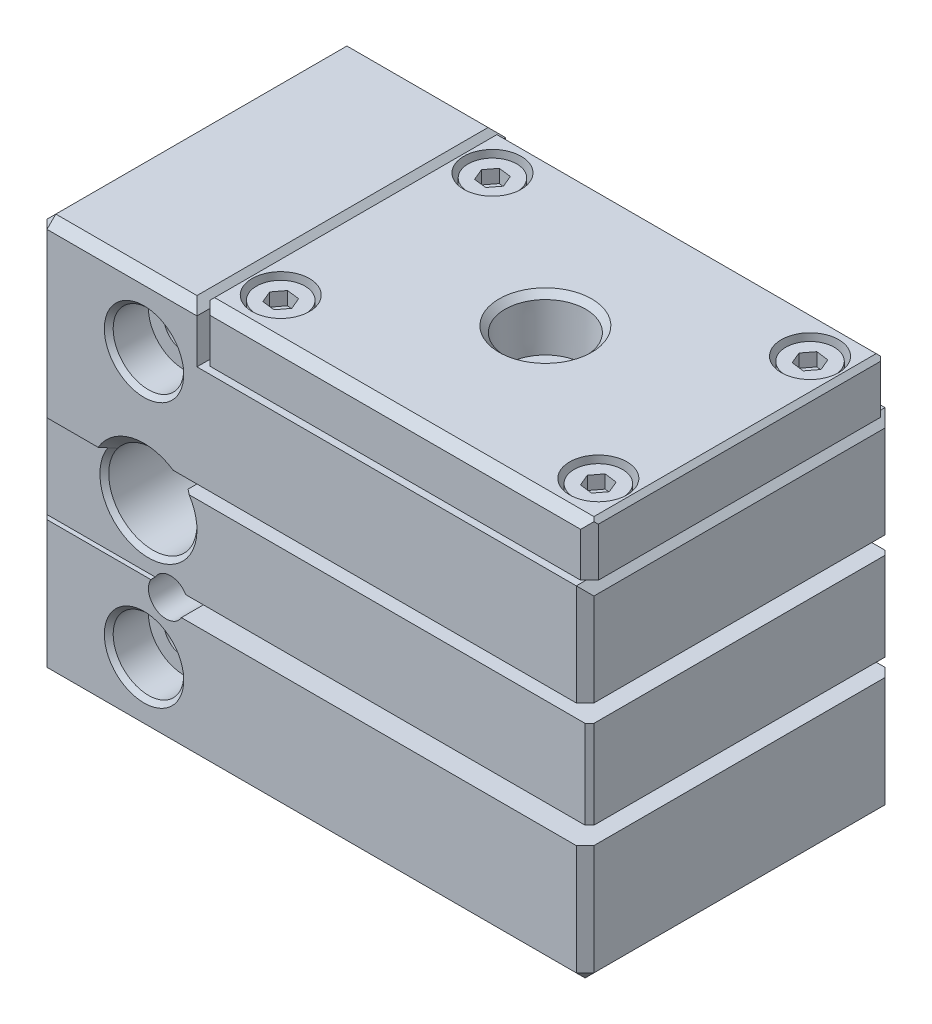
ISO-10303-21;
HEADER;
FILE_DESCRIPTION(('STEP AP214'),'2;1');
FILE_NAME('part.step','',(''),(''),'','','');
FILE_SCHEMA(('AUTOMOTIVE_DESIGN { 1 0 10303 214 1 1 1 1 }'));
ENDSEC;
DATA;
#1=APPLICATION_CONTEXT('core data for automotive mechanical design processes');
#2=APPLICATION_PROTOCOL_DEFINITION('international standard','automotive_design',2000,#1);
#3=PRODUCT_CONTEXT('',#1,'mechanical');
#4=PRODUCT('Part','Part','',(#3));
#5=PRODUCT_RELATED_PRODUCT_CATEGORY('part','',(#4));
#6=PRODUCT_DEFINITION_FORMATION('','',#4);
#7=PRODUCT_DEFINITION_CONTEXT('part definition',#1,'design');
#8=PRODUCT_DEFINITION('design','',#6,#7);
#9=PRODUCT_DEFINITION_SHAPE('','',#8);
#10=(LENGTH_UNIT() NAMED_UNIT(*) SI_UNIT(.MILLI.,.METRE.));
#11=(NAMED_UNIT(*) PLANE_ANGLE_UNIT() SI_UNIT($,.RADIAN.));
#12=(NAMED_UNIT(*) SI_UNIT($,.STERADIAN.) SOLID_ANGLE_UNIT());
#13=UNCERTAINTY_MEASURE_WITH_UNIT(LENGTH_MEASURE(1.E-05),#10,'distance_accuracy_value','');
#14=(GEOMETRIC_REPRESENTATION_CONTEXT(3) GLOBAL_UNCERTAINTY_ASSIGNED_CONTEXT((#13)) GLOBAL_UNIT_ASSIGNED_CONTEXT((#10,
#11,#12)) REPRESENTATION_CONTEXT('',''));
#15=CARTESIAN_POINT('',(0.,0.,0.));
#16=DIRECTION('',(0.,0.,1.));
#17=DIRECTION('',(1.,0.,0.));
#18=AXIS2_PLACEMENT_3D('',#15,#16,#17);
#19=CARTESIAN_POINT('',(47.4318961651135,35.8,29.6816774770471));
#20=DIRECTION('',(-0.796202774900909,0.,-0.605029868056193));
#21=DIRECTION('',(-0.605029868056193,0.,0.796202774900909));
#22=AXIS2_PLACEMENT_3D('',#19,#20,#21);
#23=PLANE('',#22);
#24=DIRECTION('',(0.,1.,0.));
#25=VECTOR('',#24,1.);
#26=CARTESIAN_POINT('',(46.5586107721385,35.8,30.8308971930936));
#27=LINE('',#26,#25);
#28=CARTESIAN_POINT('',(46.5586107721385,35.8,30.8308971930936));
#29=VERTEX_POINT('',#28);
#30=CARTESIAN_POINT('',(46.5586107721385,37.3,30.8308971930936));
#31=VERTEX_POINT('',#30);
#32=EDGE_CURVE('E1260',#29,#31,#27,.T.);
#33=ORIENTED_EDGE('',*,*,#32,.T.);
#34=DIRECTION('',(-0.605029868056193,0.,0.796202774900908));
#35=VECTOR('',#34,1.);
#36=CARTESIAN_POINT('',(47.4318961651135,37.3,29.6816774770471));
#37=LINE('',#36,#35);
#38=CARTESIAN_POINT('',(47.4318961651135,37.3,29.6816774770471));
#39=VERTEX_POINT('',#38);
#40=EDGE_CURVE('E30',#39,#31,#37,.T.);
#41=ORIENTED_EDGE('',*,*,#40,.F.);
#42=DIRECTION('',(0.,1.,0.));
#43=VECTOR('',#42,1.);
#44=CARTESIAN_POINT('',(47.4318961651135,35.8,29.6816774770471));
#45=LINE('',#44,#43);
#46=CARTESIAN_POINT('',(47.4318961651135,35.8,29.6816774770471));
#47=VERTEX_POINT('',#46);
#48=EDGE_CURVE('E34',#47,#39,#45,.T.);
#49=ORIENTED_EDGE('',*,*,#48,.F.);
#50=DIRECTION('',(-0.605029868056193,0.,0.796202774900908));
#51=VECTOR('',#50,1.);
#52=CARTESIAN_POINT('',(47.4318961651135,35.8,29.6816774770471));
#53=LINE('',#52,#51);
#54=EDGE_CURVE('E1892',#47,#29,#53,.T.);
#55=ORIENTED_EDGE('',*,*,#54,.T.);
#56=EDGE_LOOP('',(#33,#41,#49,#55));
#57=FACE_BOUND('',#56,.T.);
#58=ADVANCED_FACE('F14',(#57),#23,.T.);
#59=CARTESIAN_POINT('',(45.1267146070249,35.8,30.6492197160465));
#60=DIRECTION('',(-0.125869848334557,0.,0.992046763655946));
#61=DIRECTION('',(0.992046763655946,0.,0.125869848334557));
#62=AXIS2_PLACEMENT_3D('',#59,#60,#61);
#63=PLANE('',#62);
#64=DIRECTION('',(0.,1.,0.));
#65=VECTOR('',#64,1.);
#66=CARTESIAN_POINT('',(45.1267146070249,35.8,30.6492197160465));
#67=LINE('',#66,#65);
#68=CARTESIAN_POINT('',(45.1267146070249,35.8,30.6492197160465));
#69=VERTEX_POINT('',#68);
#70=CARTESIAN_POINT('',(45.1267146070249,37.3,30.6492197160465));
#71=VERTEX_POINT('',#70);
#72=EDGE_CURVE('E1929',#69,#71,#67,.T.);
#73=ORIENTED_EDGE('',*,*,#72,.T.);
#74=DIRECTION('',(0.992046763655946,0.,0.125869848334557));
#75=VECTOR('',#74,1.);
#76=CARTESIAN_POINT('',(45.1267146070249,37.3,30.6492197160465));
#77=LINE('',#76,#75);
#78=EDGE_CURVE('E1902',#71,#31,#77,.T.);
#79=ORIENTED_EDGE('',*,*,#78,.T.);
#80=ORIENTED_EDGE('',*,*,#32,.F.);
#81=DIRECTION('',(0.992046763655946,0.,0.125869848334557));
#82=VECTOR('',#81,1.);
#83=CARTESIAN_POINT('',(45.1267146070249,35.8,30.6492197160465));
#84=LINE('',#83,#82);
#85=EDGE_CURVE('E1918',#69,#29,#84,.T.);
#86=ORIENTED_EDGE('',*,*,#85,.F.);
#87=EDGE_LOOP('',(#73,#79,#80,#86));
#88=FACE_BOUND('',#87,.T.);
#89=ADVANCED_FACE('F1199',(#88),#63,.F.);
#90=CARTESIAN_POINT('',(44.5681038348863,35.8,29.3183225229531));
#91=DIRECTION('',(-0.922072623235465,0.,0.387016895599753));
#92=DIRECTION('',(0.387016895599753,0.,0.922072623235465));
#93=AXIS2_PLACEMENT_3D('',#90,#91,#92);
#94=PLANE('',#93);
#95=DIRECTION('',(0.,1.,0.));
#96=VECTOR('',#95,1.);
#97=CARTESIAN_POINT('',(44.5681038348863,35.8,29.3183225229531));
#98=LINE('',#97,#96);
#99=CARTESIAN_POINT('',(44.5681038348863,35.8,29.3183225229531));
#100=VERTEX_POINT('',#99);
#101=CARTESIAN_POINT('',(44.5681038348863,37.3,29.3183225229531));
#102=VERTEX_POINT('',#101);
#103=EDGE_CURVE('E1927',#100,#102,#98,.T.);
#104=ORIENTED_EDGE('',*,*,#103,.T.);
#105=DIRECTION('',(0.387016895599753,0.,0.922072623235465));
#106=VECTOR('',#105,1.);
#107=CARTESIAN_POINT('',(44.5681038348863,37.3,29.3183225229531));
#108=LINE('',#107,#106);
#109=EDGE_CURVE('E1899',#102,#71,#108,.T.);
#110=ORIENTED_EDGE('',*,*,#109,.T.);
#111=ORIENTED_EDGE('',*,*,#72,.F.);
#112=DIRECTION('',(0.387016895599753,0.,0.922072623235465));
#113=VECTOR('',#112,1.);
#114=CARTESIAN_POINT('',(44.5681038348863,35.8,29.3183225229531));
#115=LINE('',#114,#113);
#116=EDGE_CURVE('E1915',#100,#69,#115,.T.);
#117=ORIENTED_EDGE('',*,*,#116,.F.);
#118=EDGE_LOOP('',(#104,#110,#111,#117));
#119=FACE_BOUND('',#118,.T.);
#120=ADVANCED_FACE('F1204',(#119),#94,.F.);
#121=CARTESIAN_POINT('',(44.5681038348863,35.8,29.3183225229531));
#122=DIRECTION('',(0.796202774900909,0.,0.605029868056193));
#123=DIRECTION('',(0.605029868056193,0.,-0.796202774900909));
#124=AXIS2_PLACEMENT_3D('',#121,#122,#123);
#125=PLANE('',#124);
#126=DIRECTION('',(0.,1.,0.));
#127=VECTOR('',#126,1.);
#128=CARTESIAN_POINT('',(45.4413892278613,35.8,28.1691028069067));
#129=LINE('',#128,#127);
#130=CARTESIAN_POINT('',(45.4413892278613,35.8,28.1691028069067));
#131=VERTEX_POINT('',#130);
#132=CARTESIAN_POINT('',(45.4413892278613,37.3,28.1691028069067));
#133=VERTEX_POINT('',#132);
#134=EDGE_CURVE('E1925',#131,#133,#129,.T.);
#135=ORIENTED_EDGE('',*,*,#134,.T.);
#136=DIRECTION('',(0.605029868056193,0.,-0.796202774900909));
#137=VECTOR('',#136,1.);
#138=CARTESIAN_POINT('',(44.5681038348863,37.3,29.3183225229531));
#139=LINE('',#138,#137);
#140=EDGE_CURVE('E1896',#102,#133,#139,.T.);
#141=ORIENTED_EDGE('',*,*,#140,.F.);
#142=ORIENTED_EDGE('',*,*,#103,.F.);
#143=DIRECTION('',(0.605029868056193,0.,-0.796202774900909));
#144=VECTOR('',#143,1.);
#145=CARTESIAN_POINT('',(44.5681038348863,35.8,29.3183225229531));
#146=LINE('',#145,#144);
#147=EDGE_CURVE('E1912',#100,#131,#146,.T.);
#148=ORIENTED_EDGE('',*,*,#147,.T.);
#149=EDGE_LOOP('',(#135,#141,#142,#148));
#150=FACE_BOUND('',#149,.T.);
#151=ADVANCED_FACE('F1218',(#150),#125,.T.);
#152=CARTESIAN_POINT('',(46.8732853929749,35.8,28.3507802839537));
#153=DIRECTION('',(0.125869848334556,0.,-0.992046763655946));
#154=DIRECTION('',(-0.992046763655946,0.,-0.125869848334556));
#155=AXIS2_PLACEMENT_3D('',#152,#153,#154);
#156=PLANE('',#155);
#157=DIRECTION('',(0.,1.,0.));
#158=VECTOR('',#157,1.);
#159=CARTESIAN_POINT('',(46.8732853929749,35.8,28.3507802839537));
#160=LINE('',#159,#158);
#161=CARTESIAN_POINT('',(46.8732853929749,35.8,28.3507802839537));
#162=VERTEX_POINT('',#161);
#163=CARTESIAN_POINT('',(46.8732853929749,37.3,28.3507802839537));
#164=VERTEX_POINT('',#163);
#165=EDGE_CURVE('E1923',#162,#164,#160,.T.);
#166=ORIENTED_EDGE('',*,*,#165,.T.);
#167=DIRECTION('',(-0.992046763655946,0.,-0.125869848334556));
#168=VECTOR('',#167,1.);
#169=CARTESIAN_POINT('',(46.8732853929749,37.3,28.3507802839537));
#170=LINE('',#169,#168);
#171=EDGE_CURVE('E1893',#164,#133,#170,.T.);
#172=ORIENTED_EDGE('',*,*,#171,.T.);
#173=ORIENTED_EDGE('',*,*,#134,.F.);
#174=DIRECTION('',(-0.992046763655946,0.,-0.125869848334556));
#175=VECTOR('',#174,1.);
#176=CARTESIAN_POINT('',(46.8732853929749,35.8,28.3507802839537));
#177=LINE('',#176,#175);
#178=EDGE_CURVE('E1909',#162,#131,#177,.T.);
#179=ORIENTED_EDGE('',*,*,#178,.F.);
#180=EDGE_LOOP('',(#166,#172,#173,#179));
#181=FACE_BOUND('',#180,.T.);
#182=ADVANCED_FACE('F1214',(#181),#156,.F.);
#183=CARTESIAN_POINT('',(47.4318961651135,35.8,29.6816774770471));
#184=DIRECTION('',(0.922072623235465,0.,-0.387016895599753));
#185=DIRECTION('',(-0.387016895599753,0.,-0.922072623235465));
#186=AXIS2_PLACEMENT_3D('',#183,#184,#185);
#187=PLANE('',#186);
#188=DIRECTION('',(-0.387016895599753,0.,-0.922072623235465));
#189=VECTOR('',#188,1.);
#190=CARTESIAN_POINT('',(47.4318961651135,35.8,29.6816774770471));
#191=LINE('',#190,#189);
#192=EDGE_CURVE('E1906',#47,#162,#191,.T.);
#193=ORIENTED_EDGE('',*,*,#192,.F.);
#194=ORIENTED_EDGE('',*,*,#48,.T.);
#195=DIRECTION('',(-0.387016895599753,0.,-0.922072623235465));
#196=VECTOR('',#195,1.);
#197=CARTESIAN_POINT('',(47.4318961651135,37.3,29.6816774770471));
#198=LINE('',#197,#196);
#199=EDGE_CURVE('E1889',#39,#164,#198,.T.);
#200=ORIENTED_EDGE('',*,*,#199,.T.);
#201=ORIENTED_EDGE('',*,*,#165,.F.);
#202=EDGE_LOOP('',(#193,#194,#200,#201));
#203=FACE_BOUND('',#202,.T.);
#204=ADVANCED_FACE('F1211',(#203),#187,.F.);
#205=CARTESIAN_POINT('',(46.5586107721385,35.8,30.8308971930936));
#206=DIRECTION('',(0.,1.,0.));
#207=DIRECTION('',(-0.125869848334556,0.,0.992046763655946));
#208=AXIS2_PLACEMENT_3D('',#205,#206,#207);
#209=PLANE('',#208);
#210=ORIENTED_EDGE('',*,*,#54,.F.);
#211=ORIENTED_EDGE('',*,*,#192,.T.);
#212=ORIENTED_EDGE('',*,*,#178,.T.);
#213=ORIENTED_EDGE('',*,*,#147,.F.);
#214=ORIENTED_EDGE('',*,*,#116,.T.);
#215=ORIENTED_EDGE('',*,*,#85,.T.);
#216=EDGE_LOOP('',(#210,#211,#212,#213,#214,#215));
#217=FACE_BOUND('',#216,.T.);
#218=ADVANCED_FACE('F1209',(#217),#209,.T.);
#219=CARTESIAN_POINT('',(46.,37.3,29.5));
#220=DIRECTION('',(0.,1.,0.));
#221=DIRECTION('',(-0.125869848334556,0.,0.992046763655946));
#222=AXIS2_PLACEMENT_3D('',#219,#220,#221);
#223=PLANE('',#222);
#224=CARTESIAN_POINT('',(46.,37.3,29.5));
#225=DIRECTION('',(0.,1.,0.));
#226=DIRECTION('',(-0.125869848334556,0.,0.992046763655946));
#227=AXIS2_PLACEMENT_3D('',#224,#225,#226);
#228=CIRCLE('',#227,2.75);
#229=CARTESIAN_POINT('',(45.65385791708,37.3,32.2281286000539));
#230=VERTEX_POINT('',#229);
#231=EDGE_CURVE('E1252',#230,#230,#228,.T.);
#232=ORIENTED_EDGE('',*,*,#231,.T.);
#233=EDGE_LOOP('',(#232));
#234=FACE_BOUND('',#233,.T.);
#235=ORIENTED_EDGE('',*,*,#199,.F.);
#236=ORIENTED_EDGE('',*,*,#40,.T.);
#237=ORIENTED_EDGE('',*,*,#78,.F.);
#238=ORIENTED_EDGE('',*,*,#109,.F.);
#239=ORIENTED_EDGE('',*,*,#140,.T.);
#240=ORIENTED_EDGE('',*,*,#171,.F.);
#241=EDGE_LOOP('',(#235,#236,#237,#238,#239,#240));
#242=FACE_BOUND('',#241,.T.);
#243=ADVANCED_FACE('F16',(#234,#242),#223,.T.);
#244=CARTESIAN_POINT('',(46.,48.3,29.5));
#245=DIRECTION('',(0.,1.,0.));
#246=DIRECTION('',(-0.125869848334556,0.,0.992046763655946));
#247=AXIS2_PLACEMENT_3D('',#244,#245,#246);
#248=CYLINDRICAL_SURFACE('',#247,2.75);
#249=CARTESIAN_POINT('',(46.,34.3,29.5));
#250=DIRECTION('',(0.,-1.,0.));
#251=DIRECTION('',(0.,0.,1.));
#252=AXIS2_PLACEMENT_3D('',#249,#250,#251);
#253=CIRCLE('',#252,2.75);
#254=CARTESIAN_POINT('',(46.,34.3,32.25));
#255=VERTEX_POINT('',#254);
#256=EDGE_CURVE('E1249',#255,#255,#253,.F.);
#257=ORIENTED_EDGE('',*,*,#256,.T.);
#258=EDGE_LOOP('',(#257));
#259=FACE_BOUND('',#258,.T.);
#260=ORIENTED_EDGE('',*,*,#231,.F.);
#261=EDGE_LOOP('',(#260));
#262=FACE_BOUND('',#261,.T.);
#263=ADVANCED_FACE('F1234',(#259,#262),#248,.T.);
#264=CARTESIAN_POINT('',(47.4318961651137,35.8,5.68167747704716));
#265=DIRECTION('',(-0.796202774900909,0.,-0.605029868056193));
#266=DIRECTION('',(-0.605029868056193,0.,0.796202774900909));
#267=AXIS2_PLACEMENT_3D('',#264,#265,#266);
#268=PLANE('',#267);
#269=DIRECTION('',(0.,1.,0.));
#270=VECTOR('',#269,1.);
#271=CARTESIAN_POINT('',(46.5586107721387,35.8,6.83089719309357));
#272=LINE('',#271,#270);
#273=CARTESIAN_POINT('',(46.5586107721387,35.8,6.83089719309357));
#274=VERTEX_POINT('',#273);
#275=CARTESIAN_POINT('',(46.5586107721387,37.3,6.83089719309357));
#276=VERTEX_POINT('',#275);
#277=EDGE_CURVE('E1880',#274,#276,#272,.T.);
#278=ORIENTED_EDGE('',*,*,#277,.T.);
#279=DIRECTION('',(-0.605029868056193,0.,0.796202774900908));
#280=VECTOR('',#279,1.);
#281=CARTESIAN_POINT('',(47.4318961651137,37.3,5.68167747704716));
#282=LINE('',#281,#280);
#283=CARTESIAN_POINT('',(47.4318961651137,37.3,5.68167747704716));
#284=VERTEX_POINT('',#283);
#285=EDGE_CURVE('E1833',#284,#276,#282,.T.);
#286=ORIENTED_EDGE('',*,*,#285,.F.);
#287=DIRECTION('',(0.,1.,0.));
#288=VECTOR('',#287,1.);
#289=CARTESIAN_POINT('',(47.4318961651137,35.8,5.68167747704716));
#290=LINE('',#289,#288);
#291=CARTESIAN_POINT('',(47.4318961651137,35.8,5.68167747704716));
#292=VERTEX_POINT('',#291);
#293=EDGE_CURVE('E1855',#292,#284,#290,.T.);
#294=ORIENTED_EDGE('',*,*,#293,.F.);
#295=DIRECTION('',(-0.605029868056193,0.,0.796202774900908));
#296=VECTOR('',#295,1.);
#297=CARTESIAN_POINT('',(47.4318961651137,35.8,5.68167747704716));
#298=LINE('',#297,#296);
#299=EDGE_CURVE('E1837',#292,#274,#298,.T.);
#300=ORIENTED_EDGE('',*,*,#299,.T.);
#301=EDGE_LOOP('',(#278,#286,#294,#300));
#302=FACE_BOUND('',#301,.T.);
#303=ADVANCED_FACE('F1236',(#302),#268,.T.);
#304=CARTESIAN_POINT('',(45.126714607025,35.8,6.64921971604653));
#305=DIRECTION('',(-0.125869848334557,0.,0.992046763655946));
#306=DIRECTION('',(0.992046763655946,0.,0.125869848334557));
#307=AXIS2_PLACEMENT_3D('',#304,#305,#306);
#308=PLANE('',#307);
#309=DIRECTION('',(0.,1.,0.));
#310=VECTOR('',#309,1.);
#311=CARTESIAN_POINT('',(45.126714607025,35.8,6.64921971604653));
#312=LINE('',#311,#310);
#313=CARTESIAN_POINT('',(45.126714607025,35.8,6.64921971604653));
#314=VERTEX_POINT('',#313);
#315=CARTESIAN_POINT('',(45.126714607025,37.3,6.64921971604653));
#316=VERTEX_POINT('',#315);
#317=EDGE_CURVE('E1878',#314,#316,#312,.T.);
#318=ORIENTED_EDGE('',*,*,#317,.T.);
#319=DIRECTION('',(0.992046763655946,0.,0.125869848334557));
#320=VECTOR('',#319,1.);
#321=CARTESIAN_POINT('',(45.126714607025,37.3,6.64921971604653));
#322=LINE('',#321,#320);
#323=EDGE_CURVE('E1847',#316,#276,#322,.T.);
#324=ORIENTED_EDGE('',*,*,#323,.T.);
#325=ORIENTED_EDGE('',*,*,#277,.F.);
#326=DIRECTION('',(0.992046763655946,0.,0.125869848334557));
#327=VECTOR('',#326,1.);
#328=CARTESIAN_POINT('',(45.126714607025,35.8,6.64921971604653));
#329=LINE('',#328,#327);
#330=EDGE_CURVE('E1865',#314,#274,#329,.T.);
#331=ORIENTED_EDGE('',*,*,#330,.F.);
#332=EDGE_LOOP('',(#318,#324,#325,#331));
#333=FACE_BOUND('',#332,.T.);
#334=ADVANCED_FACE('F1242',(#333),#308,.F.);
#335=CARTESIAN_POINT('',(44.5681038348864,35.8,5.31832252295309));
#336=DIRECTION('',(-0.922072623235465,0.,0.387016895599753));
#337=DIRECTION('',(0.387016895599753,0.,0.922072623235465));
#338=AXIS2_PLACEMENT_3D('',#335,#336,#337);
#339=PLANE('',#338);
#340=DIRECTION('',(0.,1.,0.));
#341=VECTOR('',#340,1.);
#342=CARTESIAN_POINT('',(44.5681038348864,35.8,5.31832252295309));
#343=LINE('',#342,#341);
#344=CARTESIAN_POINT('',(44.5681038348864,35.8,5.31832252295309));
#345=VERTEX_POINT('',#344);
#346=CARTESIAN_POINT('',(44.5681038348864,37.3,5.31832252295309));
#347=VERTEX_POINT('',#346);
#348=EDGE_CURVE('E1876',#345,#347,#343,.T.);
#349=ORIENTED_EDGE('',*,*,#348,.T.);
#350=DIRECTION('',(0.387016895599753,0.,0.922072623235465));
#351=VECTOR('',#350,1.);
#352=CARTESIAN_POINT('',(44.5681038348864,37.3,5.31832252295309));
#353=LINE('',#352,#351);
#354=EDGE_CURVE('E1844',#347,#316,#353,.T.);
#355=ORIENTED_EDGE('',*,*,#354,.T.);
#356=ORIENTED_EDGE('',*,*,#317,.F.);
#357=DIRECTION('',(0.387016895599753,0.,0.922072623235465));
#358=VECTOR('',#357,1.);
#359=CARTESIAN_POINT('',(44.5681038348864,35.8,5.31832252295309));
#360=LINE('',#359,#358);
#361=EDGE_CURVE('E1862',#345,#314,#360,.T.);
#362=ORIENTED_EDGE('',*,*,#361,.F.);
#363=EDGE_LOOP('',(#349,#355,#356,#362));
#364=FACE_BOUND('',#363,.T.);
#365=ADVANCED_FACE('F1979',(#364),#339,.F.);
#366=CARTESIAN_POINT('',(44.5681038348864,35.8,5.31832252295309));
#367=DIRECTION('',(0.796202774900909,0.,0.605029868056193));
#368=DIRECTION('',(0.605029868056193,0.,-0.796202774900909));
#369=AXIS2_PLACEMENT_3D('',#366,#367,#368);
#370=PLANE('',#369);
#371=DIRECTION('',(0.,1.,0.));
#372=VECTOR('',#371,1.);
#373=CARTESIAN_POINT('',(45.4413892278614,35.8,4.16910280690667));
#374=LINE('',#373,#372);
#375=CARTESIAN_POINT('',(45.4413892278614,35.8,4.16910280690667));
#376=VERTEX_POINT('',#375);
#377=CARTESIAN_POINT('',(45.4413892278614,37.3,4.16910280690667));
#378=VERTEX_POINT('',#377);
#379=EDGE_CURVE('E1874',#376,#378,#374,.T.);
#380=ORIENTED_EDGE('',*,*,#379,.T.);
#381=DIRECTION('',(0.605029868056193,0.,-0.796202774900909));
#382=VECTOR('',#381,1.);
#383=CARTESIAN_POINT('',(44.5681038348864,37.3,5.31832252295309));
#384=LINE('',#383,#382);
#385=EDGE_CURVE('E1841',#347,#378,#384,.T.);
#386=ORIENTED_EDGE('',*,*,#385,.F.);
#387=ORIENTED_EDGE('',*,*,#348,.F.);
#388=DIRECTION('',(0.605029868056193,0.,-0.796202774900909));
#389=VECTOR('',#388,1.);
#390=CARTESIAN_POINT('',(44.5681038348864,35.8,5.31832252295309));
#391=LINE('',#390,#389);
#392=EDGE_CURVE('E1859',#345,#376,#391,.T.);
#393=ORIENTED_EDGE('',*,*,#392,.T.);
#394=EDGE_LOOP('',(#380,#386,#387,#393));
#395=FACE_BOUND('',#394,.T.);
#396=ADVANCED_FACE('F1989',(#395),#370,.T.);
#397=CARTESIAN_POINT('',(46.8732853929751,35.8,4.35078028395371));
#398=DIRECTION('',(0.125869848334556,0.,-0.992046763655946));
#399=DIRECTION('',(-0.992046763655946,0.,-0.125869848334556));
#400=AXIS2_PLACEMENT_3D('',#397,#398,#399);
#401=PLANE('',#400);
#402=DIRECTION('',(0.,1.,0.));
#403=VECTOR('',#402,1.);
#404=CARTESIAN_POINT('',(46.8732853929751,35.8,4.35078028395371));
#405=LINE('',#404,#403);
#406=CARTESIAN_POINT('',(46.8732853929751,35.8,4.35078028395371));
#407=VERTEX_POINT('',#406);
#408=CARTESIAN_POINT('',(46.8732853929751,37.3,4.35078028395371));
#409=VERTEX_POINT('',#408);
#410=EDGE_CURVE('E1872',#407,#409,#405,.T.);
#411=ORIENTED_EDGE('',*,*,#410,.T.);
#412=DIRECTION('',(-0.992046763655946,0.,-0.125869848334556));
#413=VECTOR('',#412,1.);
#414=CARTESIAN_POINT('',(46.8732853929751,37.3,4.35078028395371));
#415=LINE('',#414,#413);
#416=EDGE_CURVE('E1838',#409,#378,#415,.T.);
#417=ORIENTED_EDGE('',*,*,#416,.T.);
#418=ORIENTED_EDGE('',*,*,#379,.F.);
#419=DIRECTION('',(-0.992046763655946,0.,-0.125869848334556));
#420=VECTOR('',#419,1.);
#421=CARTESIAN_POINT('',(46.8732853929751,35.8,4.35078028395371));
#422=LINE('',#421,#420);
#423=EDGE_CURVE('E1856',#407,#376,#422,.T.);
#424=ORIENTED_EDGE('',*,*,#423,.F.);
#425=EDGE_LOOP('',(#411,#417,#418,#424));
#426=FACE_BOUND('',#425,.T.);
#427=ADVANCED_FACE('F2000',(#426),#401,.F.);
#428=CARTESIAN_POINT('',(47.4318961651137,35.8,5.68167747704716));
#429=DIRECTION('',(0.922072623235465,0.,-0.387016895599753));
#430=DIRECTION('',(-0.387016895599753,0.,-0.922072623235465));
#431=AXIS2_PLACEMENT_3D('',#428,#429,#430);
#432=PLANE('',#431);
#433=DIRECTION('',(-0.387016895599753,0.,-0.922072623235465));
#434=VECTOR('',#433,1.);
#435=CARTESIAN_POINT('',(47.4318961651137,35.8,5.68167747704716));
#436=LINE('',#435,#434);
#437=EDGE_CURVE('E1852',#292,#407,#436,.T.);
#438=ORIENTED_EDGE('',*,*,#437,.F.);
#439=ORIENTED_EDGE('',*,*,#293,.T.);
#440=DIRECTION('',(-0.387016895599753,0.,-0.922072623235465));
#441=VECTOR('',#440,1.);
#442=CARTESIAN_POINT('',(47.4318961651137,37.3,5.68167747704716));
#443=LINE('',#442,#441);
#444=EDGE_CURVE('E1834',#284,#409,#443,.T.);
#445=ORIENTED_EDGE('',*,*,#444,.T.);
#446=ORIENTED_EDGE('',*,*,#410,.F.);
#447=EDGE_LOOP('',(#438,#439,#445,#446));
#448=FACE_BOUND('',#447,.T.);
#449=ADVANCED_FACE('F2012',(#448),#432,.F.);
#450=CARTESIAN_POINT('',(46.5586107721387,35.8,6.83089719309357));
#451=DIRECTION('',(0.,1.,0.));
#452=DIRECTION('',(-0.125869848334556,0.,0.992046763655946));
#453=AXIS2_PLACEMENT_3D('',#450,#451,#452);
#454=PLANE('',#453);
#455=ORIENTED_EDGE('',*,*,#299,.F.);
#456=ORIENTED_EDGE('',*,*,#437,.T.);
#457=ORIENTED_EDGE('',*,*,#423,.T.);
#458=ORIENTED_EDGE('',*,*,#392,.F.);
#459=ORIENTED_EDGE('',*,*,#361,.T.);
#460=ORIENTED_EDGE('',*,*,#330,.T.);
#461=EDGE_LOOP('',(#455,#456,#457,#458,#459,#460));
#462=FACE_BOUND('',#461,.T.);
#463=ADVANCED_FACE('F2015',(#462),#454,.T.);
#464=CARTESIAN_POINT('',(46.,37.3,5.50000000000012));
#465=DIRECTION('',(0.,1.,0.));
#466=DIRECTION('',(-0.125869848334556,0.,0.992046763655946));
#467=AXIS2_PLACEMENT_3D('',#464,#465,#466);
#468=PLANE('',#467);
#469=CARTESIAN_POINT('',(46.,37.3,5.50000000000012));
#470=DIRECTION('',(0.,1.,0.));
#471=DIRECTION('',(-0.125869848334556,0.,0.992046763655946));
#472=AXIS2_PLACEMENT_3D('',#469,#470,#471);
#473=CIRCLE('',#472,2.75);
#474=CARTESIAN_POINT('',(45.65385791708,37.3,8.22812860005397));
#475=VERTEX_POINT('',#474);
#476=EDGE_CURVE('E1885',#475,#475,#473,.T.);
#477=ORIENTED_EDGE('',*,*,#476,.T.);
#478=EDGE_LOOP('',(#477));
#479=FACE_BOUND('',#478,.T.);
#480=ORIENTED_EDGE('',*,*,#444,.F.);
#481=ORIENTED_EDGE('',*,*,#285,.T.);
#482=ORIENTED_EDGE('',*,*,#323,.F.);
#483=ORIENTED_EDGE('',*,*,#354,.F.);
#484=ORIENTED_EDGE('',*,*,#385,.T.);
#485=ORIENTED_EDGE('',*,*,#416,.F.);
#486=EDGE_LOOP('',(#480,#481,#482,#483,#484,#485));
#487=FACE_BOUND('',#486,.T.);
#488=ADVANCED_FACE('F2025',(#479,#487),#468,.T.);
#489=CARTESIAN_POINT('',(46.,48.3,5.50000000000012));
#490=DIRECTION('',(0.,1.,0.));
#491=DIRECTION('',(-0.125869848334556,0.,0.992046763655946));
#492=AXIS2_PLACEMENT_3D('',#489,#490,#491);
#493=CYLINDRICAL_SURFACE('',#492,2.75);
#494=CARTESIAN_POINT('',(46.,34.3,5.50000000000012));
#495=DIRECTION('',(0.,-1.,0.));
#496=DIRECTION('',(0.,0.,1.));
#497=AXIS2_PLACEMENT_3D('',#494,#495,#496);
#498=CIRCLE('',#497,2.75);
#499=CARTESIAN_POINT('',(46.,34.3,8.25000000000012));
#500=VERTEX_POINT('',#499);
#501=EDGE_CURVE('E1830',#500,#500,#498,.F.);
#502=ORIENTED_EDGE('',*,*,#501,.T.);
#503=EDGE_LOOP('',(#502));
#504=FACE_BOUND('',#503,.T.);
#505=ORIENTED_EDGE('',*,*,#476,.F.);
#506=EDGE_LOOP('',(#505));
#507=FACE_BOUND('',#506,.T.);
#508=ADVANCED_FACE('F2041',(#504,#507),#493,.T.);
#509=CARTESIAN_POINT('',(8.56810383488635,35.8,5.31832252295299));
#510=DIRECTION('',(0.796202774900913,0.,0.605029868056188));
#511=DIRECTION('',(0.605029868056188,0.,-0.796202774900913));
#512=AXIS2_PLACEMENT_3D('',#509,#510,#511);
#513=PLANE('',#512);
#514=DIRECTION('',(0.,1.,0.));
#515=VECTOR('',#514,1.);
#516=CARTESIAN_POINT('',(9.44138922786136,35.8,4.16910280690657));
#517=LINE('',#516,#515);
#518=CARTESIAN_POINT('',(9.44138922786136,35.8,4.16910280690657));
#519=VERTEX_POINT('',#518);
#520=CARTESIAN_POINT('',(9.44138922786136,37.3,4.16910280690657));
#521=VERTEX_POINT('',#520);
#522=EDGE_CURVE('E1822',#519,#521,#517,.T.);
#523=ORIENTED_EDGE('',*,*,#522,.T.);
#524=DIRECTION('',(0.605029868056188,0.,-0.796202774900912));
#525=VECTOR('',#524,1.);
#526=CARTESIAN_POINT('',(8.56810383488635,37.3,5.31832252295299));
#527=LINE('',#526,#525);
#528=CARTESIAN_POINT('',(8.56810383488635,37.3,5.31832252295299));
#529=VERTEX_POINT('',#528);
#530=EDGE_CURVE('E1775',#529,#521,#527,.T.);
#531=ORIENTED_EDGE('',*,*,#530,.F.);
#532=DIRECTION('',(0.,1.,0.));
#533=VECTOR('',#532,1.);
#534=CARTESIAN_POINT('',(8.56810383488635,35.8,5.31832252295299));
#535=LINE('',#534,#533);
#536=CARTESIAN_POINT('',(8.56810383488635,35.8,5.31832252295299));
#537=VERTEX_POINT('',#536);
#538=EDGE_CURVE('E1797',#537,#529,#535,.T.);
#539=ORIENTED_EDGE('',*,*,#538,.F.);
#540=DIRECTION('',(0.605029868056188,0.,-0.796202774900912));
#541=VECTOR('',#540,1.);
#542=CARTESIAN_POINT('',(8.56810383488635,35.8,5.31832252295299));
#543=LINE('',#542,#541);
#544=EDGE_CURVE('E1779',#537,#519,#543,.T.);
#545=ORIENTED_EDGE('',*,*,#544,.T.);
#546=EDGE_LOOP('',(#523,#531,#539,#545));
#547=FACE_BOUND('',#546,.T.);
#548=ADVANCED_FACE('F2050',(#547),#513,.T.);
#549=CARTESIAN_POINT('',(10.873285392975,35.8,4.3507802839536));
#550=DIRECTION('',(0.12586984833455,0.,-0.992046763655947));
#551=DIRECTION('',(-0.992046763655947,0.,-0.12586984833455));
#552=AXIS2_PLACEMENT_3D('',#549,#550,#551);
#553=PLANE('',#552);
#554=DIRECTION('',(0.,1.,0.));
#555=VECTOR('',#554,1.);
#556=CARTESIAN_POINT('',(10.873285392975,35.8,4.3507802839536));
#557=LINE('',#556,#555);
#558=CARTESIAN_POINT('',(10.873285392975,35.8,4.3507802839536));
#559=VERTEX_POINT('',#558);
#560=CARTESIAN_POINT('',(10.873285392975,37.3,4.3507802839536));
#561=VERTEX_POINT('',#560);
#562=EDGE_CURVE('E1820',#559,#561,#557,.T.);
#563=ORIENTED_EDGE('',*,*,#562,.T.);
#564=DIRECTION('',(-0.992046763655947,0.,-0.12586984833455));
#565=VECTOR('',#564,1.);
#566=CARTESIAN_POINT('',(10.873285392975,37.3,4.3507802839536));
#567=LINE('',#566,#565);
#568=EDGE_CURVE('E1789',#561,#521,#567,.T.);
#569=ORIENTED_EDGE('',*,*,#568,.T.);
#570=ORIENTED_EDGE('',*,*,#522,.F.);
#571=DIRECTION('',(-0.992046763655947,0.,-0.12586984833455));
#572=VECTOR('',#571,1.);
#573=CARTESIAN_POINT('',(10.873285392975,35.8,4.3507802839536));
#574=LINE('',#573,#572);
#575=EDGE_CURVE('E1807',#559,#519,#574,.T.);
#576=ORIENTED_EDGE('',*,*,#575,.F.);
#577=EDGE_LOOP('',(#563,#569,#570,#576));
#578=FACE_BOUND('',#577,.T.);
#579=ADVANCED_FACE('F2061',(#578),#553,.F.);
#580=CARTESIAN_POINT('',(11.4318961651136,35.8,5.68167747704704));
#581=DIRECTION('',(0.922072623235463,0.,-0.387016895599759));
#582=DIRECTION('',(-0.387016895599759,0.,-0.922072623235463));
#583=AXIS2_PLACEMENT_3D('',#580,#581,#582);
#584=PLANE('',#583);
#585=DIRECTION('',(0.,1.,0.));
#586=VECTOR('',#585,1.);
#587=CARTESIAN_POINT('',(11.4318961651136,35.8,5.68167747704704));
#588=LINE('',#587,#586);
#589=CARTESIAN_POINT('',(11.4318961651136,35.8,5.68167747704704));
#590=VERTEX_POINT('',#589);
#591=CARTESIAN_POINT('',(11.4318961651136,37.3,5.68167747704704));
#592=VERTEX_POINT('',#591);
#593=EDGE_CURVE('E1818',#590,#592,#588,.T.);
#594=ORIENTED_EDGE('',*,*,#593,.T.);
#595=DIRECTION('',(-0.387016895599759,0.,-0.922072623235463));
#596=VECTOR('',#595,1.);
#597=CARTESIAN_POINT('',(11.4318961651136,37.3,5.68167747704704));
#598=LINE('',#597,#596);
#599=EDGE_CURVE('E1786',#592,#561,#598,.T.);
#600=ORIENTED_EDGE('',*,*,#599,.T.);
#601=ORIENTED_EDGE('',*,*,#562,.F.);
#602=DIRECTION('',(-0.387016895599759,0.,-0.922072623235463));
#603=VECTOR('',#602,1.);
#604=CARTESIAN_POINT('',(11.4318961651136,35.8,5.68167747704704));
#605=LINE('',#604,#603);
#606=EDGE_CURVE('E1804',#590,#559,#605,.T.);
#607=ORIENTED_EDGE('',*,*,#606,.F.);
#608=EDGE_LOOP('',(#594,#600,#601,#607));
#609=FACE_BOUND('',#608,.T.);
#610=ADVANCED_FACE('F2073',(#609),#584,.F.);
#611=CARTESIAN_POINT('',(11.4318961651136,35.8,5.68167747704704));
#612=DIRECTION('',(-0.796202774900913,0.,-0.605029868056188));
#613=DIRECTION('',(-0.605029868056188,0.,0.796202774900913));
#614=AXIS2_PLACEMENT_3D('',#611,#612,#613);
#615=PLANE('',#614);
#616=DIRECTION('',(0.,1.,0.));
#617=VECTOR('',#616,1.);
#618=CARTESIAN_POINT('',(10.5586107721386,35.8,6.83089719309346));
#619=LINE('',#618,#617);
#620=CARTESIAN_POINT('',(10.5586107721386,35.8,6.83089719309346));
#621=VERTEX_POINT('',#620);
#622=CARTESIAN_POINT('',(10.5586107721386,37.3,6.83089719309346));
#623=VERTEX_POINT('',#622);
#624=EDGE_CURVE('E1816',#621,#623,#619,.T.);
#625=ORIENTED_EDGE('',*,*,#624,.T.);
#626=DIRECTION('',(-0.605029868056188,0.,0.796202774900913));
#627=VECTOR('',#626,1.);
#628=CARTESIAN_POINT('',(11.4318961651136,37.3,5.68167747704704));
#629=LINE('',#628,#627);
#630=EDGE_CURVE('E1783',#592,#623,#629,.T.);
#631=ORIENTED_EDGE('',*,*,#630,.F.);
#632=ORIENTED_EDGE('',*,*,#593,.F.);
#633=DIRECTION('',(-0.605029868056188,0.,0.796202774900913));
#634=VECTOR('',#633,1.);
#635=CARTESIAN_POINT('',(11.4318961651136,35.8,5.68167747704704));
#636=LINE('',#635,#634);
#637=EDGE_CURVE('E1801',#590,#621,#636,.T.);
#638=ORIENTED_EDGE('',*,*,#637,.T.);
#639=EDGE_LOOP('',(#625,#631,#632,#638));
#640=FACE_BOUND('',#639,.T.);
#641=ADVANCED_FACE('F2084',(#640),#615,.T.);
#642=CARTESIAN_POINT('',(9.12671460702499,35.8,6.64921971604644));
#643=DIRECTION('',(-0.12586984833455,0.,0.992046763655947));
#644=DIRECTION('',(0.992046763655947,0.,0.12586984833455));
#645=AXIS2_PLACEMENT_3D('',#642,#643,#644);
#646=PLANE('',#645);
#647=DIRECTION('',(0.,1.,0.));
#648=VECTOR('',#647,1.);
#649=CARTESIAN_POINT('',(9.12671460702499,35.8,6.64921971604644));
#650=LINE('',#649,#648);
#651=CARTESIAN_POINT('',(9.12671460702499,35.8,6.64921971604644));
#652=VERTEX_POINT('',#651);
#653=CARTESIAN_POINT('',(9.12671460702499,37.3,6.64921971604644));
#654=VERTEX_POINT('',#653);
#655=EDGE_CURVE('E1814',#652,#654,#650,.T.);
#656=ORIENTED_EDGE('',*,*,#655,.T.);
#657=DIRECTION('',(0.992046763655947,0.,0.12586984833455));
#658=VECTOR('',#657,1.);
#659=CARTESIAN_POINT('',(9.12671460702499,37.3,6.64921971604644));
#660=LINE('',#659,#658);
#661=EDGE_CURVE('E1780',#654,#623,#660,.T.);
#662=ORIENTED_EDGE('',*,*,#661,.T.);
#663=ORIENTED_EDGE('',*,*,#624,.F.);
#664=DIRECTION('',(0.992046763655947,0.,0.12586984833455));
#665=VECTOR('',#664,1.);
#666=CARTESIAN_POINT('',(9.12671460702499,35.8,6.64921971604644));
#667=LINE('',#666,#665);
#668=EDGE_CURVE('E1798',#652,#621,#667,.T.);
#669=ORIENTED_EDGE('',*,*,#668,.F.);
#670=EDGE_LOOP('',(#656,#662,#663,#669));
#671=FACE_BOUND('',#670,.T.);
#672=ADVANCED_FACE('F2094',(#671),#646,.F.);
#673=CARTESIAN_POINT('',(8.56810383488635,35.8,5.31832252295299));
#674=DIRECTION('',(-0.922072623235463,0.,0.387016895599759));
#675=DIRECTION('',(0.387016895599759,0.,0.922072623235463));
#676=AXIS2_PLACEMENT_3D('',#673,#674,#675);
#677=PLANE('',#676);
#678=DIRECTION('',(0.387016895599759,0.,0.922072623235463));
#679=VECTOR('',#678,1.);
#680=CARTESIAN_POINT('',(8.56810383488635,35.8,5.31832252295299));
#681=LINE('',#680,#679);
#682=EDGE_CURVE('E1794',#537,#652,#681,.T.);
#683=ORIENTED_EDGE('',*,*,#682,.F.);
#684=ORIENTED_EDGE('',*,*,#538,.T.);
#685=DIRECTION('',(0.387016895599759,0.,0.922072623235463));
#686=VECTOR('',#685,1.);
#687=CARTESIAN_POINT('',(8.56810383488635,37.3,5.31832252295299));
#688=LINE('',#687,#686);
#689=EDGE_CURVE('E1776',#529,#654,#688,.T.);
#690=ORIENTED_EDGE('',*,*,#689,.T.);
#691=ORIENTED_EDGE('',*,*,#655,.F.);
#692=EDGE_LOOP('',(#683,#684,#690,#691));
#693=FACE_BOUND('',#692,.T.);
#694=ADVANCED_FACE('F2104',(#693),#677,.F.);
#695=CARTESIAN_POINT('',(9.44138922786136,35.8,4.16910280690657));
#696=DIRECTION('',(0.,1.,0.));
#697=DIRECTION('',(0.125869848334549,0.,-0.992046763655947));
#698=AXIS2_PLACEMENT_3D('',#695,#696,#697);
#699=PLANE('',#698);
#700=ORIENTED_EDGE('',*,*,#544,.F.);
#701=ORIENTED_EDGE('',*,*,#682,.T.);
#702=ORIENTED_EDGE('',*,*,#668,.T.);
#703=ORIENTED_EDGE('',*,*,#637,.F.);
#704=ORIENTED_EDGE('',*,*,#606,.T.);
#705=ORIENTED_EDGE('',*,*,#575,.T.);
#706=EDGE_LOOP('',(#700,#701,#702,#703,#704,#705));
#707=FACE_BOUND('',#706,.T.);
#708=ADVANCED_FACE('F2107',(#707),#699,.T.);
#709=CARTESIAN_POINT('',(10.,37.3,5.5));
#710=DIRECTION('',(0.,1.,0.));
#711=DIRECTION('',(0.125869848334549,0.,-0.992046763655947));
#712=AXIS2_PLACEMENT_3D('',#709,#710,#711);
#713=PLANE('',#712);
#714=CARTESIAN_POINT('',(10.,37.3,5.5));
#715=DIRECTION('',(0.,1.,0.));
#716=DIRECTION('',(0.125869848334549,0.,-0.992046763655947));
#717=AXIS2_PLACEMENT_3D('',#714,#715,#716);
#718=CIRCLE('',#717,2.75);
#719=CARTESIAN_POINT('',(10.34614208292,37.3,2.77187139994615));
#720=VERTEX_POINT('',#719);
#721=EDGE_CURVE('E1827',#720,#720,#718,.T.);
#722=ORIENTED_EDGE('',*,*,#721,.T.);
#723=EDGE_LOOP('',(#722));
#724=FACE_BOUND('',#723,.T.);
#725=ORIENTED_EDGE('',*,*,#689,.F.);
#726=ORIENTED_EDGE('',*,*,#530,.T.);
#727=ORIENTED_EDGE('',*,*,#568,.F.);
#728=ORIENTED_EDGE('',*,*,#599,.F.);
#729=ORIENTED_EDGE('',*,*,#630,.T.);
#730=ORIENTED_EDGE('',*,*,#661,.F.);
#731=EDGE_LOOP('',(#725,#726,#727,#728,#729,#730));
#732=FACE_BOUND('',#731,.T.);
#733=ADVANCED_FACE('F2116',(#724,#732),#713,.T.);
#734=CARTESIAN_POINT('',(10.,48.3,5.5));
#735=DIRECTION('',(0.,1.,0.));
#736=DIRECTION('',(0.125869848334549,0.,-0.992046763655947));
#737=AXIS2_PLACEMENT_3D('',#734,#735,#736);
#738=CYLINDRICAL_SURFACE('',#737,2.75);
#739=CARTESIAN_POINT('',(10.,34.3,5.5));
#740=DIRECTION('',(0.,-1.,0.));
#741=DIRECTION('',(0.,0.,1.));
#742=AXIS2_PLACEMENT_3D('',#739,#740,#741);
#743=CIRCLE('',#742,2.75);
#744=CARTESIAN_POINT('',(10.,34.3,8.25));
#745=VERTEX_POINT('',#744);
#746=EDGE_CURVE('E1772',#745,#745,#743,.F.);
#747=ORIENTED_EDGE('',*,*,#746,.T.);
#748=EDGE_LOOP('',(#747));
#749=FACE_BOUND('',#748,.T.);
#750=ORIENTED_EDGE('',*,*,#721,.F.);
#751=EDGE_LOOP('',(#750));
#752=FACE_BOUND('',#751,.T.);
#753=ADVANCED_FACE('F2132',(#749,#752),#738,.T.);
#754=CARTESIAN_POINT('',(28.,4.5,17.5));
#755=DIRECTION('',(0.,1.,0.));
#756=DIRECTION('',(0.,0.,1.));
#757=AXIS2_PLACEMENT_3D('',#754,#755,#756);
#758=CYLINDRICAL_SURFACE('',#757,9.5);
#759=CARTESIAN_POINT('',(28.,-7.25,17.5));
#760=DIRECTION('',(0.,-1.,0.));
#761=DIRECTION('',(0.,0.,1.));
#762=AXIS2_PLACEMENT_3D('',#759,#760,#761);
#763=CIRCLE('',#762,9.5);
#764=CARTESIAN_POINT('',(28.,-7.25,27.));
#765=VERTEX_POINT('',#764);
#766=EDGE_CURVE('E1761',#765,#765,#763,.T.);
#767=ORIENTED_EDGE('',*,*,#766,.T.);
#768=EDGE_LOOP('',(#767));
#769=FACE_BOUND('',#768,.T.);
#770=CARTESIAN_POINT('',(28.,-7.5,17.5));
#771=DIRECTION('',(0.,1.,0.));
#772=DIRECTION('',(0.,0.,1.));
#773=AXIS2_PLACEMENT_3D('',#770,#771,#772);
#774=CIRCLE('',#773,9.5);
#775=CARTESIAN_POINT('',(28.,-7.5,27.));
#776=VERTEX_POINT('',#775);
#777=EDGE_CURVE('E1770',#776,#776,#774,.T.);
#778=ORIENTED_EDGE('',*,*,#777,.T.);
#779=EDGE_LOOP('',(#778));
#780=FACE_BOUND('',#779,.T.);
#781=ADVANCED_FACE('F2141',(#769,#780),#758,.T.);
#782=CARTESIAN_POINT('',(37.5,-7.5,17.5));
#783=DIRECTION('',(0.,1.,0.));
#784=DIRECTION('',(0.,0.,1.));
#785=AXIS2_PLACEMENT_3D('',#782,#783,#784);
#786=PLANE('',#785);
#787=DIRECTION('',(-0.5,0.,0.866025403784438));
#788=VECTOR('',#787,1.);
#789=CARTESIAN_POINT('',(32.618802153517,-7.5,17.5));
#790=LINE('',#789,#788);
#791=CARTESIAN_POINT('',(32.618802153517,-7.5,17.5));
#792=VERTEX_POINT('',#791);
#793=CARTESIAN_POINT('',(30.3094010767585,-7.5,21.5));
#794=VERTEX_POINT('',#793);
#795=EDGE_CURVE('E1765',#792,#794,#790,.T.);
#796=ORIENTED_EDGE('',*,*,#795,.F.);
#797=DIRECTION('',(0.5,0.,0.866025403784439));
#798=VECTOR('',#797,1.);
#799=CARTESIAN_POINT('',(30.3094010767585,-7.5,13.5));
#800=LINE('',#799,#798);
#801=CARTESIAN_POINT('',(30.3094010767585,-7.5,13.5));
#802=VERTEX_POINT('',#801);
#803=EDGE_CURVE('E1763',#802,#792,#800,.T.);
#804=ORIENTED_EDGE('',*,*,#803,.F.);
#805=DIRECTION('',(1.,0.,0.));
#806=VECTOR('',#805,1.);
#807=CARTESIAN_POINT('',(25.6905989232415,-7.5,13.5));
#808=LINE('',#807,#806);
#809=CARTESIAN_POINT('',(25.6905989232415,-7.5,13.5));
#810=VERTEX_POINT('',#809);
#811=EDGE_CURVE('E3143',#810,#802,#808,.T.);
#812=ORIENTED_EDGE('',*,*,#811,.F.);
#813=DIRECTION('',(0.5,0.,-0.866025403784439));
#814=VECTOR('',#813,1.);
#815=CARTESIAN_POINT('',(23.381197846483,-7.5,17.5));
#816=LINE('',#815,#814);
#817=CARTESIAN_POINT('',(23.381197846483,-7.5,17.5));
#818=VERTEX_POINT('',#817);
#819=EDGE_CURVE('E3148',#818,#810,#816,.T.);
#820=ORIENTED_EDGE('',*,*,#819,.F.);
#821=DIRECTION('',(-0.5,0.,-0.866025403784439));
#822=VECTOR('',#821,1.);
#823=CARTESIAN_POINT('',(25.6905989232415,-7.5,21.5));
#824=LINE('',#823,#822);
#825=CARTESIAN_POINT('',(25.6905989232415,-7.5,21.5));
#826=VERTEX_POINT('',#825);
#827=EDGE_CURVE('E3164',#826,#818,#824,.T.);
#828=ORIENTED_EDGE('',*,*,#827,.F.);
#829=DIRECTION('',(-1.,0.,0.));
#830=VECTOR('',#829,1.);
#831=CARTESIAN_POINT('',(30.3094010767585,-7.5,21.5));
#832=LINE('',#831,#830);
#833=EDGE_CURVE('E3161',#794,#826,#832,.T.);
#834=ORIENTED_EDGE('',*,*,#833,.F.);
#835=EDGE_LOOP('',(#796,#804,#812,#820,#828,#834));
#836=FACE_BOUND('',#835,.T.);
#837=ORIENTED_EDGE('',*,*,#777,.F.);
#838=EDGE_LOOP('',(#837));
#839=FACE_BOUND('',#838,.T.);
#840=ADVANCED_FACE('F2150',(#836,#839),#786,.F.);
#841=CARTESIAN_POINT('',(30.3094010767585,-2.5,13.5));
#842=DIRECTION('',(0.866025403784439,0.,-0.5));
#843=DIRECTION('',(0.5,0.,0.866025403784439));
#844=AXIS2_PLACEMENT_3D('',#841,#842,#843);
#845=PLANE('',#844);
#846=ORIENTED_EDGE('',*,*,#803,.T.);
#847=DIRECTION('',(0.,-1.,0.));
#848=VECTOR('',#847,1.);
#849=CARTESIAN_POINT('',(32.618802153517,-2.5,17.5));
#850=LINE('',#849,#848);
#851=CARTESIAN_POINT('',(32.618802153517,-2.5,17.5));
#852=VERTEX_POINT('',#851);
#853=EDGE_CURVE('E3157',#852,#792,#850,.T.);
#854=ORIENTED_EDGE('',*,*,#853,.F.);
#855=DIRECTION('',(0.5,0.,0.866025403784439));
#856=VECTOR('',#855,1.);
#857=CARTESIAN_POINT('',(30.3094010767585,-2.5,13.5));
#858=LINE('',#857,#856);
#859=CARTESIAN_POINT('',(30.3094010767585,-2.5,13.5));
#860=VERTEX_POINT('',#859);
#861=EDGE_CURVE('E3136',#860,#852,#858,.T.);
#862=ORIENTED_EDGE('',*,*,#861,.F.);
#863=DIRECTION('',(0.,-1.,0.));
#864=VECTOR('',#863,1.);
#865=CARTESIAN_POINT('',(30.3094010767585,-2.5,13.5));
#866=LINE('',#865,#864);
#867=EDGE_CURVE('E3169',#860,#802,#866,.T.);
#868=ORIENTED_EDGE('',*,*,#867,.T.);
#869=EDGE_LOOP('',(#846,#854,#862,#868));
#870=FACE_BOUND('',#869,.T.);
#871=ADVANCED_FACE('F2159',(#870),#845,.F.);
#872=CARTESIAN_POINT('',(25.6905989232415,-2.5,13.5));
#873=DIRECTION('',(0.,0.,-1.));
#874=DIRECTION('',(0.,1.,0.));
#875=AXIS2_PLACEMENT_3D('',#872,#873,#874);
#876=PLANE('',#875);
#877=ORIENTED_EDGE('',*,*,#811,.T.);
#878=ORIENTED_EDGE('',*,*,#867,.F.);
#879=DIRECTION('',(1.,0.,0.));
#880=VECTOR('',#879,1.);
#881=CARTESIAN_POINT('',(25.6905989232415,-2.5,13.5));
#882=LINE('',#881,#880);
#883=CARTESIAN_POINT('',(25.6905989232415,-2.5,13.5));
#884=VERTEX_POINT('',#883);
#885=EDGE_CURVE('E3142',#884,#860,#882,.T.);
#886=ORIENTED_EDGE('',*,*,#885,.F.);
#887=DIRECTION('',(0.,-1.,0.));
#888=VECTOR('',#887,1.);
#889=CARTESIAN_POINT('',(25.6905989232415,-2.5,13.5));
#890=LINE('',#889,#888);
#891=EDGE_CURVE('E3171',#884,#810,#890,.T.);
#892=ORIENTED_EDGE('',*,*,#891,.T.);
#893=EDGE_LOOP('',(#877,#878,#886,#892));
#894=FACE_BOUND('',#893,.T.);
#895=ADVANCED_FACE('F2169',(#894),#876,.F.);
#896=CARTESIAN_POINT('',(23.381197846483,-2.5,17.5));
#897=DIRECTION('',(-0.866025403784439,0.,-0.5));
#898=DIRECTION('',(0.5,0.,-0.866025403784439));
#899=AXIS2_PLACEMENT_3D('',#896,#897,#898);
#900=PLANE('',#899);
#901=ORIENTED_EDGE('',*,*,#819,.T.);
#902=ORIENTED_EDGE('',*,*,#891,.F.);
#903=DIRECTION('',(0.5,0.,-0.866025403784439));
#904=VECTOR('',#903,1.);
#905=CARTESIAN_POINT('',(23.381197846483,-2.5,17.5));
#906=LINE('',#905,#904);
#907=CARTESIAN_POINT('',(23.381197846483,-2.5,17.5));
#908=VERTEX_POINT('',#907);
#909=EDGE_CURVE('E3155',#908,#884,#906,.T.);
#910=ORIENTED_EDGE('',*,*,#909,.F.);
#911=DIRECTION('',(0.,-1.,0.));
#912=VECTOR('',#911,1.);
#913=CARTESIAN_POINT('',(23.381197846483,-2.5,17.5));
#914=LINE('',#913,#912);
#915=EDGE_CURVE('E3173',#908,#818,#914,.T.);
#916=ORIENTED_EDGE('',*,*,#915,.T.);
#917=EDGE_LOOP('',(#901,#902,#910,#916));
#918=FACE_BOUND('',#917,.T.);
#919=ADVANCED_FACE('F2179',(#918),#900,.F.);
#920=CARTESIAN_POINT('',(25.6905989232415,-2.5,21.5));
#921=DIRECTION('',(-0.866025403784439,0.,0.5));
#922=DIRECTION('',(-0.5,0.,-0.866025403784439));
#923=AXIS2_PLACEMENT_3D('',#920,#921,#922);
#924=PLANE('',#923);
#925=ORIENTED_EDGE('',*,*,#827,.T.);
#926=ORIENTED_EDGE('',*,*,#915,.F.);
#927=DIRECTION('',(-0.5,0.,-0.866025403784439));
#928=VECTOR('',#927,1.);
#929=CARTESIAN_POINT('',(25.6905989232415,-2.5,21.5));
#930=LINE('',#929,#928);
#931=CARTESIAN_POINT('',(25.6905989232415,-2.5,21.5));
#932=VERTEX_POINT('',#931);
#933=EDGE_CURVE('E3152',#932,#908,#930,.T.);
#934=ORIENTED_EDGE('',*,*,#933,.F.);
#935=DIRECTION('',(0.,-1.,0.));
#936=VECTOR('',#935,1.);
#937=CARTESIAN_POINT('',(25.6905989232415,-2.5,21.5));
#938=LINE('',#937,#936);
#939=EDGE_CURVE('E3175',#932,#826,#938,.T.);
#940=ORIENTED_EDGE('',*,*,#939,.T.);
#941=EDGE_LOOP('',(#925,#926,#934,#940));
#942=FACE_BOUND('',#941,.T.);
#943=ADVANCED_FACE('F2188',(#942),#924,.F.);
#944=CARTESIAN_POINT('',(30.3094010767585,-2.5,21.5));
#945=DIRECTION('',(0.,0.,1.));
#946=DIRECTION('',(-1.,0.,0.));
#947=AXIS2_PLACEMENT_3D('',#944,#945,#946);
#948=PLANE('',#947);
#949=ORIENTED_EDGE('',*,*,#833,.T.);
#950=ORIENTED_EDGE('',*,*,#939,.F.);
#951=DIRECTION('',(-1.,0.,0.));
#952=VECTOR('',#951,1.);
#953=CARTESIAN_POINT('',(30.3094010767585,-2.5,21.5));
#954=LINE('',#953,#952);
#955=CARTESIAN_POINT('',(30.3094010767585,-2.5,21.5));
#956=VERTEX_POINT('',#955);
#957=EDGE_CURVE('E3145',#956,#932,#954,.T.);
#958=ORIENTED_EDGE('',*,*,#957,.F.);
#959=DIRECTION('',(0.,-1.,0.));
#960=VECTOR('',#959,1.);
#961=CARTESIAN_POINT('',(30.3094010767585,-2.5,21.5));
#962=LINE('',#961,#960);
#963=EDGE_CURVE('E3177',#956,#794,#962,.T.);
#964=ORIENTED_EDGE('',*,*,#963,.T.);
#965=EDGE_LOOP('',(#949,#950,#958,#964));
#966=FACE_BOUND('',#965,.T.);
#967=ADVANCED_FACE('F2198',(#966),#948,.F.);
#968=CARTESIAN_POINT('',(32.618802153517,-2.5,17.5));
#969=DIRECTION('',(0.866025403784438,0.,0.5));
#970=DIRECTION('',(-0.5,0.,0.866025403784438));
#971=AXIS2_PLACEMENT_3D('',#968,#969,#970);
#972=PLANE('',#971);
#973=ORIENTED_EDGE('',*,*,#795,.T.);
#974=ORIENTED_EDGE('',*,*,#963,.F.);
#975=DIRECTION('',(-0.5,0.,0.866025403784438));
#976=VECTOR('',#975,1.);
#977=CARTESIAN_POINT('',(32.618802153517,-2.5,17.5));
#978=LINE('',#977,#976);
#979=EDGE_CURVE('E3139',#852,#956,#978,.T.);
#980=ORIENTED_EDGE('',*,*,#979,.F.);
#981=ORIENTED_EDGE('',*,*,#853,.T.);
#982=EDGE_LOOP('',(#973,#974,#980,#981));
#983=FACE_BOUND('',#982,.T.);
#984=ADVANCED_FACE('F2208',(#983),#972,.F.);
#985=CARTESIAN_POINT('',(32.618802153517,-2.5,17.5));
#986=DIRECTION('',(0.,-1.,0.));
#987=DIRECTION('',(0.,0.,-1.));
#988=AXIS2_PLACEMENT_3D('',#985,#986,#987);
#989=PLANE('',#988);
#990=ORIENTED_EDGE('',*,*,#861,.T.);
#991=ORIENTED_EDGE('',*,*,#979,.T.);
#992=ORIENTED_EDGE('',*,*,#957,.T.);
#993=ORIENTED_EDGE('',*,*,#933,.T.);
#994=ORIENTED_EDGE('',*,*,#909,.T.);
#995=ORIENTED_EDGE('',*,*,#885,.T.);
#996=EDGE_LOOP('',(#990,#991,#992,#993,#994,#995));
#997=FACE_BOUND('',#996,.T.);
#998=ADVANCED_FACE('F1128',(#997),#989,.T.);
#999=CARTESIAN_POINT('',(28.,31.,17.5));
#1000=DIRECTION('',(0.,-1.,0.));
#1001=DIRECTION('',(-0.635763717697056,0.,-0.771883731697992));
#1002=AXIS2_PLACEMENT_3D('',#999,#1000,#1001);
#1003=PLANE('',#1002);
#1004=CARTESIAN_POINT('',(28.,31.,17.5));
#1005=DIRECTION('',(0.,-1.,0.));
#1006=DIRECTION('',(0.,0.,1.));
#1007=AXIS2_PLACEMENT_3D('',#1004,#1005,#1006);
#1008=CIRCLE('',#1007,15.);
#1009=CARTESIAN_POINT('',(28.,31.,32.5));
#1010=VERTEX_POINT('',#1009);
#1011=EDGE_CURVE('E537',#1010,#1010,#1008,.F.);
#1012=ORIENTED_EDGE('',*,*,#1011,.T.);
#1013=EDGE_LOOP('',(#1012));
#1014=FACE_BOUND('',#1013,.T.);
#1015=CARTESIAN_POINT('',(28.,31.,17.5));
#1016=DIRECTION('',(0.,1.,0.));
#1017=DIRECTION('',(0.635763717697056,0.,0.771883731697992));
#1018=AXIS2_PLACEMENT_3D('',#1015,#1016,#1017);
#1019=CIRCLE('',#1018,1.75);
#1020=CARTESIAN_POINT('',(29.1125865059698,31.,18.8507965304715));
#1021=VERTEX_POINT('',#1020);
#1022=EDGE_CURVE('E526',#1021,#1021,#1019,.T.);
#1023=ORIENTED_EDGE('',*,*,#1022,.F.);
#1024=EDGE_LOOP('',(#1023));
#1025=FACE_BOUND('',#1024,.T.);
#1026=ADVANCED_FACE('F516',(#1014,#1025),#1003,.F.);
#1027=CARTESIAN_POINT('',(28.,26.,17.5));
#1028=DIRECTION('',(0.,1.,0.));
#1029=DIRECTION('',(0.635763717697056,0.,0.771883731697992));
#1030=AXIS2_PLACEMENT_3D('',#1027,#1028,#1029);
#1031=CONICAL_SURFACE('',#1030,1.25,1.02974425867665);
#1032=CARTESIAN_POINT('',(28.,25.2489242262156,17.5));
#1033=VERTEX_POINT('',#1032);
#1034=VERTEX_LOOP('',#1033);
#1035=FACE_BOUND('',#1034,.T.);
#1036=CARTESIAN_POINT('',(28.,26.,17.5));
#1037=DIRECTION('',(0.,1.,0.));
#1038=DIRECTION('',(0.635763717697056,0.,0.771883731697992));
#1039=AXIS2_PLACEMENT_3D('',#1036,#1037,#1038);
#1040=CIRCLE('',#1039,1.25);
#1041=CARTESIAN_POINT('',(28.7947046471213,26.,18.4648546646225));
#1042=VERTEX_POINT('',#1041);
#1043=EDGE_CURVE('E520',#1042,#1042,#1040,.T.);
#1044=ORIENTED_EDGE('',*,*,#1043,.T.);
#1045=EDGE_LOOP('',(#1044));
#1046=FACE_BOUND('',#1045,.T.);
#1047=ADVANCED_FACE('F512',(#1035,#1046),#1031,.F.);
#1048=CARTESIAN_POINT('',(28.,31.,17.5));
#1049=DIRECTION('',(0.,1.,0.));
#1050=DIRECTION('',(0.635763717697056,0.,0.771883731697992));
#1051=AXIS2_PLACEMENT_3D('',#1048,#1049,#1050);
#1052=CYLINDRICAL_SURFACE('',#1051,1.25);
#1053=ORIENTED_EDGE('',*,*,#1043,.F.);
#1054=EDGE_LOOP('',(#1053));
#1055=FACE_BOUND('',#1054,.T.);
#1056=CARTESIAN_POINT('',(28.,30.5,17.5));
#1057=DIRECTION('',(0.,1.,0.));
#1058=DIRECTION('',(0.635763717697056,0.,0.771883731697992));
#1059=AXIS2_PLACEMENT_3D('',#1056,#1057,#1058);
#1060=CIRCLE('',#1059,1.25);
#1061=CARTESIAN_POINT('',(28.7947046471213,30.5,18.4648546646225));
#1062=VERTEX_POINT('',#1061);
#1063=EDGE_CURVE('E522',#1062,#1062,#1060,.T.);
#1064=ORIENTED_EDGE('',*,*,#1063,.T.);
#1065=EDGE_LOOP('',(#1064));
#1066=FACE_BOUND('',#1065,.T.);
#1067=ADVANCED_FACE('F515',(#1055,#1066),#1052,.F.);
#1068=CARTESIAN_POINT('',(28.,31.,17.5));
#1069=DIRECTION('',(0.,1.,0.));
#1070=DIRECTION('',(0.635763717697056,0.,0.771883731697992));
#1071=AXIS2_PLACEMENT_3D('',#1068,#1069,#1070);
#1072=CONICAL_SURFACE('',#1071,1.75,0.785398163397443);
#1073=ORIENTED_EDGE('',*,*,#1063,.F.);
#1074=EDGE_LOOP('',(#1073));
#1075=FACE_BOUND('',#1074,.T.);
#1076=ORIENTED_EDGE('',*,*,#1022,.T.);
#1077=EDGE_LOOP('',(#1076));
#1078=FACE_BOUND('',#1077,.T.);
#1079=ADVANCED_FACE('F2250',(#1075,#1078),#1072,.F.);
#1080=CARTESIAN_POINT('',(28.,18.,17.5));
#1081=DIRECTION('',(0.,-1.,0.));
#1082=DIRECTION('',(-0.635763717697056,0.,-0.771883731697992));
#1083=AXIS2_PLACEMENT_3D('',#1080,#1081,#1082);
#1084=CYLINDRICAL_SURFACE('',#1083,3.);
#1085=CARTESIAN_POINT('',(28.,18.,17.5));
#1086=DIRECTION('',(0.,-1.,0.));
#1087=DIRECTION('',(-0.635763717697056,0.,-0.771883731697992));
#1088=AXIS2_PLACEMENT_3D('',#1085,#1086,#1087);
#1089=CIRCLE('',#1088,3.);
#1090=CARTESIAN_POINT('',(26.0927088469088,18.,15.184348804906));
#1091=VERTEX_POINT('',#1090);
#1092=EDGE_CURVE('E523',#1091,#1091,#1089,.T.);
#1093=ORIENTED_EDGE('',*,*,#1092,.F.);
#1094=EDGE_LOOP('',(#1093));
#1095=FACE_BOUND('',#1094,.T.);
#1096=CARTESIAN_POINT('',(28.,20.,17.5));
#1097=DIRECTION('',(0.,1.,0.));
#1098=DIRECTION('',(-1.,0.,0.));
#1099=AXIS2_PLACEMENT_3D('',#1096,#1097,#1098);
#1100=CIRCLE('',#1099,3.);
#1101=CARTESIAN_POINT('',(25.,20.,17.5));
#1102=VERTEX_POINT('',#1101);
#1103=EDGE_CURVE('E534',#1102,#1102,#1100,.F.);
#1104=ORIENTED_EDGE('',*,*,#1103,.T.);
#1105=EDGE_LOOP('',(#1104));
#1106=FACE_BOUND('',#1105,.T.);
#1107=ADVANCED_FACE('F1404',(#1095,#1106),#1084,.T.);
#1108=CARTESIAN_POINT('',(10.,48.3,29.5));
#1109=DIRECTION('',(0.,1.,0.));
#1110=DIRECTION('',(0.125869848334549,0.,-0.992046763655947));
#1111=AXIS2_PLACEMENT_3D('',#1108,#1109,#1110);
#1112=CYLINDRICAL_SURFACE('',#1111,1.5);
#1113=CARTESIAN_POINT('',(10.,31.5,29.5));
#1114=DIRECTION('',(0.,1.,0.));
#1115=DIRECTION('',(-1.,0.,0.));
#1116=AXIS2_PLACEMENT_3D('',#1113,#1114,#1115);
#1117=CIRCLE('',#1116,1.5);
#1118=CARTESIAN_POINT('',(8.5,31.5,29.5));
#1119=VERTEX_POINT('',#1118);
#1120=EDGE_CURVE('E9',#1119,#1119,#1117,.F.);
#1121=ORIENTED_EDGE('',*,*,#1120,.F.);
#1122=EDGE_LOOP('',(#1121));
#1123=FACE_BOUND('',#1122,.T.);
#1124=CARTESIAN_POINT('',(10.,34.3,29.5));
#1125=DIRECTION('',(0.,1.,0.));
#1126=DIRECTION('',(0.125869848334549,0.,-0.992046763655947));
#1127=AXIS2_PLACEMENT_3D('',#1124,#1125,#1126);
#1128=CIRCLE('',#1127,1.5);
#1129=CARTESIAN_POINT('',(10.1888047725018,34.3,28.0119298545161));
#1130=VERTEX_POINT('',#1129);
#1131=EDGE_CURVE('E738',#1130,#1130,#1128,.T.);
#1132=ORIENTED_EDGE('',*,*,#1131,.F.);
#1133=EDGE_LOOP('',(#1132));
#1134=FACE_BOUND('',#1133,.T.);
#1135=ADVANCED_FACE('F1382',(#1123,#1134),#1112,.T.);
#1136=CARTESIAN_POINT('',(8.56810383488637,35.8,29.318322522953));
#1137=DIRECTION('',(0.796202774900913,0.,0.605029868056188));
#1138=DIRECTION('',(0.605029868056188,0.,-0.796202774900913));
#1139=AXIS2_PLACEMENT_3D('',#1136,#1137,#1138);
#1140=PLANE('',#1139);
#1141=DIRECTION('',(0.,1.,0.));
#1142=VECTOR('',#1141,1.);
#1143=CARTESIAN_POINT('',(9.44138922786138,35.8,28.1691028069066));
#1144=LINE('',#1143,#1142);
#1145=CARTESIAN_POINT('',(9.44138922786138,35.8,28.1691028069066));
#1146=VERTEX_POINT('',#1145);
#1147=CARTESIAN_POINT('',(9.44138922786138,37.3,28.1691028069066));
#1148=VERTEX_POINT('',#1147);
#1149=EDGE_CURVE('E736',#1146,#1148,#1144,.T.);
#1150=ORIENTED_EDGE('',*,*,#1149,.T.);
#1151=DIRECTION('',(0.605029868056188,0.,-0.796202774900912));
#1152=VECTOR('',#1151,1.);
#1153=CARTESIAN_POINT('',(8.56810383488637,37.3,29.318322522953));
#1154=LINE('',#1153,#1152);
#1155=CARTESIAN_POINT('',(8.56810383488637,37.3,29.318322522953));
#1156=VERTEX_POINT('',#1155);
#1157=EDGE_CURVE('E689',#1156,#1148,#1154,.T.);
#1158=ORIENTED_EDGE('',*,*,#1157,.F.);
#1159=DIRECTION('',(0.,1.,0.));
#1160=VECTOR('',#1159,1.);
#1161=CARTESIAN_POINT('',(8.56810383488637,35.8,29.318322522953));
#1162=LINE('',#1161,#1160);
#1163=CARTESIAN_POINT('',(8.56810383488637,35.8,29.318322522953));
#1164=VERTEX_POINT('',#1163);
#1165=EDGE_CURVE('E711',#1164,#1156,#1162,.T.);
#1166=ORIENTED_EDGE('',*,*,#1165,.F.);
#1167=DIRECTION('',(0.605029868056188,0.,-0.796202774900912));
#1168=VECTOR('',#1167,1.);
#1169=CARTESIAN_POINT('',(8.56810383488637,35.8,29.318322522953));
#1170=LINE('',#1169,#1168);
#1171=EDGE_CURVE('E693',#1164,#1146,#1170,.T.);
#1172=ORIENTED_EDGE('',*,*,#1171,.T.);
#1173=EDGE_LOOP('',(#1150,#1158,#1166,#1172));
#1174=FACE_BOUND('',#1173,.T.);
#1175=ADVANCED_FACE('F1378',(#1174),#1140,.T.);
#1176=CARTESIAN_POINT('',(10.873285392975,35.8,28.3507802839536));
#1177=DIRECTION('',(0.12586984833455,0.,-0.992046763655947));
#1178=DIRECTION('',(-0.992046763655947,0.,-0.12586984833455));
#1179=AXIS2_PLACEMENT_3D('',#1176,#1177,#1178);
#1180=PLANE('',#1179);
#1181=DIRECTION('',(0.,1.,0.));
#1182=VECTOR('',#1181,1.);
#1183=CARTESIAN_POINT('',(10.873285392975,35.8,28.3507802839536));
#1184=LINE('',#1183,#1182);
#1185=CARTESIAN_POINT('',(10.873285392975,35.8,28.3507802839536));
#1186=VERTEX_POINT('',#1185);
#1187=CARTESIAN_POINT('',(10.873285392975,37.3,28.3507802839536));
#1188=VERTEX_POINT('',#1187);
#1189=EDGE_CURVE('E734',#1186,#1188,#1184,.T.);
#1190=ORIENTED_EDGE('',*,*,#1189,.T.);
#1191=DIRECTION('',(-0.992046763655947,0.,-0.12586984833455));
#1192=VECTOR('',#1191,1.);
#1193=CARTESIAN_POINT('',(10.873285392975,37.3,28.3507802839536));
#1194=LINE('',#1193,#1192);
#1195=EDGE_CURVE('E703',#1188,#1148,#1194,.T.);
#1196=ORIENTED_EDGE('',*,*,#1195,.T.);
#1197=ORIENTED_EDGE('',*,*,#1149,.F.);
#1198=DIRECTION('',(-0.992046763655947,0.,-0.12586984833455));
#1199=VECTOR('',#1198,1.);
#1200=CARTESIAN_POINT('',(10.873285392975,35.8,28.3507802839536));
#1201=LINE('',#1200,#1199);
#1202=EDGE_CURVE('E721',#1186,#1146,#1201,.T.);
#1203=ORIENTED_EDGE('',*,*,#1202,.F.);
#1204=EDGE_LOOP('',(#1190,#1196,#1197,#1203));
#1205=FACE_BOUND('',#1204,.T.);
#1206=ADVANCED_FACE('F1381',(#1205),#1180,.F.);
#1207=CARTESIAN_POINT('',(11.4318961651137,35.8,29.681677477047));
#1208=DIRECTION('',(0.922072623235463,0.,-0.387016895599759));
#1209=DIRECTION('',(-0.387016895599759,0.,-0.922072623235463));
#1210=AXIS2_PLACEMENT_3D('',#1207,#1208,#1209);
#1211=PLANE('',#1210);
#1212=DIRECTION('',(0.,1.,0.));
#1213=VECTOR('',#1212,1.);
#1214=CARTESIAN_POINT('',(11.4318961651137,35.8,29.681677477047));
#1215=LINE('',#1214,#1213);
#1216=CARTESIAN_POINT('',(11.4318961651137,35.8,29.681677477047));
#1217=VERTEX_POINT('',#1216);
#1218=CARTESIAN_POINT('',(11.4318961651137,37.3,29.681677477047));
#1219=VERTEX_POINT('',#1218);
#1220=EDGE_CURVE('E732',#1217,#1219,#1215,.T.);
#1221=ORIENTED_EDGE('',*,*,#1220,.T.);
#1222=DIRECTION('',(-0.387016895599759,0.,-0.922072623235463));
#1223=VECTOR('',#1222,1.);
#1224=CARTESIAN_POINT('',(11.4318961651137,37.3,29.681677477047));
#1225=LINE('',#1224,#1223);
#1226=EDGE_CURVE('E700',#1219,#1188,#1225,.T.);
#1227=ORIENTED_EDGE('',*,*,#1226,.T.);
#1228=ORIENTED_EDGE('',*,*,#1189,.F.);
#1229=DIRECTION('',(-0.387016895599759,0.,-0.922072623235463));
#1230=VECTOR('',#1229,1.);
#1231=CARTESIAN_POINT('',(11.4318961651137,35.8,29.681677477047));
#1232=LINE('',#1231,#1230);
#1233=EDGE_CURVE('E718',#1217,#1186,#1232,.T.);
#1234=ORIENTED_EDGE('',*,*,#1233,.F.);
#1235=EDGE_LOOP('',(#1221,#1227,#1228,#1234));
#1236=FACE_BOUND('',#1235,.T.);
#1237=ADVANCED_FACE('F1394',(#1236),#1211,.F.);
#1238=CARTESIAN_POINT('',(11.4318961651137,35.8,29.681677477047));
#1239=DIRECTION('',(-0.796202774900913,0.,-0.605029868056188));
#1240=DIRECTION('',(-0.605029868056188,0.,0.796202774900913));
#1241=AXIS2_PLACEMENT_3D('',#1238,#1239,#1240);
#1242=PLANE('',#1241);
#1243=DIRECTION('',(0.,1.,0.));
#1244=VECTOR('',#1243,1.);
#1245=CARTESIAN_POINT('',(10.5586107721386,35.8,30.8308971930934));
#1246=LINE('',#1245,#1244);
#1247=CARTESIAN_POINT('',(10.5586107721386,35.8,30.8308971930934));
#1248=VERTEX_POINT('',#1247);
#1249=CARTESIAN_POINT('',(10.5586107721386,37.3,30.8308971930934));
#1250=VERTEX_POINT('',#1249);
#1251=EDGE_CURVE('E730',#1248,#1250,#1246,.T.);
#1252=ORIENTED_EDGE('',*,*,#1251,.T.);
#1253=DIRECTION('',(-0.605029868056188,0.,0.796202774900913));
#1254=VECTOR('',#1253,1.);
#1255=CARTESIAN_POINT('',(11.4318961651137,37.3,29.681677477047));
#1256=LINE('',#1255,#1254);
#1257=EDGE_CURVE('E697',#1219,#1250,#1256,.T.);
#1258=ORIENTED_EDGE('',*,*,#1257,.F.);
#1259=ORIENTED_EDGE('',*,*,#1220,.F.);
#1260=DIRECTION('',(-0.605029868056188,0.,0.796202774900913));
#1261=VECTOR('',#1260,1.);
#1262=CARTESIAN_POINT('',(11.4318961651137,35.8,29.681677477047));
#1263=LINE('',#1262,#1261);
#1264=EDGE_CURVE('E715',#1217,#1248,#1263,.T.);
#1265=ORIENTED_EDGE('',*,*,#1264,.T.);
#1266=EDGE_LOOP('',(#1252,#1258,#1259,#1265));
#1267=FACE_BOUND('',#1266,.T.);
#1268=ADVANCED_FACE('F1390',(#1267),#1242,.T.);
#1269=CARTESIAN_POINT('',(9.12671460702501,35.8,30.6492197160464));
#1270=DIRECTION('',(-0.12586984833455,0.,0.992046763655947));
#1271=DIRECTION('',(0.992046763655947,0.,0.12586984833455));
#1272=AXIS2_PLACEMENT_3D('',#1269,#1270,#1271);
#1273=PLANE('',#1272);
#1274=DIRECTION('',(0.,1.,0.));
#1275=VECTOR('',#1274,1.);
#1276=CARTESIAN_POINT('',(9.12671460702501,35.8,30.6492197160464));
#1277=LINE('',#1276,#1275);
#1278=CARTESIAN_POINT('',(9.12671460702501,35.8,30.6492197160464));
#1279=VERTEX_POINT('',#1278);
#1280=CARTESIAN_POINT('',(9.12671460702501,37.3,30.6492197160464));
#1281=VERTEX_POINT('',#1280);
#1282=EDGE_CURVE('E728',#1279,#1281,#1277,.T.);
#1283=ORIENTED_EDGE('',*,*,#1282,.T.);
#1284=DIRECTION('',(0.992046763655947,0.,0.12586984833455));
#1285=VECTOR('',#1284,1.);
#1286=CARTESIAN_POINT('',(9.12671460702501,37.3,30.6492197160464));
#1287=LINE('',#1286,#1285);
#1288=EDGE_CURVE('E694',#1281,#1250,#1287,.T.);
#1289=ORIENTED_EDGE('',*,*,#1288,.T.);
#1290=ORIENTED_EDGE('',*,*,#1251,.F.);
#1291=DIRECTION('',(0.992046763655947,0.,0.12586984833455));
#1292=VECTOR('',#1291,1.);
#1293=CARTESIAN_POINT('',(9.12671460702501,35.8,30.6492197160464));
#1294=LINE('',#1293,#1292);
#1295=EDGE_CURVE('E712',#1279,#1248,#1294,.T.);
#1296=ORIENTED_EDGE('',*,*,#1295,.F.);
#1297=EDGE_LOOP('',(#1283,#1289,#1290,#1296));
#1298=FACE_BOUND('',#1297,.T.);
#1299=ADVANCED_FACE('F1386',(#1298),#1273,.F.);
#1300=CARTESIAN_POINT('',(8.56810383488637,35.8,29.318322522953));
#1301=DIRECTION('',(-0.922072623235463,0.,0.387016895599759));
#1302=DIRECTION('',(0.387016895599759,0.,0.922072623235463));
#1303=AXIS2_PLACEMENT_3D('',#1300,#1301,#1302);
#1304=PLANE('',#1303);
#1305=DIRECTION('',(0.387016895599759,0.,0.922072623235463));
#1306=VECTOR('',#1305,1.);
#1307=CARTESIAN_POINT('',(8.56810383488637,35.8,29.318322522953));
#1308=LINE('',#1307,#1306);
#1309=EDGE_CURVE('E708',#1164,#1279,#1308,.T.);
#1310=ORIENTED_EDGE('',*,*,#1309,.F.);
#1311=ORIENTED_EDGE('',*,*,#1165,.T.);
#1312=DIRECTION('',(0.387016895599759,0.,0.922072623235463));
#1313=VECTOR('',#1312,1.);
#1314=CARTESIAN_POINT('',(8.56810383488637,37.3,29.318322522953));
#1315=LINE('',#1314,#1313);
#1316=EDGE_CURVE('E690',#1156,#1281,#1315,.T.);
#1317=ORIENTED_EDGE('',*,*,#1316,.T.);
#1318=ORIENTED_EDGE('',*,*,#1282,.F.);
#1319=EDGE_LOOP('',(#1310,#1311,#1317,#1318));
#1320=FACE_BOUND('',#1319,.T.);
#1321=ADVANCED_FACE('F1376',(#1320),#1304,.F.);
#1322=CARTESIAN_POINT('',(9.44138922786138,35.8,28.1691028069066));
#1323=DIRECTION('',(0.,1.,0.));
#1324=DIRECTION('',(0.125869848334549,0.,-0.992046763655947));
#1325=AXIS2_PLACEMENT_3D('',#1322,#1323,#1324);
#1326=PLANE('',#1325);
#1327=ORIENTED_EDGE('',*,*,#1171,.F.);
#1328=ORIENTED_EDGE('',*,*,#1309,.T.);
#1329=ORIENTED_EDGE('',*,*,#1295,.T.);
#1330=ORIENTED_EDGE('',*,*,#1264,.F.);
#1331=ORIENTED_EDGE('',*,*,#1233,.T.);
#1332=ORIENTED_EDGE('',*,*,#1202,.T.);
#1333=EDGE_LOOP('',(#1327,#1328,#1329,#1330,#1331,#1332));
#1334=FACE_BOUND('',#1333,.T.);
#1335=ADVANCED_FACE('F1372',(#1334),#1326,.T.);
#1336=CARTESIAN_POINT('',(10.,37.3,29.5));
#1337=DIRECTION('',(0.,1.,0.));
#1338=DIRECTION('',(0.125869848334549,0.,-0.992046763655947));
#1339=AXIS2_PLACEMENT_3D('',#1336,#1337,#1338);
#1340=PLANE('',#1339);
#1341=CARTESIAN_POINT('',(10.,37.3,29.5));
#1342=DIRECTION('',(0.,1.,0.));
#1343=DIRECTION('',(0.125869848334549,0.,-0.992046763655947));
#1344=AXIS2_PLACEMENT_3D('',#1341,#1342,#1343);
#1345=CIRCLE('',#1344,2.75);
#1346=CARTESIAN_POINT('',(10.34614208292,37.3,26.7718713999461));
#1347=VERTEX_POINT('',#1346);
#1348=EDGE_CURVE('E741',#1347,#1347,#1345,.T.);
#1349=ORIENTED_EDGE('',*,*,#1348,.T.);
#1350=EDGE_LOOP('',(#1349));
#1351=FACE_BOUND('',#1350,.T.);
#1352=ORIENTED_EDGE('',*,*,#1316,.F.);
#1353=ORIENTED_EDGE('',*,*,#1157,.T.);
#1354=ORIENTED_EDGE('',*,*,#1195,.F.);
#1355=ORIENTED_EDGE('',*,*,#1226,.F.);
#1356=ORIENTED_EDGE('',*,*,#1257,.T.);
#1357=ORIENTED_EDGE('',*,*,#1288,.F.);
#1358=EDGE_LOOP('',(#1352,#1353,#1354,#1355,#1356,#1357));
#1359=FACE_BOUND('',#1358,.T.);
#1360=ADVANCED_FACE('F1375',(#1351,#1359),#1340,.T.);
#1361=CARTESIAN_POINT('',(10.,48.3,29.5));
#1362=DIRECTION('',(0.,1.,0.));
#1363=DIRECTION('',(0.125869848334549,0.,-0.992046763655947));
#1364=AXIS2_PLACEMENT_3D('',#1361,#1362,#1363);
#1365=CYLINDRICAL_SURFACE('',#1364,2.75);
#1366=CARTESIAN_POINT('',(10.,34.3,29.5));
#1367=DIRECTION('',(0.,-1.,0.));
#1368=DIRECTION('',(0.,0.,1.));
#1369=AXIS2_PLACEMENT_3D('',#1366,#1367,#1368);
#1370=CIRCLE('',#1369,2.75);
#1371=CARTESIAN_POINT('',(10.,34.3,32.25));
#1372=VERTEX_POINT('',#1371);
#1373=EDGE_CURVE('E686',#1372,#1372,#1370,.F.);
#1374=ORIENTED_EDGE('',*,*,#1373,.T.);
#1375=EDGE_LOOP('',(#1374));
#1376=FACE_BOUND('',#1375,.T.);
#1377=ORIENTED_EDGE('',*,*,#1348,.F.);
#1378=EDGE_LOOP('',(#1377));
#1379=FACE_BOUND('',#1378,.T.);
#1380=ADVANCED_FACE('F1337',(#1376,#1379),#1365,.T.);
#1381=CARTESIAN_POINT('',(6.,37.8,34.5));
#1382=DIRECTION('',(0.,0.,-1.));
#1383=DIRECTION('',(-1.,0.,0.));
#1384=AXIS2_PLACEMENT_3D('',#1381,#1382,#1383);
#1385=PLANE('',#1384);
#1386=DIRECTION('',(-1.,0.,0.));
#1387=VECTOR('',#1386,1.);
#1388=CARTESIAN_POINT('',(6.,36.8,34.5));
#1389=LINE('',#1388,#1387);
#1390=CARTESIAN_POINT('',(49.,36.8,34.5));
#1391=VERTEX_POINT('',#1390);
#1392=CARTESIAN_POINT('',(7.,36.8,34.5));
#1393=VERTEX_POINT('',#1392);
#1394=EDGE_CURVE('E646',#1391,#1393,#1389,.T.);
#1395=ORIENTED_EDGE('',*,*,#1394,.T.);
#1396=DIRECTION('',(0.,-1.,0.));
#1397=VECTOR('',#1396,1.);
#1398=CARTESIAN_POINT('',(7.,37.8,34.5));
#1399=LINE('',#1398,#1397);
#1400=CARTESIAN_POINT('',(7.,31.8,34.5));
#1401=VERTEX_POINT('',#1400);
#1402=EDGE_CURVE('E648',#1393,#1401,#1399,.T.);
#1403=ORIENTED_EDGE('',*,*,#1402,.T.);
#1404=DIRECTION('',(1.,0.,0.));
#1405=VECTOR('',#1404,1.);
#1406=CARTESIAN_POINT('',(6.,31.8,34.5));
#1407=LINE('',#1406,#1405);
#1408=CARTESIAN_POINT('',(49.,31.8,34.5));
#1409=VERTEX_POINT('',#1408);
#1410=EDGE_CURVE('E595',#1401,#1409,#1407,.T.);
#1411=ORIENTED_EDGE('',*,*,#1410,.T.);
#1412=DIRECTION('',(0.,1.,0.));
#1413=VECTOR('',#1412,1.);
#1414=CARTESIAN_POINT('',(49.,37.8,34.5));
#1415=LINE('',#1414,#1413);
#1416=EDGE_CURVE('E644',#1409,#1391,#1415,.T.);
#1417=ORIENTED_EDGE('',*,*,#1416,.T.);
#1418=EDGE_LOOP('',(#1395,#1403,#1411,#1417));
#1419=FACE_BOUND('',#1418,.T.);
#1420=ADVANCED_FACE('F1333',(#1419),#1385,.F.);
#1421=CARTESIAN_POINT('',(50.,37.8,34.5));
#1422=DIRECTION('',(-1.,0.,0.));
#1423=DIRECTION('',(0.,1.,0.));
#1424=AXIS2_PLACEMENT_3D('',#1421,#1422,#1423);
#1425=PLANE('',#1424);
#1426=DIRECTION('',(0.,1.,0.));
#1427=VECTOR('',#1426,1.);
#1428=CARTESIAN_POINT('',(50.,37.8,1.49999999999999));
#1429=LINE('',#1428,#1427);
#1430=CARTESIAN_POINT('',(50.,31.8,1.49999999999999));
#1431=VERTEX_POINT('',#1430);
#1432=CARTESIAN_POINT('',(50.,37.3,1.49999999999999));
#1433=VERTEX_POINT('',#1432);
#1434=EDGE_CURVE('E641',#1431,#1433,#1429,.T.);
#1435=ORIENTED_EDGE('',*,*,#1434,.T.);
#1436=DIRECTION('',(0.,0.,1.));
#1437=VECTOR('',#1436,1.);
#1438=CARTESIAN_POINT('',(50.,37.3,33.5));
#1439=LINE('',#1438,#1437);
#1440=CARTESIAN_POINT('',(50.,37.3,33.5));
#1441=VERTEX_POINT('',#1440);
#1442=EDGE_CURVE('E682',#1433,#1441,#1439,.T.);
#1443=ORIENTED_EDGE('',*,*,#1442,.T.);
#1444=DIRECTION('',(0.,-1.,0.));
#1445=VECTOR('',#1444,1.);
#1446=CARTESIAN_POINT('',(50.,37.8,33.5));
#1447=LINE('',#1446,#1445);
#1448=CARTESIAN_POINT('',(50.,31.8,33.5));
#1449=VERTEX_POINT('',#1448);
#1450=EDGE_CURVE('E639',#1441,#1449,#1447,.T.);
#1451=ORIENTED_EDGE('',*,*,#1450,.T.);
#1452=DIRECTION('',(0.,0.,-1.));
#1453=VECTOR('',#1452,1.);
#1454=CARTESIAN_POINT('',(50.,31.8,34.5));
#1455=LINE('',#1454,#1453);
#1456=EDGE_CURVE('E598',#1449,#1431,#1455,.T.);
#1457=ORIENTED_EDGE('',*,*,#1456,.T.);
#1458=EDGE_LOOP('',(#1435,#1443,#1451,#1457));
#1459=FACE_BOUND('',#1458,.T.);
#1460=ADVANCED_FACE('F1329',(#1459),#1425,.F.);
#1461=CARTESIAN_POINT('',(6.,37.8,0.500000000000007));
#1462=DIRECTION('',(0.,0.,1.));
#1463=DIRECTION('',(1.,0.,0.));
#1464=AXIS2_PLACEMENT_3D('',#1461,#1462,#1463);
#1465=PLANE('',#1464);
#1466=DIRECTION('',(-1.,0.,0.));
#1467=VECTOR('',#1466,1.);
#1468=CARTESIAN_POINT('',(6.,31.8,0.500000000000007));
#1469=LINE('',#1468,#1467);
#1470=CARTESIAN_POINT('',(49.,31.8,0.499999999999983));
#1471=VERTEX_POINT('',#1470);
#1472=CARTESIAN_POINT('',(7.,31.8,0.500000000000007));
#1473=VERTEX_POINT('',#1472);
#1474=EDGE_CURVE('E601',#1471,#1473,#1469,.T.);
#1475=ORIENTED_EDGE('',*,*,#1474,.T.);
#1476=DIRECTION('',(0.,1.,0.));
#1477=VECTOR('',#1476,1.);
#1478=CARTESIAN_POINT('',(7.,37.8,0.500000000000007));
#1479=LINE('',#1478,#1477);
#1480=CARTESIAN_POINT('',(7.,36.8,0.500000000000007));
#1481=VERTEX_POINT('',#1480);
#1482=EDGE_CURVE('E630',#1473,#1481,#1479,.T.);
#1483=ORIENTED_EDGE('',*,*,#1482,.T.);
#1484=DIRECTION('',(1.,0.,0.));
#1485=VECTOR('',#1484,1.);
#1486=CARTESIAN_POINT('',(50.,36.8,0.499999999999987));
#1487=LINE('',#1486,#1485);
#1488=CARTESIAN_POINT('',(49.,36.8,0.499999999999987));
#1489=VERTEX_POINT('',#1488);
#1490=EDGE_CURVE('E627',#1481,#1489,#1487,.T.);
#1491=ORIENTED_EDGE('',*,*,#1490,.T.);
#1492=DIRECTION('',(0.,-1.,0.));
#1493=VECTOR('',#1492,1.);
#1494=CARTESIAN_POINT('',(49.,37.8,0.499999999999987));
#1495=LINE('',#1494,#1493);
#1496=EDGE_CURVE('E625',#1489,#1471,#1495,.T.);
#1497=ORIENTED_EDGE('',*,*,#1496,.T.);
#1498=EDGE_LOOP('',(#1475,#1483,#1491,#1497));
#1499=FACE_BOUND('',#1498,.T.);
#1500=ADVANCED_FACE('F1325',(#1499),#1465,.F.);
#1501=CARTESIAN_POINT('',(6.,37.8,34.5));
#1502=DIRECTION('',(1.,0.,0.));
#1503=DIRECTION('',(0.,0.,-1.));
#1504=AXIS2_PLACEMENT_3D('',#1501,#1502,#1503);
#1505=PLANE('',#1504);
#1506=DIRECTION('',(0.,0.,1.));
#1507=VECTOR('',#1506,1.);
#1508=CARTESIAN_POINT('',(6.,36.5,35.));
#1509=LINE('',#1508,#1507);
#1510=CARTESIAN_POINT('',(6.,36.5,1.5));
#1511=VERTEX_POINT('',#1510);
#1512=CARTESIAN_POINT('',(6.,36.5,33.5));
#1513=VERTEX_POINT('',#1512);
#1514=EDGE_CURVE('E943',#1511,#1513,#1509,.T.);
#1515=ORIENTED_EDGE('',*,*,#1514,.T.);
#1516=DIRECTION('',(0.,1.,0.));
#1517=VECTOR('',#1516,1.);
#1518=CARTESIAN_POINT('',(6.,37.8,33.5));
#1519=LINE('',#1518,#1517);
#1520=CARTESIAN_POINT('',(6.,37.3,33.5));
#1521=VERTEX_POINT('',#1520);
#1522=EDGE_CURVE('E606',#1513,#1521,#1519,.T.);
#1523=ORIENTED_EDGE('',*,*,#1522,.T.);
#1524=DIRECTION('',(0.,0.,-1.));
#1525=VECTOR('',#1524,1.);
#1526=CARTESIAN_POINT('',(6.,37.3,1.5));
#1527=LINE('',#1526,#1525);
#1528=CARTESIAN_POINT('',(6.,37.3,1.5));
#1529=VERTEX_POINT('',#1528);
#1530=EDGE_CURVE('E672',#1521,#1529,#1527,.T.);
#1531=ORIENTED_EDGE('',*,*,#1530,.T.);
#1532=DIRECTION('',(0.,-1.,0.));
#1533=VECTOR('',#1532,1.);
#1534=CARTESIAN_POINT('',(6.,37.8,1.5));
#1535=LINE('',#1534,#1533);
#1536=EDGE_CURVE('E613',#1529,#1511,#1535,.T.);
#1537=ORIENTED_EDGE('',*,*,#1536,.T.);
#1538=EDGE_LOOP('',(#1515,#1523,#1531,#1537));
#1539=FACE_BOUND('',#1538,.T.);
#1540=ADVANCED_FACE('F1318',(#1539),#1505,.F.);
#1541=CARTESIAN_POINT('',(50.,37.8,34.5));
#1542=DIRECTION('',(0.,1.,0.));
#1543=DIRECTION('',(0.,0.,-1.));
#1544=AXIS2_PLACEMENT_3D('',#1541,#1542,#1543);
#1545=PLANE('',#1544);
#1546=CARTESIAN_POINT('',(28.,37.8,17.5));
#1547=DIRECTION('',(0.,1.,0.));
#1548=DIRECTION('',(0.,0.,-1.));
#1549=AXIS2_PLACEMENT_3D('',#1546,#1547,#1548);
#1550=CIRCLE('',#1549,5.25);
#1551=CARTESIAN_POINT('',(28.,37.8,12.25));
#1552=VERTEX_POINT('',#1551);
#1553=EDGE_CURVE('E539',#1552,#1552,#1550,.T.);
#1554=ORIENTED_EDGE('',*,*,#1553,.F.);
#1555=EDGE_LOOP('',(#1554));
#1556=FACE_BOUND('',#1555,.T.);
#1557=CARTESIAN_POINT('',(10.,37.8,29.5));
#1558=DIRECTION('',(0.,1.,0.));
#1559=DIRECTION('',(0.,0.,-1.));
#1560=AXIS2_PLACEMENT_3D('',#1557,#1558,#1559);
#1561=CIRCLE('',#1560,3.25);
#1562=CARTESIAN_POINT('',(10.,37.8,26.25));
#1563=VERTEX_POINT('',#1562);
#1564=EDGE_CURVE('E547',#1563,#1563,#1561,.T.);
#1565=ORIENTED_EDGE('',*,*,#1564,.F.);
#1566=EDGE_LOOP('',(#1565));
#1567=FACE_BOUND('',#1566,.T.);
#1568=CARTESIAN_POINT('',(46.,37.8,29.5));
#1569=DIRECTION('',(0.,1.,0.));
#1570=DIRECTION('',(0.,0.,-1.));
#1571=AXIS2_PLACEMENT_3D('',#1568,#1569,#1570);
#1572=CIRCLE('',#1571,3.25);
#1573=CARTESIAN_POINT('',(46.,37.8,26.25));
#1574=VERTEX_POINT('',#1573);
#1575=EDGE_CURVE('E559',#1574,#1574,#1572,.T.);
#1576=ORIENTED_EDGE('',*,*,#1575,.F.);
#1577=EDGE_LOOP('',(#1576));
#1578=FACE_BOUND('',#1577,.T.);
#1579=CARTESIAN_POINT('',(10.,37.8,5.5));
#1580=DIRECTION('',(0.,1.,0.));
#1581=DIRECTION('',(0.,0.,-1.));
#1582=AXIS2_PLACEMENT_3D('',#1579,#1580,#1581);
#1583=CIRCLE('',#1582,3.25);
#1584=CARTESIAN_POINT('',(10.,37.8,2.25));
#1585=VERTEX_POINT('',#1584);
#1586=EDGE_CURVE('E571',#1585,#1585,#1583,.T.);
#1587=ORIENTED_EDGE('',*,*,#1586,.F.);
#1588=EDGE_LOOP('',(#1587));
#1589=FACE_BOUND('',#1588,.T.);
#1590=CARTESIAN_POINT('',(46.,37.8,5.5));
#1591=DIRECTION('',(0.,1.,0.));
#1592=DIRECTION('',(0.,0.,-1.));
#1593=AXIS2_PLACEMENT_3D('',#1590,#1591,#1592);
#1594=CIRCLE('',#1593,3.25);
#1595=CARTESIAN_POINT('',(46.,37.8,2.25));
#1596=VERTEX_POINT('',#1595);
#1597=EDGE_CURVE('E583',#1596,#1596,#1594,.T.);
#1598=ORIENTED_EDGE('',*,*,#1597,.F.);
#1599=EDGE_LOOP('',(#1598));
#1600=FACE_BOUND('',#1599,.T.);
#1601=DIRECTION('',(-1.,0.,0.));
#1602=VECTOR('',#1601,1.);
#1603=CARTESIAN_POINT('',(6.,37.8,1.5));
#1604=LINE('',#1603,#1602);
#1605=CARTESIAN_POINT('',(49.5,37.8,1.5));
#1606=VERTEX_POINT('',#1605);
#1607=CARTESIAN_POINT('',(6.5,37.8,1.5));
#1608=VERTEX_POINT('',#1607);
#1609=EDGE_CURVE('E636',#1606,#1608,#1604,.T.);
#1610=ORIENTED_EDGE('',*,*,#1609,.T.);
#1611=DIRECTION('',(0.,0.,1.));
#1612=VECTOR('',#1611,1.);
#1613=CARTESIAN_POINT('',(6.5,37.8,33.5));
#1614=LINE('',#1613,#1612);
#1615=CARTESIAN_POINT('',(6.5,37.8,33.5));
#1616=VERTEX_POINT('',#1615);
#1617=EDGE_CURVE('E662',#1608,#1616,#1614,.T.);
#1618=ORIENTED_EDGE('',*,*,#1617,.T.);
#1619=DIRECTION('',(1.,0.,0.));
#1620=VECTOR('',#1619,1.);
#1621=CARTESIAN_POINT('',(50.,37.8,33.5));
#1622=LINE('',#1621,#1620);
#1623=CARTESIAN_POINT('',(49.5,37.8,33.5));
#1624=VERTEX_POINT('',#1623);
#1625=EDGE_CURVE('E633',#1616,#1624,#1622,.T.);
#1626=ORIENTED_EDGE('',*,*,#1625,.T.);
#1627=DIRECTION('',(0.,0.,-1.));
#1628=VECTOR('',#1627,1.);
#1629=CARTESIAN_POINT('',(49.5,37.8,1.49999999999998));
#1630=LINE('',#1629,#1628);
#1631=EDGE_CURVE('E651',#1624,#1606,#1630,.T.);
#1632=ORIENTED_EDGE('',*,*,#1631,.T.);
#1633=EDGE_LOOP('',(#1610,#1618,#1626,#1632));
#1634=FACE_BOUND('',#1633,.T.);
#1635=ADVANCED_FACE('F1315',(#1556,#1567,#1578,#1589,#1600,#1634),#1545,.T.);
#1636=CARTESIAN_POINT('',(50.,31.8,34.5));
#1637=DIRECTION('',(0.,1.,0.));
#1638=DIRECTION('',(0.,0.,-1.));
#1639=AXIS2_PLACEMENT_3D('',#1636,#1637,#1638);
#1640=PLANE('',#1639);
#1641=CARTESIAN_POINT('',(28.,31.8,17.5));
#1642=DIRECTION('',(0.,1.,0.));
#1643=DIRECTION('',(0.,0.,-1.));
#1644=AXIS2_PLACEMENT_3D('',#1641,#1642,#1643);
#1645=CIRCLE('',#1644,4.40731831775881);
#1646=CARTESIAN_POINT('',(28.,31.8,13.0926816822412));
#1647=VERTEX_POINT('',#1646);
#1648=EDGE_CURVE('E546',#1647,#1647,#1645,.T.);
#1649=ORIENTED_EDGE('',*,*,#1648,.T.);
#1650=EDGE_LOOP('',(#1649));
#1651=FACE_BOUND('',#1650,.T.);
#1652=CARTESIAN_POINT('',(10.,31.8,29.5));
#1653=DIRECTION('',(0.,1.,0.));
#1654=DIRECTION('',(0.,0.,-1.));
#1655=AXIS2_PLACEMENT_3D('',#1652,#1653,#1654);
#1656=CIRCLE('',#1655,1.75);
#1657=CARTESIAN_POINT('',(10.,31.8,27.75));
#1658=VERTEX_POINT('',#1657);
#1659=EDGE_CURVE('E556',#1658,#1658,#1656,.T.);
#1660=ORIENTED_EDGE('',*,*,#1659,.T.);
#1661=EDGE_LOOP('',(#1660));
#1662=FACE_BOUND('',#1661,.T.);
#1663=CARTESIAN_POINT('',(46.,31.8,29.5));
#1664=DIRECTION('',(0.,1.,0.));
#1665=DIRECTION('',(0.,0.,-1.));
#1666=AXIS2_PLACEMENT_3D('',#1663,#1664,#1665);
#1667=CIRCLE('',#1666,1.75);
#1668=CARTESIAN_POINT('',(46.,31.8,27.75));
#1669=VERTEX_POINT('',#1668);
#1670=EDGE_CURVE('E568',#1669,#1669,#1667,.T.);
#1671=ORIENTED_EDGE('',*,*,#1670,.T.);
#1672=EDGE_LOOP('',(#1671));
#1673=FACE_BOUND('',#1672,.T.);
#1674=CARTESIAN_POINT('',(10.,31.8,5.5));
#1675=DIRECTION('',(0.,1.,0.));
#1676=DIRECTION('',(0.,0.,-1.));
#1677=AXIS2_PLACEMENT_3D('',#1674,#1675,#1676);
#1678=CIRCLE('',#1677,1.75);
#1679=CARTESIAN_POINT('',(10.,31.8,3.75));
#1680=VERTEX_POINT('',#1679);
#1681=EDGE_CURVE('E580',#1680,#1680,#1678,.T.);
#1682=ORIENTED_EDGE('',*,*,#1681,.T.);
#1683=EDGE_LOOP('',(#1682));
#1684=FACE_BOUND('',#1683,.T.);
#1685=CARTESIAN_POINT('',(46.,31.8,5.5));
#1686=DIRECTION('',(0.,1.,0.));
#1687=DIRECTION('',(0.,0.,-1.));
#1688=AXIS2_PLACEMENT_3D('',#1685,#1686,#1687);
#1689=CIRCLE('',#1688,1.75);
#1690=CARTESIAN_POINT('',(46.,31.8,3.75));
#1691=VERTEX_POINT('',#1690);
#1692=EDGE_CURVE('E592',#1691,#1691,#1689,.T.);
#1693=ORIENTED_EDGE('',*,*,#1692,.T.);
#1694=EDGE_LOOP('',(#1693));
#1695=FACE_BOUND('',#1694,.T.);
#1696=DIRECTION('',(0.,0.,1.));
#1697=VECTOR('',#1696,1.);
#1698=CARTESIAN_POINT('',(6.,31.8,34.5));
#1699=LINE('',#1698,#1697);
#1700=CARTESIAN_POINT('',(6.,31.8,1.5));
#1701=VERTEX_POINT('',#1700);
#1702=CARTESIAN_POINT('',(6.,31.8,33.5));
#1703=VERTEX_POINT('',#1702);
#1704=EDGE_CURVE('E604',#1701,#1703,#1699,.T.);
#1705=ORIENTED_EDGE('',*,*,#1704,.F.);
#1706=DIRECTION('',(-0.707106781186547,0.,0.707106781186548));
#1707=VECTOR('',#1706,1.);
#1708=CARTESIAN_POINT('',(6.,31.8,1.5));
#1709=LINE('',#1708,#1707);
#1710=EDGE_CURVE('E623',#1701,#1473,#1709,.F.);
#1711=ORIENTED_EDGE('',*,*,#1710,.T.);
#1712=ORIENTED_EDGE('',*,*,#1474,.F.);
#1713=DIRECTION('',(-0.707106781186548,0.,-0.707106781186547));
#1714=VECTOR('',#1713,1.);
#1715=CARTESIAN_POINT('',(49.,31.8,0.499999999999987));
#1716=LINE('',#1715,#1714);
#1717=EDGE_CURVE('E621',#1471,#1431,#1716,.F.);
#1718=ORIENTED_EDGE('',*,*,#1717,.T.);
#1719=ORIENTED_EDGE('',*,*,#1456,.F.);
#1720=DIRECTION('',(0.707106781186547,0.,-0.707106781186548));
#1721=VECTOR('',#1720,1.);
#1722=CARTESIAN_POINT('',(50.,31.8,33.5));
#1723=LINE('',#1722,#1721);
#1724=EDGE_CURVE('E616',#1449,#1409,#1723,.F.);
#1725=ORIENTED_EDGE('',*,*,#1724,.T.);
#1726=ORIENTED_EDGE('',*,*,#1410,.F.);
#1727=DIRECTION('',(0.707106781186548,0.,0.707106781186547));
#1728=VECTOR('',#1727,1.);
#1729=CARTESIAN_POINT('',(7.,31.8,34.5));
#1730=LINE('',#1729,#1728);
#1731=EDGE_CURVE('E618',#1401,#1703,#1730,.F.);
#1732=ORIENTED_EDGE('',*,*,#1731,.T.);
#1733=EDGE_LOOP('',(#1705,#1711,#1712,#1718,#1719,#1725,#1726,#1732));
#1734=FACE_BOUND('',#1733,.T.);
#1735=ADVANCED_FACE('F1313',(#1651,#1662,#1673,#1684,#1695,#1734),#1640,.F.);
#1736=CARTESIAN_POINT('',(46.,37.8,5.5));
#1737=DIRECTION('',(0.,1.,0.));
#1738=DIRECTION('',(0.,0.,-1.));
#1739=AXIS2_PLACEMENT_3D('',#1736,#1737,#1738);
#1740=CYLINDRICAL_SURFACE('',#1739,1.75);
#1741=ORIENTED_EDGE('',*,*,#1692,.F.);
#1742=EDGE_LOOP('',(#1741));
#1743=FACE_BOUND('',#1742,.T.);
#1744=CARTESIAN_POINT('',(46.,34.3,5.5));
#1745=DIRECTION('',(0.,1.,0.));
#1746=DIRECTION('',(0.,0.,-1.));
#1747=AXIS2_PLACEMENT_3D('',#1744,#1745,#1746);
#1748=CIRCLE('',#1747,1.75);
#1749=CARTESIAN_POINT('',(46.,34.3,3.75));
#1750=VERTEX_POINT('',#1749);
#1751=EDGE_CURVE('E589',#1750,#1750,#1748,.T.);
#1752=ORIENTED_EDGE('',*,*,#1751,.T.);
#1753=EDGE_LOOP('',(#1752));
#1754=FACE_BOUND('',#1753,.T.);
#1755=ADVANCED_FACE('F1309',(#1743,#1754),#1740,.F.);
#1756=CARTESIAN_POINT('',(46.,34.3,3.75));
#1757=DIRECTION('',(0.,-1.,0.));
#1758=DIRECTION('',(0.,0.,1.));
#1759=AXIS2_PLACEMENT_3D('',#1756,#1757,#1758);
#1760=PLANE('',#1759);
#1761=ORIENTED_EDGE('',*,*,#501,.F.);
#1762=EDGE_LOOP('',(#1761));
#1763=FACE_BOUND('',#1762,.T.);
#1764=CARTESIAN_POINT('',(46.,34.3,5.5));
#1765=DIRECTION('',(0.,1.,0.));
#1766=DIRECTION('',(0.,0.,-1.));
#1767=AXIS2_PLACEMENT_3D('',#1764,#1765,#1766);
#1768=CIRCLE('',#1767,3.25);
#1769=CARTESIAN_POINT('',(46.,34.3,2.25));
#1770=VERTEX_POINT('',#1769);
#1771=EDGE_CURVE('E586',#1770,#1770,#1768,.T.);
#1772=ORIENTED_EDGE('',*,*,#1771,.T.);
#1773=EDGE_LOOP('',(#1772));
#1774=FACE_BOUND('',#1773,.T.);
#1775=ADVANCED_FACE('F1305',(#1763,#1774),#1760,.F.);
#1776=CARTESIAN_POINT('',(46.,37.8,5.5));
#1777=DIRECTION('',(0.,1.,0.));
#1778=DIRECTION('',(0.,0.,-1.));
#1779=AXIS2_PLACEMENT_3D('',#1776,#1777,#1778);
#1780=CYLINDRICAL_SURFACE('',#1779,3.25);
#1781=ORIENTED_EDGE('',*,*,#1771,.F.);
#1782=EDGE_LOOP('',(#1781));
#1783=FACE_BOUND('',#1782,.T.);
#1784=ORIENTED_EDGE('',*,*,#1597,.T.);
#1785=EDGE_LOOP('',(#1784));
#1786=FACE_BOUND('',#1785,.T.);
#1787=ADVANCED_FACE('F1301',(#1783,#1786),#1780,.F.);
#1788=CARTESIAN_POINT('',(10.,37.8,5.5));
#1789=DIRECTION('',(0.,1.,0.));
#1790=DIRECTION('',(0.,0.,-1.));
#1791=AXIS2_PLACEMENT_3D('',#1788,#1789,#1790);
#1792=CYLINDRICAL_SURFACE('',#1791,1.75);
#1793=ORIENTED_EDGE('',*,*,#1681,.F.);
#1794=EDGE_LOOP('',(#1793));
#1795=FACE_BOUND('',#1794,.T.);
#1796=CARTESIAN_POINT('',(10.,34.3,5.5));
#1797=DIRECTION('',(0.,1.,0.));
#1798=DIRECTION('',(0.,0.,-1.));
#1799=AXIS2_PLACEMENT_3D('',#1796,#1797,#1798);
#1800=CIRCLE('',#1799,1.75);
#1801=CARTESIAN_POINT('',(10.,34.3,3.75));
#1802=VERTEX_POINT('',#1801);
#1803=EDGE_CURVE('E577',#1802,#1802,#1800,.T.);
#1804=ORIENTED_EDGE('',*,*,#1803,.T.);
#1805=EDGE_LOOP('',(#1804));
#1806=FACE_BOUND('',#1805,.T.);
#1807=ADVANCED_FACE('F1297',(#1795,#1806),#1792,.F.);
#1808=CARTESIAN_POINT('',(10.,34.3,3.75));
#1809=DIRECTION('',(0.,-1.,0.));
#1810=DIRECTION('',(0.,0.,1.));
#1811=AXIS2_PLACEMENT_3D('',#1808,#1809,#1810);
#1812=PLANE('',#1811);
#1813=ORIENTED_EDGE('',*,*,#746,.F.);
#1814=EDGE_LOOP('',(#1813));
#1815=FACE_BOUND('',#1814,.T.);
#1816=CARTESIAN_POINT('',(10.,34.3,5.5));
#1817=DIRECTION('',(0.,1.,0.));
#1818=DIRECTION('',(0.,0.,-1.));
#1819=AXIS2_PLACEMENT_3D('',#1816,#1817,#1818);
#1820=CIRCLE('',#1819,3.25);
#1821=CARTESIAN_POINT('',(10.,34.3,2.25));
#1822=VERTEX_POINT('',#1821);
#1823=EDGE_CURVE('E574',#1822,#1822,#1820,.T.);
#1824=ORIENTED_EDGE('',*,*,#1823,.T.);
#1825=EDGE_LOOP('',(#1824));
#1826=FACE_BOUND('',#1825,.T.);
#1827=ADVANCED_FACE('F1289',(#1815,#1826),#1812,.F.);
#1828=CARTESIAN_POINT('',(10.,37.8,5.5));
#1829=DIRECTION('',(0.,1.,0.));
#1830=DIRECTION('',(0.,0.,-1.));
#1831=AXIS2_PLACEMENT_3D('',#1828,#1829,#1830);
#1832=CYLINDRICAL_SURFACE('',#1831,3.25);
#1833=ORIENTED_EDGE('',*,*,#1823,.F.);
#1834=EDGE_LOOP('',(#1833));
#1835=FACE_BOUND('',#1834,.T.);
#1836=ORIENTED_EDGE('',*,*,#1586,.T.);
#1837=EDGE_LOOP('',(#1836));
#1838=FACE_BOUND('',#1837,.T.);
#1839=ADVANCED_FACE('F1279',(#1835,#1838),#1832,.F.);
#1840=CARTESIAN_POINT('',(46.,37.8,29.5));
#1841=DIRECTION('',(0.,1.,0.));
#1842=DIRECTION('',(0.,0.,-1.));
#1843=AXIS2_PLACEMENT_3D('',#1840,#1841,#1842);
#1844=CYLINDRICAL_SURFACE('',#1843,1.75);
#1845=ORIENTED_EDGE('',*,*,#1670,.F.);
#1846=EDGE_LOOP('',(#1845));
#1847=FACE_BOUND('',#1846,.T.);
#1848=CARTESIAN_POINT('',(46.,34.3,29.5));
#1849=DIRECTION('',(0.,1.,0.));
#1850=DIRECTION('',(0.,0.,-1.));
#1851=AXIS2_PLACEMENT_3D('',#1848,#1849,#1850);
#1852=CIRCLE('',#1851,1.75);
#1853=CARTESIAN_POINT('',(46.,34.3,27.75));
#1854=VERTEX_POINT('',#1853);
#1855=EDGE_CURVE('E565',#1854,#1854,#1852,.T.);
#1856=ORIENTED_EDGE('',*,*,#1855,.T.);
#1857=EDGE_LOOP('',(#1856));
#1858=FACE_BOUND('',#1857,.T.);
#1859=ADVANCED_FACE('F1276',(#1847,#1858),#1844,.F.);
#1860=CARTESIAN_POINT('',(46.,34.3,27.75));
#1861=DIRECTION('',(0.,-1.,0.));
#1862=DIRECTION('',(0.,0.,1.));
#1863=AXIS2_PLACEMENT_3D('',#1860,#1861,#1862);
#1864=PLANE('',#1863);
#1865=ORIENTED_EDGE('',*,*,#256,.F.);
#1866=EDGE_LOOP('',(#1865));
#1867=FACE_BOUND('',#1866,.T.);
#1868=CARTESIAN_POINT('',(46.,34.3,29.5));
#1869=DIRECTION('',(0.,1.,0.));
#1870=DIRECTION('',(0.,0.,-1.));
#1871=AXIS2_PLACEMENT_3D('',#1868,#1869,#1870);
#1872=CIRCLE('',#1871,3.25);
#1873=CARTESIAN_POINT('',(46.,34.3,26.25));
#1874=VERTEX_POINT('',#1873);
#1875=EDGE_CURVE('E562',#1874,#1874,#1872,.T.);
#1876=ORIENTED_EDGE('',*,*,#1875,.T.);
#1877=EDGE_LOOP('',(#1876));
#1878=FACE_BOUND('',#1877,.T.);
#1879=ADVANCED_FACE('F1278',(#1867,#1878),#1864,.F.);
#1880=CARTESIAN_POINT('',(46.,37.8,29.5));
#1881=DIRECTION('',(0.,1.,0.));
#1882=DIRECTION('',(0.,0.,-1.));
#1883=AXIS2_PLACEMENT_3D('',#1880,#1881,#1882);
#1884=CYLINDRICAL_SURFACE('',#1883,3.25);
#1885=ORIENTED_EDGE('',*,*,#1875,.F.);
#1886=EDGE_LOOP('',(#1885));
#1887=FACE_BOUND('',#1886,.T.);
#1888=ORIENTED_EDGE('',*,*,#1575,.T.);
#1889=EDGE_LOOP('',(#1888));
#1890=FACE_BOUND('',#1889,.T.);
#1891=ADVANCED_FACE('F1286',(#1887,#1890),#1884,.F.);
#1892=CARTESIAN_POINT('',(10.,37.8,29.5));
#1893=DIRECTION('',(0.,1.,0.));
#1894=DIRECTION('',(0.,0.,-1.));
#1895=AXIS2_PLACEMENT_3D('',#1892,#1893,#1894);
#1896=CYLINDRICAL_SURFACE('',#1895,1.75);
#1897=ORIENTED_EDGE('',*,*,#1659,.F.);
#1898=EDGE_LOOP('',(#1897));
#1899=FACE_BOUND('',#1898,.T.);
#1900=CARTESIAN_POINT('',(10.,34.3,29.5));
#1901=DIRECTION('',(0.,1.,0.));
#1902=DIRECTION('',(0.,0.,-1.));
#1903=AXIS2_PLACEMENT_3D('',#1900,#1901,#1902);
#1904=CIRCLE('',#1903,1.75);
#1905=CARTESIAN_POINT('',(10.,34.3,27.75));
#1906=VERTEX_POINT('',#1905);
#1907=EDGE_CURVE('E553',#1906,#1906,#1904,.T.);
#1908=ORIENTED_EDGE('',*,*,#1907,.T.);
#1909=EDGE_LOOP('',(#1908));
#1910=FACE_BOUND('',#1909,.T.);
#1911=ADVANCED_FACE('F2422',(#1899,#1910),#1896,.F.);
#1912=CARTESIAN_POINT('',(10.,34.3,27.75));
#1913=DIRECTION('',(0.,-1.,0.));
#1914=DIRECTION('',(0.,0.,1.));
#1915=AXIS2_PLACEMENT_3D('',#1912,#1913,#1914);
#1916=PLANE('',#1915);
#1917=ORIENTED_EDGE('',*,*,#1373,.F.);
#1918=EDGE_LOOP('',(#1917));
#1919=FACE_BOUND('',#1918,.T.);
#1920=CARTESIAN_POINT('',(10.,34.3,29.5));
#1921=DIRECTION('',(0.,1.,0.));
#1922=DIRECTION('',(0.,0.,-1.));
#1923=AXIS2_PLACEMENT_3D('',#1920,#1921,#1922);
#1924=CIRCLE('',#1923,3.25);
#1925=CARTESIAN_POINT('',(10.,34.3,26.25));
#1926=VERTEX_POINT('',#1925);
#1927=EDGE_CURVE('E550',#1926,#1926,#1924,.T.);
#1928=ORIENTED_EDGE('',*,*,#1927,.T.);
#1929=EDGE_LOOP('',(#1928));
#1930=FACE_BOUND('',#1929,.T.);
#1931=ADVANCED_FACE('F2431',(#1919,#1930),#1916,.F.);
#1932=CARTESIAN_POINT('',(10.,37.8,29.5));
#1933=DIRECTION('',(0.,1.,0.));
#1934=DIRECTION('',(0.,0.,-1.));
#1935=AXIS2_PLACEMENT_3D('',#1932,#1933,#1934);
#1936=CYLINDRICAL_SURFACE('',#1935,3.25);
#1937=ORIENTED_EDGE('',*,*,#1927,.F.);
#1938=EDGE_LOOP('',(#1937));
#1939=FACE_BOUND('',#1938,.T.);
#1940=ORIENTED_EDGE('',*,*,#1564,.T.);
#1941=EDGE_LOOP('',(#1940));
#1942=FACE_BOUND('',#1941,.T.);
#1943=ADVANCED_FACE('F2441',(#1939,#1942),#1936,.F.);
#1944=CARTESIAN_POINT('',(28.,37.1235,17.5));
#1945=DIRECTION('',(0.,1.,0.));
#1946=DIRECTION('',(0.,0.,-1.));
#1947=AXIS2_PLACEMENT_3D('',#1944,#1945,#1946);
#1948=CONICAL_SURFACE('',#1947,4.5735,0.0312064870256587);
#1949=CARTESIAN_POINT('',(28.,37.1235,17.5));
#1950=DIRECTION('',(0.,1.,0.));
#1951=DIRECTION('',(0.,0.,-1.));
#1952=AXIS2_PLACEMENT_3D('',#1949,#1950,#1951);
#1953=CIRCLE('',#1952,4.5735);
#1954=CARTESIAN_POINT('',(28.,37.1235,12.9265));
#1955=VERTEX_POINT('',#1954);
#1956=EDGE_CURVE('E542',#1955,#1955,#1953,.T.);
#1957=ORIENTED_EDGE('',*,*,#1956,.T.);
#1958=EDGE_LOOP('',(#1957));
#1959=FACE_BOUND('',#1958,.T.);
#1960=ORIENTED_EDGE('',*,*,#1648,.F.);
#1961=EDGE_LOOP('',(#1960));
#1962=FACE_BOUND('',#1961,.T.);
#1963=ADVANCED_FACE('F2451',(#1959,#1962),#1948,.F.);
#1964=CARTESIAN_POINT('',(28.,37.8,17.5));
#1965=DIRECTION('',(0.,1.,0.));
#1966=DIRECTION('',(0.,0.,-1.));
#1967=AXIS2_PLACEMENT_3D('',#1964,#1965,#1966);
#1968=CONICAL_SURFACE('',#1967,5.25,0.785398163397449);
#1969=ORIENTED_EDGE('',*,*,#1956,.F.);
#1970=EDGE_LOOP('',(#1969));
#1971=FACE_BOUND('',#1970,.T.);
#1972=ORIENTED_EDGE('',*,*,#1553,.T.);
#1973=EDGE_LOOP('',(#1972));
#1974=FACE_BOUND('',#1973,.T.);
#1975=ADVANCED_FACE('F1351',(#1971,#1974),#1968,.F.);
#1976=CARTESIAN_POINT('',(49.,37.8,0.499999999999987));
#1977=DIRECTION('',(-0.707106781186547,0.,0.707106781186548));
#1978=DIRECTION('',(0.707106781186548,0.,0.707106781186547));
#1979=AXIS2_PLACEMENT_3D('',#1976,#1977,#1978);
#1980=PLANE('',#1979);
#1981=DIRECTION('',(-0.577350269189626,-0.577350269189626,-0.577350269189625));
#1982=VECTOR('',#1981,1.);
#1983=CARTESIAN_POINT('',(49.3333333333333,37.1333333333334,0.833333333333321));
#1984=LINE('',#1983,#1982);
#1985=CARTESIAN_POINT('',(49.75,37.55,1.25));
#1986=VERTEX_POINT('',#1985);
#1987=EDGE_CURVE('E543',#1986,#1489,#1984,.T.);
#1988=ORIENTED_EDGE('',*,*,#1987,.F.);
#1989=DIRECTION('',(-0.577350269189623,0.577350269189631,-0.577350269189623));
#1990=VECTOR('',#1989,1.);
#1991=CARTESIAN_POINT('',(49.1666666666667,38.1333333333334,0.666666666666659));
#1992=LINE('',#1991,#1990);
#1993=EDGE_CURVE('E680',#1986,#1433,#1992,.F.);
#1994=ORIENTED_EDGE('',*,*,#1993,.T.);
#1995=ORIENTED_EDGE('',*,*,#1434,.F.);
#1996=ORIENTED_EDGE('',*,*,#1717,.F.);
#1997=ORIENTED_EDGE('',*,*,#1496,.F.);
#1998=EDGE_LOOP('',(#1988,#1994,#1995,#1996,#1997));
#1999=FACE_BOUND('',#1998,.T.);
#2000=ADVANCED_FACE('F1347',(#1999),#1980,.F.);
#2001=CARTESIAN_POINT('',(50.,37.8,1.49999999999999));
#2002=DIRECTION('',(0.,0.707106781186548,-0.707106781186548));
#2003=DIRECTION('',(0.,-0.707106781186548,-0.707106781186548));
#2004=AXIS2_PLACEMENT_3D('',#2001,#2002,#2003);
#2005=PLANE('',#2004);
#2006=DIRECTION('',(0.577350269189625,-0.577350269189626,-0.577350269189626));
#2007=VECTOR('',#2006,1.);
#2008=CARTESIAN_POINT('',(20.6666666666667,23.1333333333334,-13.1666666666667));
#2009=LINE('',#2008,#2007);
#2010=CARTESIAN_POINT('',(6.25,37.55,1.25000000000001));
#2011=VERTEX_POINT('',#2010);
#2012=EDGE_CURVE('E652',#2011,#1481,#2009,.T.);
#2013=ORIENTED_EDGE('',*,*,#2012,.F.);
#2014=DIRECTION('',(0.577350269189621,0.577350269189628,0.577350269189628));
#2015=VECTOR('',#2014,1.);
#2016=CARTESIAN_POINT('',(20.9999999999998,52.3,16.));
#2017=LINE('',#2016,#2015);
#2018=EDGE_CURVE('E678',#2011,#1608,#2017,.T.);
#2019=ORIENTED_EDGE('',*,*,#2018,.T.);
#2020=ORIENTED_EDGE('',*,*,#1609,.F.);
#2021=DIRECTION('',(0.57735026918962,-0.577350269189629,-0.577350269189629));
#2022=VECTOR('',#2021,1.);
#2023=CARTESIAN_POINT('',(49.6666666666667,37.6333333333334,1.33333333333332));
#2024=LINE('',#2023,#2022);
#2025=EDGE_CURVE('E676',#1606,#1986,#2024,.T.);
#2026=ORIENTED_EDGE('',*,*,#2025,.T.);
#2027=ORIENTED_EDGE('',*,*,#1987,.T.);
#2028=ORIENTED_EDGE('',*,*,#1490,.F.);
#2029=EDGE_LOOP('',(#2013,#2019,#2020,#2026,#2027,#2028));
#2030=FACE_BOUND('',#2029,.T.);
#2031=ADVANCED_FACE('F1343',(#2030),#2005,.T.);
#2032=CARTESIAN_POINT('',(6.,37.8,1.5));
#2033=DIRECTION('',(0.707106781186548,0.,0.707106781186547));
#2034=DIRECTION('',(0.707106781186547,0.,-0.707106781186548));
#2035=AXIS2_PLACEMENT_3D('',#2032,#2033,#2034);
#2036=PLANE('',#2035);
#2037=ORIENTED_EDGE('',*,*,#1536,.F.);
#2038=DIRECTION('',(-0.577350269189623,-0.577350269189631,0.577350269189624));
#2039=VECTOR('',#2038,1.);
#2040=CARTESIAN_POINT('',(6.16666666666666,37.4666666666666,1.33333333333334));
#2041=LINE('',#2040,#2039);
#2042=EDGE_CURVE('E674',#1529,#2011,#2041,.F.);
#2043=ORIENTED_EDGE('',*,*,#2042,.T.);
#2044=ORIENTED_EDGE('',*,*,#2012,.T.);
#2045=ORIENTED_EDGE('',*,*,#1482,.F.);
#2046=ORIENTED_EDGE('',*,*,#1710,.F.);
#2047=EDGE_CURVE('E612',#1511,#1701,#1535,.T.);
#2048=ORIENTED_EDGE('',*,*,#2047,.F.);
#2049=EDGE_LOOP('',(#2037,#2043,#2044,#2045,#2046,#2048));
#2050=FACE_BOUND('',#2049,.T.);
#2051=ADVANCED_FACE('F1339',(#2050),#2036,.F.);
#2052=CARTESIAN_POINT('',(50.,37.8,33.5));
#2053=DIRECTION('',(-0.707106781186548,0.,-0.707106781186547));
#2054=DIRECTION('',(-0.707106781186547,0.,0.707106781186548));
#2055=AXIS2_PLACEMENT_3D('',#2052,#2053,#2054);
#2056=PLANE('',#2055);
#2057=ORIENTED_EDGE('',*,*,#1450,.F.);
#2058=DIRECTION('',(0.577350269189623,-0.577350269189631,-0.577350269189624));
#2059=VECTOR('',#2058,1.);
#2060=CARTESIAN_POINT('',(49.8333333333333,37.4666666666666,33.6666666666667));
#2061=LINE('',#2060,#2059);
#2062=CARTESIAN_POINT('',(49.75,37.55,33.75));
#2063=VERTEX_POINT('',#2062);
#2064=EDGE_CURVE('E684',#1441,#2063,#2061,.F.);
#2065=ORIENTED_EDGE('',*,*,#2064,.T.);
#2066=DIRECTION('',(0.577350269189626,0.577350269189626,-0.577350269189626));
#2067=VECTOR('',#2066,1.);
#2068=CARTESIAN_POINT('',(50.,37.8,33.5));
#2069=LINE('',#2068,#2067);
#2070=EDGE_CURVE('E654',#1391,#2063,#2069,.T.);
#2071=ORIENTED_EDGE('',*,*,#2070,.F.);
#2072=ORIENTED_EDGE('',*,*,#1416,.F.);
#2073=ORIENTED_EDGE('',*,*,#1724,.F.);
#2074=EDGE_LOOP('',(#2057,#2065,#2071,#2072,#2073));
#2075=FACE_BOUND('',#2074,.T.);
#2076=ADVANCED_FACE('F1342',(#2075),#2056,.F.);
#2077=CARTESIAN_POINT('',(50.,37.8,33.5));
#2078=DIRECTION('',(0.,0.707106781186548,0.707106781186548));
#2079=DIRECTION('',(0.,0.707106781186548,-0.707106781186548));
#2080=AXIS2_PLACEMENT_3D('',#2077,#2078,#2079);
#2081=PLANE('',#2080);
#2082=ORIENTED_EDGE('',*,*,#1625,.F.);
#2083=DIRECTION('',(-0.57735026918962,-0.577350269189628,0.577350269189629));
#2084=VECTOR('',#2083,1.);
#2085=CARTESIAN_POINT('',(20.9999999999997,52.3,19.));
#2086=LINE('',#2085,#2084);
#2087=CARTESIAN_POINT('',(6.25,37.55,33.75));
#2088=VERTEX_POINT('',#2087);
#2089=EDGE_CURVE('E667',#1616,#2088,#2086,.T.);
#2090=ORIENTED_EDGE('',*,*,#2089,.T.);
#2091=DIRECTION('',(-0.577350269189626,0.577350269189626,-0.577350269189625));
#2092=VECTOR('',#2091,1.);
#2093=CARTESIAN_POINT('',(20.6666666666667,23.1333333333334,48.1666666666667));
#2094=LINE('',#2093,#2092);
#2095=EDGE_CURVE('E533',#1393,#2088,#2094,.T.);
#2096=ORIENTED_EDGE('',*,*,#2095,.F.);
#2097=ORIENTED_EDGE('',*,*,#1394,.F.);
#2098=ORIENTED_EDGE('',*,*,#2070,.T.);
#2099=DIRECTION('',(-0.577350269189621,0.577350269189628,-0.577350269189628));
#2100=VECTOR('',#2099,1.);
#2101=CARTESIAN_POINT('',(49.6666666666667,37.6333333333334,33.6666666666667));
#2102=LINE('',#2101,#2100);
#2103=EDGE_CURVE('E665',#2063,#1624,#2102,.T.);
#2104=ORIENTED_EDGE('',*,*,#2103,.T.);
#2105=EDGE_LOOP('',(#2082,#2090,#2096,#2097,#2098,#2104));
#2106=FACE_BOUND('',#2105,.T.);
#2107=ADVANCED_FACE('F1357',(#2106),#2081,.T.);
#2108=CARTESIAN_POINT('',(7.,37.8,34.5));
#2109=DIRECTION('',(0.707106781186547,0.,-0.707106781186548));
#2110=DIRECTION('',(-0.707106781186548,0.,-0.707106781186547));
#2111=AXIS2_PLACEMENT_3D('',#2108,#2109,#2110);
#2112=PLANE('',#2111);
#2113=ORIENTED_EDGE('',*,*,#2095,.T.);
#2114=DIRECTION('',(0.577350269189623,0.577350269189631,0.577350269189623));
#2115=VECTOR('',#2114,1.);
#2116=CARTESIAN_POINT('',(6.83333333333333,38.1333333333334,34.3333333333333));
#2117=LINE('',#2116,#2115);
#2118=EDGE_CURVE('E669',#2088,#1521,#2117,.F.);
#2119=ORIENTED_EDGE('',*,*,#2118,.T.);
#2120=ORIENTED_EDGE('',*,*,#1522,.F.);
#2121=EDGE_CURVE('E609',#1703,#1513,#1519,.T.);
#2122=ORIENTED_EDGE('',*,*,#2121,.F.);
#2123=ORIENTED_EDGE('',*,*,#1731,.F.);
#2124=ORIENTED_EDGE('',*,*,#1402,.F.);
#2125=EDGE_LOOP('',(#2113,#2119,#2120,#2122,#2123,#2124));
#2126=FACE_BOUND('',#2125,.T.);
#2127=ADVANCED_FACE('F1353',(#2126),#2112,.F.);
#2128=CARTESIAN_POINT('',(6.5,37.8,34.5));
#2129=DIRECTION('',(-0.707106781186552,0.707106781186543,0.));
#2130=DIRECTION('',(0.707106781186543,0.707106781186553,0.));
#2131=AXIS2_PLACEMENT_3D('',#2128,#2129,#2130);
#2132=PLANE('',#2131);
#2133=ORIENTED_EDGE('',*,*,#2042,.F.);
#2134=ORIENTED_EDGE('',*,*,#1530,.F.);
#2135=ORIENTED_EDGE('',*,*,#2118,.F.);
#2136=ORIENTED_EDGE('',*,*,#2089,.F.);
#2137=ORIENTED_EDGE('',*,*,#1617,.F.);
#2138=ORIENTED_EDGE('',*,*,#2018,.F.);
#2139=EDGE_LOOP('',(#2133,#2134,#2135,#2136,#2137,#2138));
#2140=FACE_BOUND('',#2139,.T.);
#2141=ADVANCED_FACE('F1356',(#2140),#2132,.T.);
#2142=CARTESIAN_POINT('',(49.5,37.8,34.5));
#2143=DIRECTION('',(0.707106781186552,0.707106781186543,0.));
#2144=DIRECTION('',(0.707106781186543,-0.707106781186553,0.));
#2145=AXIS2_PLACEMENT_3D('',#2142,#2143,#2144);
#2146=PLANE('',#2145);
#2147=ORIENTED_EDGE('',*,*,#2064,.F.);
#2148=ORIENTED_EDGE('',*,*,#1442,.F.);
#2149=ORIENTED_EDGE('',*,*,#1993,.F.);
#2150=ORIENTED_EDGE('',*,*,#2025,.F.);
#2151=ORIENTED_EDGE('',*,*,#1631,.F.);
#2152=ORIENTED_EDGE('',*,*,#2103,.F.);
#2153=EDGE_LOOP('',(#2147,#2148,#2149,#2150,#2151,#2152));
#2154=FACE_BOUND('',#2153,.T.);
#2155=ADVANCED_FACE('F1367',(#2154),#2146,.T.);
#2156=CARTESIAN_POINT('',(10.34614208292,34.3,26.7718713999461));
#2157=DIRECTION('',(0.,-1.,0.));
#2158=DIRECTION('',(-0.125869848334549,0.,0.992046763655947));
#2159=AXIS2_PLACEMENT_3D('',#2156,#2157,#2158);
#2160=PLANE('',#2159);
#2161=ORIENTED_EDGE('',*,*,#1131,.T.);
#2162=EDGE_LOOP('',(#2161));
#2163=FACE_BOUND('',#2162,.T.);
#2164=ORIENTED_EDGE('',*,*,#1907,.F.);
#2165=EDGE_LOOP('',(#2164));
#2166=FACE_BOUND('',#2165,.T.);
#2167=ADVANCED_FACE('F1124',(#2163,#2166),#2160,.T.);
#2168=CARTESIAN_POINT('',(0.,15.,34.));
#2169=DIRECTION('',(0.,0.,1.));
#2170=DIRECTION('',(0.,1.,0.));
#2171=AXIS2_PLACEMENT_3D('',#2168,#2169,#2170);
#2172=CONICAL_SURFACE('',#2171,5.,0.785398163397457);
#2173=CARTESIAN_POINT('',(3.31662479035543,20.,35.));
#2174=CARTESIAN_POINT('',(3.22609101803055,20.,34.9499626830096));
#2175=CARTESIAN_POINT('',(3.1349531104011,20.,34.9010004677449));
#2176=CARTESIAN_POINT('',(2.95141949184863,20.,34.8055759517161));
#2177=CARTESIAN_POINT('',(2.85902422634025,20.,34.7591127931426));
#2178=CARTESIAN_POINT('',(2.67245992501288,20.,34.6688055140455));
#2179=CARTESIAN_POINT('',(2.57828493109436,20.,34.6249736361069));
#2180=CARTESIAN_POINT('',(2.38844118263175,20.,34.5405253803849));
#2181=CARTESIAN_POINT('',(2.29277158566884,20.,34.4999109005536));
#2182=CARTESIAN_POINT('',(2.00871906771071,20.,34.3856679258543));
#2183=CARTESIAN_POINT('',(1.81823269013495,20.,34.3171483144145));
#2184=CARTESIAN_POINT('',(1.43185590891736,20.,34.1977494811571));
#2185=CARTESIAN_POINT('',(1.23597080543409,20.,34.1468535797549));
#2186=CARTESIAN_POINT('',(0.953085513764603,20.,34.0893455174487));
#2187=CARTESIAN_POINT('',(0.86780962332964,20.,34.074045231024));
#2188=CARTESIAN_POINT('',(0.696604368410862,20.,34.0475846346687));
#2189=CARTESIAN_POINT('',(0.610674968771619,20.,34.0364245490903));
#2190=CARTESIAN_POINT('',(0.437419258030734,20.,34.0183504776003));
#2191=CARTESIAN_POINT('',(0.350087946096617,20.,34.0114842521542));
#2192=CARTESIAN_POINT('',(0.175172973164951,20.,34.0023011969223));
#2193=CARTESIAN_POINT('',(0.0875892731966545,20.,33.9999851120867));
#2194=CARTESIAN_POINT('',(0.,20.,34.));
#2195=B_SPLINE_CURVE_WITH_KNOTS('',3,(#2173,#2174,#2175,#2176,#2177,#2178,#2179,#2180,#2181,
#2182,#2183,#2184,#2185,#2186,#2187,#2188,#2189,#2190,#2191,#2192,#2193,#2194),.UNSPECIFIED.,
.F.,.F.,(4,2,2,2,2,2,2,2,2,2,4),(0.,0.310328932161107,0.620550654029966,0.932118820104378,
1.24386943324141,1.85049055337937,2.4565359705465,2.71636584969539,2.97620980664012,
3.23889486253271,3.5016229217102),.UNSPECIFIED.);
#2196=CARTESIAN_POINT('',(3.31662479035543,20.,35.));
#2197=VERTEX_POINT('',#2196);
#2198=CARTESIAN_POINT('',(0.,20.,34.));
#2199=VERTEX_POINT('',#2198);
#2200=EDGE_CURVE('E1131',#2197,#2199,#2195,.T.);
#2201=ORIENTED_EDGE('',*,*,#2200,.F.);
#2202=CARTESIAN_POINT('',(0.,15.,35.));
#2203=DIRECTION('',(0.,0.,-1.));
#2204=DIRECTION('',(0.,-1.,0.));
#2205=AXIS2_PLACEMENT_3D('',#2202,#2203,#2204);
#2206=CIRCLE('',#2205,6.);
#2207=CARTESIAN_POINT('',(-5.19615242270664,18.,35.));
#2208=VERTEX_POINT('',#2207);
#2209=EDGE_CURVE('E538',#2208,#2197,#2206,.T.);
#2210=ORIENTED_EDGE('',*,*,#2209,.F.);
#2211=CARTESIAN_POINT('',(-4.,18.,34.));
#2212=CARTESIAN_POINT('',(-4.10146193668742,18.,34.0811816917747));
#2213=CARTESIAN_POINT('',(-4.20239118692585,18.,34.1630244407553));
#2214=CARTESIAN_POINT('',(-4.40331192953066,18.,34.3278347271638));
#2215=CARTESIAN_POINT('',(-4.50330350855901,18.,34.4108021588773));
#2216=CARTESIAN_POINT('',(-4.70249299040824,18.,34.5776776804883));
#2217=CARTESIAN_POINT('',(-4.8016909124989,18.,34.6615857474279));
#2218=CARTESIAN_POINT('',(-4.99940765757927,18.,34.8302171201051));
#2219=CARTESIAN_POINT('',(-5.09792641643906,18.,34.9149405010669));
#2220=CARTESIAN_POINT('',(-5.19615242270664,18.,35.));
#2221=B_SPLINE_CURVE_WITH_KNOTS('',3,(#2211,#2212,#2213,#2214,#2215,#2216,#2217,#2218,#2219,
#2220),.UNSPECIFIED.,.F.,.F.,(4,2,2,2,4),(0.,0.389819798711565,0.779603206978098,
1.16937712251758,1.55918735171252),.UNSPECIFIED.);
#2222=CARTESIAN_POINT('',(-4.60977222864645,18.,34.5));
#2223=VERTEX_POINT('',#2222);
#2224=EDGE_CURVE('E1102',#2223,#2208,#2221,.T.);
#2225=ORIENTED_EDGE('',*,*,#2224,.F.);
#2226=CARTESIAN_POINT('',(-4.60977222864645,18.,34.5));
#2227=CARTESIAN_POINT('',(-4.55940726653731,18.,34.457787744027));
#2228=CARTESIAN_POINT('',(-4.50894150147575,18.,34.4156955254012));
#2229=CARTESIAN_POINT('',(-4.40779276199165,18.,34.3317762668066));
#2230=CARTESIAN_POINT('',(-4.35710979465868,18.,34.2899492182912));
#2231=CARTESIAN_POINT('',(-4.25550755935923,18.,34.2065824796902));
#2232=CARTESIAN_POINT('',(-4.20458829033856,18.,34.1650427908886));
#2233=CARTESIAN_POINT('',(-4.10249203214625,18.,34.0822780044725));
#2234=CARTESIAN_POINT('',(-4.05131503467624,18.,34.0410529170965));
#2235=CARTESIAN_POINT('',(-4.,18.,34.));
#2236=B_SPLINE_CURVE_WITH_KNOTS('',3,(#2226,#2227,#2228,#2229,#2230,#2231,#2232,#2233,#2234,
#2235),.UNSPECIFIED.,.F.,.F.,(4,2,2,2,4),(0.,0.19714600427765,0.394285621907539,
0.591426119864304,0.788573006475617),.UNSPECIFIED.);
#2237=CARTESIAN_POINT('',(-4.,18.,34.));
#2238=VERTEX_POINT('',#2237);
#2239=EDGE_CURVE('E1073',#2223,#2238,#2236,.T.);
#2240=ORIENTED_EDGE('',*,*,#2239,.T.);
#2241=CARTESIAN_POINT('',(0.,15.,34.));
#2242=DIRECTION('',(0.,0.,-1.));
#2243=DIRECTION('',(0.,-1.,0.));
#2244=AXIS2_PLACEMENT_3D('',#2241,#2242,#2243);
#2245=CIRCLE('',#2244,5.);
#2246=EDGE_CURVE('E1568',#2199,#2238,#2245,.F.);
#2247=ORIENTED_EDGE('',*,*,#2246,.F.);
#2248=EDGE_LOOP('',(#2201,#2210,#2225,#2240,#2247));
#2249=FACE_BOUND('',#2248,.T.);
#2250=ADVANCED_FACE('F1119',(#2249),#2172,.F.);
#2251=CARTESIAN_POINT('',(0.,15.,0.));
#2252=DIRECTION('',(0.,0.,-1.));
#2253=DIRECTION('',(0.,-1.,0.));
#2254=AXIS2_PLACEMENT_3D('',#2251,#2252,#2253);
#2255=CONICAL_SURFACE('',#2254,6.,0.785398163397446);
#2256=CARTESIAN_POINT('',(0.,20.,1.00000000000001));
#2257=CARTESIAN_POINT('',(0.0768342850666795,20.,1.00000617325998));
#2258=CARTESIAN_POINT('',(0.153657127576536,20.,0.998228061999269));
#2259=CARTESIAN_POINT('',(0.307129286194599,20.,0.991161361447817));
#2260=CARTESIAN_POINT('',(0.383778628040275,20.,0.985873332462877));
#2261=CARTESIAN_POINT('',(0.61296020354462,20.,0.964859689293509));
#2262=CARTESIAN_POINT('',(0.765045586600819,20.,0.943984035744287));
#2263=CARTESIAN_POINT('',(1.06446596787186,20.,0.89003799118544));
#2264=CARTESIAN_POINT('',(1.21183803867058,20.,0.857168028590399));
#2265=CARTESIAN_POINT('',(1.50379337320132,20.,0.780657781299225));
#2266=CARTESIAN_POINT('',(1.64837552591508,20.,0.737013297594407));
#2267=CARTESIAN_POINT('',(1.92272263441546,20.,0.644482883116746));
#2268=CARTESIAN_POINT('',(2.05273331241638,20.,0.596316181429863));
#2269=CARTESIAN_POINT('',(2.31011118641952,20.,0.493394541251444));
#2270=CARTESIAN_POINT('',(2.43747826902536,20.,0.438639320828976));
#2271=CARTESIAN_POINT('',(2.6916270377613,20.,0.322690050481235));
#2272=CARTESIAN_POINT('',(2.81836872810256,20.,0.261409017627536));
#2273=CARTESIAN_POINT('',(3.06932226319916,20.,0.13407009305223));
#2274=CARTESIAN_POINT('',(3.19353584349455,20.,0.0680156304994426));
#2275=CARTESIAN_POINT('',(3.31662479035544,20.,0.));
#2276=B_SPLINE_CURVE_WITH_KNOTS('',3,(#2256,#2257,#2258,#2259,#2260,#2261,#2262,#2263,#2264,
#2265,#2266,#2267,#2268,#2269,#2270,#2271,#2272,#2273,#2274,#2275),.UNSPECIFIED.,.F.,.F.,(4,2,2,
2,2,2,2,2,2,4),(0.,0.230460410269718,0.460884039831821,0.920776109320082,1.37331103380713,
1.82602259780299,2.2417593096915,2.65751381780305,3.07974200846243,3.50166983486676),.UNSPECIFIED.);
#2277=CARTESIAN_POINT('',(0.,20.,1.00000000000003));
#2278=VERTEX_POINT('',#2277);
#2279=CARTESIAN_POINT('',(3.31662479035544,20.,0.));
#2280=VERTEX_POINT('',#2279);
#2281=EDGE_CURVE('E1110',#2278,#2280,#2276,.T.);
#2282=ORIENTED_EDGE('',*,*,#2281,.F.);
#2283=CARTESIAN_POINT('',(0.,15.,1.00000000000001));
#2284=DIRECTION('',(0.,0.,-1.));
#2285=DIRECTION('',(0.,-1.,0.));
#2286=AXIS2_PLACEMENT_3D('',#2283,#2284,#2285);
#2287=CIRCLE('',#2286,5.);
#2288=CARTESIAN_POINT('',(-4.,18.,1.));
#2289=VERTEX_POINT('',#2288);
#2290=EDGE_CURVE('E1137',#2289,#2278,#2287,.T.);
#2291=ORIENTED_EDGE('',*,*,#2290,.F.);
#2292=CARTESIAN_POINT('',(-4.,18.,1.));
#2293=CARTESIAN_POINT('',(-4.05131503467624,18.,0.958947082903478));
#2294=CARTESIAN_POINT('',(-4.10249203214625,18.,0.917721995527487));
#2295=CARTESIAN_POINT('',(-4.20458829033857,18.,0.834957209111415));
#2296=CARTESIAN_POINT('',(-4.25550755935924,18.,0.793417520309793));
#2297=CARTESIAN_POINT('',(-4.35710979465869,18.,0.71005078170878));
#2298=CARTESIAN_POINT('',(-4.40779276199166,18.,0.668223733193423));
#2299=CARTESIAN_POINT('',(-4.50894150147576,18.,0.584304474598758));
#2300=CARTESIAN_POINT('',(-4.55940726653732,18.,0.542212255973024));
#2301=CARTESIAN_POINT('',(-4.60977222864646,18.,0.5));
#2302=B_SPLINE_CURVE_WITH_KNOTS('',3,(#2292,#2293,#2294,#2295,#2296,#2297,#2298,#2299,#2300,
#2301),.UNSPECIFIED.,.F.,.F.,(4,2,2,2,4),(0.,0.197146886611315,0.394287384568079,
0.591427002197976,0.788573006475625),.UNSPECIFIED.);
#2303=CARTESIAN_POINT('',(-4.60977222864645,18.,0.5));
#2304=VERTEX_POINT('',#2303);
#2305=EDGE_CURVE('E1082',#2289,#2304,#2302,.T.);
#2306=ORIENTED_EDGE('',*,*,#2305,.T.);
#2307=CARTESIAN_POINT('',(-5.19615242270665,18.,0.));
#2308=CARTESIAN_POINT('',(-5.09792641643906,18.,0.0850594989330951));
#2309=CARTESIAN_POINT('',(-4.99940765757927,18.,0.169782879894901));
#2310=CARTESIAN_POINT('',(-4.80169091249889,18.,0.338414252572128));
#2311=CARTESIAN_POINT('',(-4.70249299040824,18.,0.42232231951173));
#2312=CARTESIAN_POINT('',(-4.503303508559,18.,0.58919784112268));
#2313=CARTESIAN_POINT('',(-4.40331192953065,18.,0.67216527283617));
#2314=CARTESIAN_POINT('',(-4.20239118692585,18.,0.836975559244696));
#2315=CARTESIAN_POINT('',(-4.10146193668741,18.,0.918818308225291));
#2316=CARTESIAN_POINT('',(-4.,18.,1.00000000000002));
#2317=B_SPLINE_CURVE_WITH_KNOTS('',3,(#2307,#2308,#2309,#2310,#2311,#2312,#2313,#2314,#2315,
#2316),.UNSPECIFIED.,.F.,.F.,(4,2,2,2,4),(0.,0.389810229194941,0.779584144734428,
1.16936755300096,1.55918735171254),.UNSPECIFIED.);
#2318=CARTESIAN_POINT('',(-5.19615242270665,18.,0.));
#2319=VERTEX_POINT('',#2318);
#2320=EDGE_CURVE('E1501',#2319,#2304,#2317,.T.);
#2321=ORIENTED_EDGE('',*,*,#2320,.F.);
#2322=CARTESIAN_POINT('',(0.,15.,0.));
#2323=DIRECTION('',(0.,0.,-1.));
#2324=DIRECTION('',(0.,-1.,0.));
#2325=AXIS2_PLACEMENT_3D('',#2322,#2323,#2324);
#2326=CIRCLE('',#2325,6.);
#2327=EDGE_CURVE('E1081',#2280,#2319,#2326,.F.);
#2328=ORIENTED_EDGE('',*,*,#2327,.F.);
#2329=EDGE_LOOP('',(#2282,#2291,#2306,#2321,#2328));
#2330=FACE_BOUND('',#2329,.T.);
#2331=ADVANCED_FACE('F1123',(#2330),#2255,.F.);
#2332=CARTESIAN_POINT('',(0.,30.,34.5));
#2333=DIRECTION('',(0.,0.,1.));
#2334=DIRECTION('',(0.,1.,0.));
#2335=AXIS2_PLACEMENT_3D('',#2332,#2333,#2334);
#2336=CONICAL_SURFACE('',#2335,4.,0.785398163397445);
#2337=CARTESIAN_POINT('',(0.,30.,35.));
#2338=DIRECTION('',(0.,0.,-1.));
#2339=DIRECTION('',(0.,-1.,0.));
#2340=AXIS2_PLACEMENT_3D('',#2337,#2338,#2339);
#2341=CIRCLE('',#2340,4.5);
#2342=CARTESIAN_POINT('',(0.,25.5,35.));
#2343=VERTEX_POINT('',#2342);
#2344=EDGE_CURVE('E1491',#2343,#2343,#2341,.T.);
#2345=ORIENTED_EDGE('',*,*,#2344,.F.);
#2346=EDGE_LOOP('',(#2345));
#2347=FACE_BOUND('',#2346,.T.);
#2348=CARTESIAN_POINT('',(0.,30.,34.5));
#2349=DIRECTION('',(0.,0.,-1.));
#2350=DIRECTION('',(0.,-1.,0.));
#2351=AXIS2_PLACEMENT_3D('',#2348,#2349,#2350);
#2352=CIRCLE('',#2351,4.);
#2353=CARTESIAN_POINT('',(0.,26.,34.5));
#2354=VERTEX_POINT('',#2353);
#2355=EDGE_CURVE('E1490',#2354,#2354,#2352,.F.);
#2356=ORIENTED_EDGE('',*,*,#2355,.F.);
#2357=EDGE_LOOP('',(#2356));
#2358=FACE_BOUND('',#2357,.T.);
#2359=ADVANCED_FACE('F2538',(#2347,#2358),#2336,.F.);
#2360=CARTESIAN_POINT('',(0.,30.,0.499999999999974));
#2361=DIRECTION('',(0.,0.,-1.));
#2362=DIRECTION('',(0.,-1.,0.));
#2363=AXIS2_PLACEMENT_3D('',#2360,#2361,#2362);
#2364=CONICAL_SURFACE('',#2363,4.,0.785398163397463);
#2365=CARTESIAN_POINT('',(0.,30.,0.));
#2366=DIRECTION('',(0.,0.,-1.));
#2367=DIRECTION('',(0.,-1.,0.));
#2368=AXIS2_PLACEMENT_3D('',#2365,#2366,#2367);
#2369=CIRCLE('',#2368,4.5);
#2370=CARTESIAN_POINT('',(0.,25.5,0.));
#2371=VERTEX_POINT('',#2370);
#2372=EDGE_CURVE('E1487',#2371,#2371,#2369,.F.);
#2373=ORIENTED_EDGE('',*,*,#2372,.F.);
#2374=EDGE_LOOP('',(#2373));
#2375=FACE_BOUND('',#2374,.T.);
#2376=CARTESIAN_POINT('',(0.,30.,0.499999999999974));
#2377=DIRECTION('',(0.,0.,-1.));
#2378=DIRECTION('',(0.,-1.,0.));
#2379=AXIS2_PLACEMENT_3D('',#2376,#2377,#2378);
#2380=CIRCLE('',#2379,4.);
#2381=CARTESIAN_POINT('',(0.,26.,0.499999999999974));
#2382=VERTEX_POINT('',#2381);
#2383=EDGE_CURVE('E1484',#2382,#2382,#2380,.T.);
#2384=ORIENTED_EDGE('',*,*,#2383,.F.);
#2385=EDGE_LOOP('',(#2384));
#2386=FACE_BOUND('',#2385,.T.);
#2387=ADVANCED_FACE('F2546',(#2375,#2386),#2364,.F.);
#2388=CARTESIAN_POINT('',(0.,0.,34.5));
#2389=DIRECTION('',(0.,0.,1.));
#2390=DIRECTION('',(0.,1.,0.));
#2391=AXIS2_PLACEMENT_3D('',#2388,#2389,#2390);
#2392=CONICAL_SURFACE('',#2391,4.,0.785398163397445);
#2393=CARTESIAN_POINT('',(0.,0.,35.));
#2394=DIRECTION('',(0.,0.,-1.));
#2395=DIRECTION('',(0.,-1.,0.));
#2396=AXIS2_PLACEMENT_3D('',#2393,#2394,#2395);
#2397=CIRCLE('',#2396,4.5);
#2398=CARTESIAN_POINT('',(0.,-4.5,35.));
#2399=VERTEX_POINT('',#2398);
#2400=EDGE_CURVE('E1481',#2399,#2399,#2397,.T.);
#2401=ORIENTED_EDGE('',*,*,#2400,.F.);
#2402=EDGE_LOOP('',(#2401));
#2403=FACE_BOUND('',#2402,.T.);
#2404=CARTESIAN_POINT('',(0.,0.,34.5));
#2405=DIRECTION('',(0.,0.,-1.));
#2406=DIRECTION('',(0.,-1.,0.));
#2407=AXIS2_PLACEMENT_3D('',#2404,#2405,#2406);
#2408=CIRCLE('',#2407,4.);
#2409=CARTESIAN_POINT('',(0.,-4.,34.5));
#2410=VERTEX_POINT('',#2409);
#2411=EDGE_CURVE('E1478',#2410,#2410,#2408,.F.);
#2412=ORIENTED_EDGE('',*,*,#2411,.F.);
#2413=EDGE_LOOP('',(#2412));
#2414=FACE_BOUND('',#2413,.T.);
#2415=ADVANCED_FACE('F2555',(#2403,#2414),#2392,.F.);
#2416=CARTESIAN_POINT('',(0.,0.,0.5));
#2417=DIRECTION('',(0.,0.,-1.));
#2418=DIRECTION('',(0.,-1.,0.));
#2419=AXIS2_PLACEMENT_3D('',#2416,#2417,#2418);
#2420=CONICAL_SURFACE('',#2419,4.,0.785398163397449);
#2421=CARTESIAN_POINT('',(0.,0.,0.));
#2422=DIRECTION('',(0.,0.,-1.));
#2423=DIRECTION('',(0.,-1.,0.));
#2424=AXIS2_PLACEMENT_3D('',#2421,#2422,#2423);
#2425=CIRCLE('',#2424,4.5);
#2426=CARTESIAN_POINT('',(0.,-4.5,0.));
#2427=VERTEX_POINT('',#2426);
#2428=EDGE_CURVE('E1472',#2427,#2427,#2425,.F.);
#2429=ORIENTED_EDGE('',*,*,#2428,.F.);
#2430=EDGE_LOOP('',(#2429));
#2431=FACE_BOUND('',#2430,.T.);
#2432=CARTESIAN_POINT('',(0.,0.,0.5));
#2433=DIRECTION('',(0.,0.,-1.));
#2434=DIRECTION('',(0.,-1.,0.));
#2435=AXIS2_PLACEMENT_3D('',#2432,#2433,#2434);
#2436=CIRCLE('',#2435,4.);
#2437=CARTESIAN_POINT('',(0.,-4.,0.5));
#2438=VERTEX_POINT('',#2437);
#2439=EDGE_CURVE('E1468',#2438,#2438,#2436,.T.);
#2440=ORIENTED_EDGE('',*,*,#2439,.F.);
#2441=EDGE_LOOP('',(#2440));
#2442=FACE_BOUND('',#2441,.T.);
#2443=ADVANCED_FACE('F1066',(#2431,#2442),#2420,.F.);
#2444=CARTESIAN_POINT('',(0.,15.,34.5));
#2445=DIRECTION('',(0.,0.,1.));
#2446=DIRECTION('',(0.,1.,0.));
#2447=AXIS2_PLACEMENT_3D('',#2444,#2445,#2446);
#2448=CONICAL_SURFACE('',#2447,5.5,0.785398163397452);
#2449=CARTESIAN_POINT('',(4.,18.,34.));
#2450=CARTESIAN_POINT('',(4.05131503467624,18.,34.0410529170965));
#2451=CARTESIAN_POINT('',(4.10249203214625,18.,34.0822780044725));
#2452=CARTESIAN_POINT('',(4.20458829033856,18.,34.1650427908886));
#2453=CARTESIAN_POINT('',(4.25550755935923,18.,34.2065824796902));
#2454=CARTESIAN_POINT('',(4.35710979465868,18.,34.2899492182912));
#2455=CARTESIAN_POINT('',(4.40779276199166,18.,34.3317762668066));
#2456=CARTESIAN_POINT('',(4.50894150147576,18.,34.4156955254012));
#2457=CARTESIAN_POINT('',(4.55940726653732,18.,34.457787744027));
#2458=CARTESIAN_POINT('',(4.60977222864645,18.,34.5));
#2459=B_SPLINE_CURVE_WITH_KNOTS('',3,(#2449,#2450,#2451,#2452,#2453,#2454,#2455,#2456,#2457,
#2458),.UNSPECIFIED.,.F.,.F.,(4,2,2,2,4),(0.,0.197146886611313,0.394287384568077,
0.591427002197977,0.788573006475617),.UNSPECIFIED.);
#2460=CARTESIAN_POINT('',(4.,18.,34.));
#2461=VERTEX_POINT('',#2460);
#2462=CARTESIAN_POINT('',(4.60977222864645,18.,34.5));
#2463=VERTEX_POINT('',#2462);
#2464=EDGE_CURVE('E1042',#2461,#2463,#2459,.T.);
#2465=ORIENTED_EDGE('',*,*,#2464,.F.);
#2466=CARTESIAN_POINT('',(0.,15.,34.));
#2467=DIRECTION('',(0.,0.,-1.));
#2468=DIRECTION('',(0.,-1.,0.));
#2469=AXIS2_PLACEMENT_3D('',#2466,#2467,#2468);
#2470=CIRCLE('',#2469,5.);
#2471=EDGE_CURVE('E1465',#2238,#2461,#2470,.F.);
#2472=ORIENTED_EDGE('',*,*,#2471,.F.);
#2473=ORIENTED_EDGE('',*,*,#2239,.F.);
#2474=CARTESIAN_POINT('',(0.,15.,34.5));
#2475=DIRECTION('',(0.,0.,-1.));
#2476=DIRECTION('',(0.,-1.,0.));
#2477=AXIS2_PLACEMENT_3D('',#2474,#2475,#2476);
#2478=CIRCLE('',#2477,5.5);
#2479=EDGE_CURVE('E1466',#2463,#2223,#2478,.T.);
#2480=ORIENTED_EDGE('',*,*,#2479,.F.);
#2481=EDGE_LOOP('',(#2465,#2472,#2473,#2480));
#2482=FACE_BOUND('',#2481,.T.);
#2483=ADVANCED_FACE('F1061',(#2482),#2448,.F.);
#2484=CARTESIAN_POINT('',(0.,15.,0.5));
#2485=DIRECTION('',(0.,0.,-1.));
#2486=DIRECTION('',(0.,-1.,0.));
#2487=AXIS2_PLACEMENT_3D('',#2484,#2485,#2486);
#2488=CONICAL_SURFACE('',#2487,5.5,0.785398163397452);
#2489=ORIENTED_EDGE('',*,*,#2305,.F.);
#2490=CARTESIAN_POINT('',(0.,15.,1.));
#2491=DIRECTION('',(0.,0.,1.));
#2492=DIRECTION('',(0.,1.,0.));
#2493=AXIS2_PLACEMENT_3D('',#2490,#2491,#2492);
#2494=CIRCLE('',#2493,5.);
#2495=CARTESIAN_POINT('',(4.,18.,1.));
#2496=VERTEX_POINT('',#2495);
#2497=EDGE_CURVE('E1469',#2496,#2289,#2494,.F.);
#2498=ORIENTED_EDGE('',*,*,#2497,.F.);
#2499=CARTESIAN_POINT('',(4.60977222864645,18.,0.5));
#2500=CARTESIAN_POINT('',(4.55940726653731,18.,0.542212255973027));
#2501=CARTESIAN_POINT('',(4.50894150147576,18.,0.584304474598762));
#2502=CARTESIAN_POINT('',(4.40779276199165,18.,0.668223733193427));
#2503=CARTESIAN_POINT('',(4.35710979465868,18.,0.710050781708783));
#2504=CARTESIAN_POINT('',(4.25550755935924,18.,0.793417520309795));
#2505=CARTESIAN_POINT('',(4.20458829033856,18.,0.834957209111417));
#2506=CARTESIAN_POINT('',(4.10249203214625,18.,0.917721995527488));
#2507=CARTESIAN_POINT('',(4.05131503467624,18.,0.958947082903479));
#2508=CARTESIAN_POINT('',(4.,18.,1.));
#2509=B_SPLINE_CURVE_WITH_KNOTS('',3,(#2499,#2500,#2501,#2502,#2503,#2504,#2505,#2506,#2507,
#2508),.UNSPECIFIED.,.F.,.F.,(4,2,2,2,4),(0.,0.197146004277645,0.394285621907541,
0.591426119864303,0.788573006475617),.UNSPECIFIED.);
#2510=CARTESIAN_POINT('',(4.60977222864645,18.,0.5));
#2511=VERTEX_POINT('',#2510);
#2512=EDGE_CURVE('E1050',#2511,#2496,#2509,.T.);
#2513=ORIENTED_EDGE('',*,*,#2512,.F.);
#2514=CARTESIAN_POINT('',(0.,15.,0.5));
#2515=DIRECTION('',(0.,0.,1.));
#2516=DIRECTION('',(0.,1.,0.));
#2517=AXIS2_PLACEMENT_3D('',#2514,#2515,#2516);
#2518=CIRCLE('',#2517,5.5);
#2519=EDGE_CURVE('E1039',#2304,#2511,#2518,.T.);
#2520=ORIENTED_EDGE('',*,*,#2519,.F.);
#2521=EDGE_LOOP('',(#2489,#2498,#2513,#2520));
#2522=FACE_BOUND('',#2521,.T.);
#2523=ADVANCED_FACE('F1065',(#2522),#2488,.F.);
#2524=CARTESIAN_POINT('',(50.,18.,44.5986562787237));
#2525=DIRECTION('',(0.,1.,0.));
#2526=DIRECTION('',(0.,0.,-1.));
#2527=AXIS2_PLACEMENT_3D('',#2524,#2525,#2526);
#2528=PLANE('',#2527);
#2529=DIRECTION('',(-1.,0.,0.));
#2530=VECTOR('',#2529,1.);
#2531=CARTESIAN_POINT('',(50.,18.,34.5));
#2532=LINE('',#2531,#2530);
#2533=CARTESIAN_POINT('',(-11.5,18.,34.5));
#2534=VERTEX_POINT('',#2533);
#2535=EDGE_CURVE('E744',#2223,#2534,#2532,.T.);
#2536=ORIENTED_EDGE('',*,*,#2535,.F.);
#2537=ORIENTED_EDGE('',*,*,#2224,.T.);
#2538=DIRECTION('',(1.,0.,0.));
#2539=VECTOR('',#2538,1.);
#2540=CARTESIAN_POINT('',(-12.,18.,35.));
#2541=LINE('',#2540,#2539);
#2542=CARTESIAN_POINT('',(-11.,18.,35.));
#2543=VERTEX_POINT('',#2542);
#2544=EDGE_CURVE('E751',#2543,#2208,#2541,.T.);
#2545=ORIENTED_EDGE('',*,*,#2544,.F.);
#2546=DIRECTION('',(0.707106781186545,0.,0.70710678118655));
#2547=VECTOR('',#2546,1.);
#2548=CARTESIAN_POINT('',(-11.,18.,35.));
#2549=LINE('',#2548,#2547);
#2550=EDGE_CURVE('E1032',#2543,#2534,#2549,.F.);
#2551=ORIENTED_EDGE('',*,*,#2550,.T.);
#2552=EDGE_LOOP('',(#2536,#2537,#2545,#2551));
#2553=FACE_BOUND('',#2552,.T.);
#2554=ADVANCED_FACE('F1090',(#2553),#2528,.F.);
#2555=CARTESIAN_POINT('',(50.,8.,34.5));
#2556=DIRECTION('',(0.,0.,-1.));
#2557=DIRECTION('',(0.,-1.,0.));
#2558=AXIS2_PLACEMENT_3D('',#2555,#2556,#2557);
#2559=PLANE('',#2558);
#2560=CARTESIAN_POINT('',(49.5,18.,34.5));
#2561=VERTEX_POINT('',#2560);
#2562=EDGE_CURVE('E749',#2561,#2463,#2532,.T.);
#2563=ORIENTED_EDGE('',*,*,#2562,.T.);
#2564=ORIENTED_EDGE('',*,*,#2479,.T.);
#2565=ORIENTED_EDGE('',*,*,#2535,.T.);
#2566=DIRECTION('',(0.,1.,0.));
#2567=VECTOR('',#2566,1.);
#2568=CARTESIAN_POINT('',(-11.5,-7.5,34.5));
#2569=LINE('',#2568,#2567);
#2570=CARTESIAN_POINT('',(-11.5,8.,34.5));
#2571=VERTEX_POINT('',#2570);
#2572=EDGE_CURVE('E1035',#2534,#2571,#2569,.F.);
#2573=ORIENTED_EDGE('',*,*,#2572,.T.);
#2574=DIRECTION('',(-1.,0.,0.));
#2575=VECTOR('',#2574,1.);
#2576=CARTESIAN_POINT('',(50.,8.,34.5));
#2577=LINE('',#2576,#2575);
#2578=CARTESIAN_POINT('',(0.767949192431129,8.,34.5));
#2579=VERTEX_POINT('',#2578);
#2580=EDGE_CURVE('E745',#2579,#2571,#2577,.T.);
#2581=ORIENTED_EDGE('',*,*,#2580,.F.);
#2582=CARTESIAN_POINT('',(2.5,7.,34.5));
#2583=DIRECTION('',(0.,0.,-1.));
#2584=DIRECTION('',(0.,-1.,0.));
#2585=AXIS2_PLACEMENT_3D('',#2582,#2583,#2584);
#2586=CIRCLE('',#2585,2.);
#2587=CARTESIAN_POINT('',(4.23205080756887,8.,34.5));
#2588=VERTEX_POINT('',#2587);
#2589=EDGE_CURVE('E756',#2588,#2579,#2586,.F.);
#2590=ORIENTED_EDGE('',*,*,#2589,.F.);
#2591=CARTESIAN_POINT('',(49.5,8.,34.5));
#2592=VERTEX_POINT('',#2591);
#2593=EDGE_CURVE('E748',#2592,#2588,#2577,.T.);
#2594=ORIENTED_EDGE('',*,*,#2593,.F.);
#2595=DIRECTION('',(0.,-1.,0.));
#2596=VECTOR('',#2595,1.);
#2597=CARTESIAN_POINT('',(49.5,-7.5,34.5));
#2598=LINE('',#2597,#2596);
#2599=EDGE_CURVE('E754',#2592,#2561,#2598,.F.);
#2600=ORIENTED_EDGE('',*,*,#2599,.T.);
#2601=EDGE_LOOP('',(#2563,#2564,#2565,#2573,#2581,#2590,#2594,#2600));
#2602=FACE_BOUND('',#2601,.T.);
#2603=ADVANCED_FACE('F1094',(#2602),#2559,.F.);
#2604=CARTESIAN_POINT('',(50.,8.,44.5986562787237));
#2605=DIRECTION('',(0.,-1.,0.));
#2606=DIRECTION('',(0.,0.,1.));
#2607=AXIS2_PLACEMENT_3D('',#2604,#2605,#2606);
#2608=PLANE('',#2607);
#2609=ORIENTED_EDGE('',*,*,#2580,.T.);
#2610=DIRECTION('',(-0.707106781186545,0.,-0.70710678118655));
#2611=VECTOR('',#2610,1.);
#2612=CARTESIAN_POINT('',(-11.,8.,35.));
#2613=LINE('',#2612,#2611);
#2614=CARTESIAN_POINT('',(-11.,8.,35.));
#2615=VERTEX_POINT('',#2614);
#2616=EDGE_CURVE('E1037',#2571,#2615,#2613,.F.);
#2617=ORIENTED_EDGE('',*,*,#2616,.T.);
#2618=DIRECTION('',(-1.,0.,0.));
#2619=VECTOR('',#2618,1.);
#2620=CARTESIAN_POINT('',(-12.,8.,35.));
#2621=LINE('',#2620,#2619);
#2622=CARTESIAN_POINT('',(0.76794919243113,8.,35.));
#2623=VERTEX_POINT('',#2622);
#2624=EDGE_CURVE('E759',#2623,#2615,#2621,.T.);
#2625=ORIENTED_EDGE('',*,*,#2624,.F.);
#2626=DIRECTION('',(0.,0.,1.));
#2627=VECTOR('',#2626,1.);
#2628=CARTESIAN_POINT('',(0.767949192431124,8.,0.));
#2629=LINE('',#2628,#2627);
#2630=EDGE_CURVE('E762',#2579,#2623,#2629,.T.);
#2631=ORIENTED_EDGE('',*,*,#2630,.F.);
#2632=EDGE_LOOP('',(#2609,#2617,#2625,#2631));
#2633=FACE_BOUND('',#2632,.T.);
#2634=ADVANCED_FACE('F1414',(#2633),#2608,.F.);
#2635=CARTESIAN_POINT('',(50.,18.,-9.59865627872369));
#2636=DIRECTION('',(0.,1.,0.));
#2637=DIRECTION('',(0.,0.,-1.));
#2638=AXIS2_PLACEMENT_3D('',#2635,#2636,#2637);
#2639=PLANE('',#2638);
#2640=DIRECTION('',(1.,0.,0.));
#2641=VECTOR('',#2640,1.);
#2642=CARTESIAN_POINT('',(-12.,18.,0.));
#2643=LINE('',#2642,#2641);
#2644=CARTESIAN_POINT('',(-11.,18.,0.));
#2645=VERTEX_POINT('',#2644);
#2646=EDGE_CURVE('E776',#2645,#2319,#2643,.T.);
#2647=ORIENTED_EDGE('',*,*,#2646,.T.);
#2648=ORIENTED_EDGE('',*,*,#2320,.T.);
#2649=DIRECTION('',(-1.,0.,0.));
#2650=VECTOR('',#2649,1.);
#2651=CARTESIAN_POINT('',(50.,18.,0.5));
#2652=LINE('',#2651,#2650);
#2653=CARTESIAN_POINT('',(-11.5,18.,0.5));
#2654=VERTEX_POINT('',#2653);
#2655=EDGE_CURVE('E766',#2304,#2654,#2652,.T.);
#2656=ORIENTED_EDGE('',*,*,#2655,.T.);
#2657=DIRECTION('',(0.70710678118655,0.,-0.707106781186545));
#2658=VECTOR('',#2657,1.);
#2659=CARTESIAN_POINT('',(-12.,18.,1.));
#2660=LINE('',#2659,#2658);
#2661=EDGE_CURVE('E1027',#2654,#2645,#2660,.T.);
#2662=ORIENTED_EDGE('',*,*,#2661,.T.);
#2663=EDGE_LOOP('',(#2647,#2648,#2656,#2662));
#2664=FACE_BOUND('',#2663,.T.);
#2665=ADVANCED_FACE('F1097',(#2664),#2639,.F.);
#2666=CARTESIAN_POINT('',(50.,8.,0.5));
#2667=DIRECTION('',(0.,0.,1.));
#2668=DIRECTION('',(0.,1.,0.));
#2669=AXIS2_PLACEMENT_3D('',#2666,#2667,#2668);
#2670=PLANE('',#2669);
#2671=ORIENTED_EDGE('',*,*,#2655,.F.);
#2672=ORIENTED_EDGE('',*,*,#2519,.T.);
#2673=CARTESIAN_POINT('',(49.5,18.,0.5));
#2674=VERTEX_POINT('',#2673);
#2675=EDGE_CURVE('E768',#2674,#2511,#2652,.T.);
#2676=ORIENTED_EDGE('',*,*,#2675,.F.);
#2677=DIRECTION('',(0.,-1.,0.));
#2678=VECTOR('',#2677,1.);
#2679=CARTESIAN_POINT('',(49.5,-7.5,0.5));
#2680=LINE('',#2679,#2678);
#2681=CARTESIAN_POINT('',(49.5,8.,0.5));
#2682=VERTEX_POINT('',#2681);
#2683=EDGE_CURVE('E771',#2674,#2682,#2680,.T.);
#2684=ORIENTED_EDGE('',*,*,#2683,.T.);
#2685=DIRECTION('',(-1.,0.,0.));
#2686=VECTOR('',#2685,1.);
#2687=CARTESIAN_POINT('',(50.,8.,0.5));
#2688=LINE('',#2687,#2686);
#2689=CARTESIAN_POINT('',(4.23205080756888,8.,0.5));
#2690=VERTEX_POINT('',#2689);
#2691=EDGE_CURVE('E769',#2682,#2690,#2688,.T.);
#2692=ORIENTED_EDGE('',*,*,#2691,.T.);
#2693=CARTESIAN_POINT('',(2.5,7.,0.5));
#2694=DIRECTION('',(0.,0.,1.));
#2695=DIRECTION('',(0.,1.,0.));
#2696=AXIS2_PLACEMENT_3D('',#2693,#2694,#2695);
#2697=CIRCLE('',#2696,2.);
#2698=CARTESIAN_POINT('',(0.767949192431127,8.,0.5));
#2699=VERTEX_POINT('',#2698);
#2700=EDGE_CURVE('E773',#2699,#2690,#2697,.F.);
#2701=ORIENTED_EDGE('',*,*,#2700,.F.);
#2702=CARTESIAN_POINT('',(-11.5,8.,0.5));
#2703=VERTEX_POINT('',#2702);
#2704=EDGE_CURVE('E765',#2699,#2703,#2688,.T.);
#2705=ORIENTED_EDGE('',*,*,#2704,.T.);
#2706=DIRECTION('',(0.,1.,0.));
#2707=VECTOR('',#2706,1.);
#2708=CARTESIAN_POINT('',(-11.5,-7.5,0.5));
#2709=LINE('',#2708,#2707);
#2710=EDGE_CURVE('E1024',#2703,#2654,#2709,.T.);
#2711=ORIENTED_EDGE('',*,*,#2710,.T.);
#2712=EDGE_LOOP('',(#2671,#2672,#2676,#2684,#2692,#2701,#2705,#2711));
#2713=FACE_BOUND('',#2712,.T.);
#2714=ADVANCED_FACE('F1421',(#2713),#2670,.F.);
#2715=CARTESIAN_POINT('',(50.,8.,-9.59865627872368));
#2716=DIRECTION('',(0.,-1.,0.));
#2717=DIRECTION('',(0.,0.,1.));
#2718=AXIS2_PLACEMENT_3D('',#2715,#2716,#2717);
#2719=PLANE('',#2718);
#2720=DIRECTION('',(-1.,0.,0.));
#2721=VECTOR('',#2720,1.);
#2722=CARTESIAN_POINT('',(-12.,8.,0.));
#2723=LINE('',#2722,#2721);
#2724=CARTESIAN_POINT('',(0.767949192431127,8.,0.));
#2725=VERTEX_POINT('',#2724);
#2726=CARTESIAN_POINT('',(-11.,8.,0.));
#2727=VERTEX_POINT('',#2726);
#2728=EDGE_CURVE('E779',#2725,#2727,#2723,.T.);
#2729=ORIENTED_EDGE('',*,*,#2728,.T.);
#2730=DIRECTION('',(-0.70710678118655,0.,0.707106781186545));
#2731=VECTOR('',#2730,1.);
#2732=CARTESIAN_POINT('',(-12.,8.,1.));
#2733=LINE('',#2732,#2731);
#2734=EDGE_CURVE('E1029',#2727,#2703,#2733,.T.);
#2735=ORIENTED_EDGE('',*,*,#2734,.T.);
#2736=ORIENTED_EDGE('',*,*,#2704,.F.);
#2737=DIRECTION('',(0.,0.,1.));
#2738=VECTOR('',#2737,1.);
#2739=CARTESIAN_POINT('',(0.767949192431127,8.,0.));
#2740=LINE('',#2739,#2738);
#2741=EDGE_CURVE('E781',#2725,#2699,#2740,.T.);
#2742=ORIENTED_EDGE('',*,*,#2741,.F.);
#2743=EDGE_LOOP('',(#2729,#2735,#2736,#2742));
#2744=FACE_BOUND('',#2743,.T.);
#2745=ADVANCED_FACE('F1691',(#2744),#2719,.F.);
#2746=CARTESIAN_POINT('',(50.,-7.5,1.));
#2747=DIRECTION('',(0.707106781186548,0.,-0.707106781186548));
#2748=DIRECTION('',(-0.707106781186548,0.,-0.707106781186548));
#2749=AXIS2_PLACEMENT_3D('',#2746,#2747,#2748);
#2750=PLANE('',#2749);
#2751=DIRECTION('',(0.707106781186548,0.,0.707106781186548));
#2752=VECTOR('',#2751,1.);
#2753=CARTESIAN_POINT('',(49.,-6.5,0.));
#2754=LINE('',#2753,#2752);
#2755=CARTESIAN_POINT('',(50.,-6.5,1.));
#2756=VERTEX_POINT('',#2755);
#2757=CARTESIAN_POINT('',(49.,-6.5,0.));
#2758=VERTEX_POINT('',#2757);
#2759=EDGE_CURVE('E784',#2756,#2758,#2754,.F.);
#2760=ORIENTED_EDGE('',*,*,#2759,.T.);
#2761=DIRECTION('',(0.,-1.,0.));
#2762=VECTOR('',#2761,1.);
#2763=CARTESIAN_POINT('',(49.,-7.5,0.));
#2764=LINE('',#2763,#2762);
#2765=CARTESIAN_POINT('',(49.,6.,0.));
#2766=VERTEX_POINT('',#2765);
#2767=EDGE_CURVE('E884',#2766,#2758,#2764,.T.);
#2768=ORIENTED_EDGE('',*,*,#2767,.F.);
#2769=DIRECTION('',(-0.707106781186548,0.,-0.707106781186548));
#2770=VECTOR('',#2769,1.);
#2771=CARTESIAN_POINT('',(50.,6.,1.));
#2772=LINE('',#2771,#2770);
#2773=CARTESIAN_POINT('',(50.,6.,1.));
#2774=VERTEX_POINT('',#2773);
#2775=EDGE_CURVE('E927',#2774,#2766,#2772,.T.);
#2776=ORIENTED_EDGE('',*,*,#2775,.F.);
#2777=DIRECTION('',(0.,1.,0.));
#2778=VECTOR('',#2777,1.);
#2779=CARTESIAN_POINT('',(50.,6.,1.));
#2780=LINE('',#2779,#2778);
#2781=EDGE_CURVE('E922',#2756,#2774,#2780,.T.);
#2782=ORIENTED_EDGE('',*,*,#2781,.F.);
#2783=EDGE_LOOP('',(#2760,#2768,#2776,#2782));
#2784=FACE_BOUND('',#2783,.T.);
#2785=ADVANCED_FACE('F1707',(#2784),#2750,.T.);
#2786=CARTESIAN_POINT('',(49.,-6.5,0.));
#2787=DIRECTION('',(0.577350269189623,-0.577350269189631,-0.577350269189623));
#2788=DIRECTION('',(0.,-0.707106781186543,0.707106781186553));
#2789=AXIS2_PLACEMENT_3D('',#2786,#2787,#2788);
#2790=PLANE('',#2789);
#2791=DIRECTION('',(0.70710678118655,0.707106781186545,0.));
#2792=VECTOR('',#2791,1.);
#2793=CARTESIAN_POINT('',(49.5,-7.,1.));
#2794=LINE('',#2793,#2792);
#2795=CARTESIAN_POINT('',(49.,-7.5,1.));
#2796=VERTEX_POINT('',#2795);
#2797=EDGE_CURVE('E969',#2756,#2796,#2794,.F.);
#2798=ORIENTED_EDGE('',*,*,#2797,.T.);
#2799=DIRECTION('',(0.,0.707106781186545,-0.70710678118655));
#2800=VECTOR('',#2799,1.);
#2801=CARTESIAN_POINT('',(49.,-6.5,0.));
#2802=LINE('',#2801,#2800);
#2803=EDGE_CURVE('E971',#2796,#2758,#2802,.T.);
#2804=ORIENTED_EDGE('',*,*,#2803,.T.);
#2805=ORIENTED_EDGE('',*,*,#2759,.F.);
#2806=EDGE_LOOP('',(#2798,#2804,#2805));
#2807=FACE_BOUND('',#2806,.T.);
#2808=ADVANCED_FACE('F1708',(#2807),#2790,.T.);
#2809=CARTESIAN_POINT('',(50.,-6.5,35.));
#2810=DIRECTION('',(-0.707106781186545,0.70710678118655,0.));
#2811=DIRECTION('',(-0.70710678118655,-0.707106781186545,0.));
#2812=AXIS2_PLACEMENT_3D('',#2809,#2810,#2811);
#2813=PLANE('',#2812);
#2814=DIRECTION('',(-0.70710678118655,-0.707106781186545,0.));
#2815=VECTOR('',#2814,1.);
#2816=CARTESIAN_POINT('',(50.,-6.5,34.));
#2817=LINE('',#2816,#2815);
#2818=CARTESIAN_POINT('',(50.,-6.5,34.));
#2819=VERTEX_POINT('',#2818);
#2820=CARTESIAN_POINT('',(49.,-7.5,34.));
#2821=VERTEX_POINT('',#2820);
#2822=EDGE_CURVE('E974',#2819,#2821,#2817,.T.);
#2823=ORIENTED_EDGE('',*,*,#2822,.T.);
#2824=DIRECTION('',(0.,0.,1.));
#2825=VECTOR('',#2824,1.);
#2826=CARTESIAN_POINT('',(49.,-7.5,35.));
#2827=LINE('',#2826,#2825);
#2828=EDGE_CURVE('E942',#2796,#2821,#2827,.T.);
#2829=ORIENTED_EDGE('',*,*,#2828,.F.);
#2830=ORIENTED_EDGE('',*,*,#2797,.F.);
#2831=DIRECTION('',(0.,0.,-1.));
#2832=VECTOR('',#2831,1.);
#2833=CARTESIAN_POINT('',(50.,-6.5,35.));
#2834=LINE('',#2833,#2832);
#2835=EDGE_CURVE('E918',#2819,#2756,#2834,.T.);
#2836=ORIENTED_EDGE('',*,*,#2835,.F.);
#2837=EDGE_LOOP('',(#2823,#2829,#2830,#2836));
#2838=FACE_BOUND('',#2837,.T.);
#2839=ADVANCED_FACE('F1704',(#2838),#2813,.F.);
#2840=CARTESIAN_POINT('',(50.,-7.5,1.));
#2841=DIRECTION('',(0.,-0.70710678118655,-0.707106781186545));
#2842=DIRECTION('',(0.,-0.707106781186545,0.70710678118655));
#2843=AXIS2_PLACEMENT_3D('',#2840,#2841,#2842);
#2844=PLANE('',#2843);
#2845=DIRECTION('',(0.,-0.707106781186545,0.70710678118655));
#2846=VECTOR('',#2845,1.);
#2847=CARTESIAN_POINT('',(-11.,-6.5,0.));
#2848=LINE('',#2847,#2846);
#2849=CARTESIAN_POINT('',(-11.,-7.5,1.));
#2850=VERTEX_POINT('',#2849);
#2851=CARTESIAN_POINT('',(-11.,-6.5,0.));
#2852=VERTEX_POINT('',#2851);
#2853=EDGE_CURVE('E977',#2850,#2852,#2848,.F.);
#2854=ORIENTED_EDGE('',*,*,#2853,.T.);
#2855=DIRECTION('',(-1.,0.,0.));
#2856=VECTOR('',#2855,1.);
#2857=CARTESIAN_POINT('',(-12.,-6.5,0.));
#2858=LINE('',#2857,#2856);
#2859=EDGE_CURVE('E880',#2758,#2852,#2858,.T.);
#2860=ORIENTED_EDGE('',*,*,#2859,.F.);
#2861=ORIENTED_EDGE('',*,*,#2803,.F.);
#2862=DIRECTION('',(1.,0.,0.));
#2863=VECTOR('',#2862,1.);
#2864=CARTESIAN_POINT('',(50.,-7.5,1.));
#2865=LINE('',#2864,#2863);
#2866=EDGE_CURVE('E949',#2850,#2796,#2865,.T.);
#2867=ORIENTED_EDGE('',*,*,#2866,.F.);
#2868=EDGE_LOOP('',(#2854,#2860,#2861,#2867));
#2869=FACE_BOUND('',#2868,.T.);
#2870=ADVANCED_FACE('F1698',(#2869),#2844,.T.);
#2871=CARTESIAN_POINT('',(50.,-6.5,34.));
#2872=DIRECTION('',(0.577350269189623,-0.577350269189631,0.577350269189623));
#2873=DIRECTION('',(0.,0.707106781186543,0.707106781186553));
#2874=AXIS2_PLACEMENT_3D('',#2871,#2872,#2873);
#2875=PLANE('',#2874);
#2876=DIRECTION('',(0.707106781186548,0.,-0.707106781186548));
#2877=VECTOR('',#2876,1.);
#2878=CARTESIAN_POINT('',(50.,-6.5,34.));
#2879=LINE('',#2878,#2877);
#2880=CARTESIAN_POINT('',(49.,-6.5,35.));
#2881=VERTEX_POINT('',#2880);
#2882=EDGE_CURVE('E980',#2819,#2881,#2879,.F.);
#2883=ORIENTED_EDGE('',*,*,#2882,.T.);
#2884=DIRECTION('',(0.,0.707106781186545,0.70710678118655));
#2885=VECTOR('',#2884,1.);
#2886=CARTESIAN_POINT('',(49.,-7.,34.5));
#2887=LINE('',#2886,#2885);
#2888=EDGE_CURVE('E983',#2881,#2821,#2887,.F.);
#2889=ORIENTED_EDGE('',*,*,#2888,.T.);
#2890=ORIENTED_EDGE('',*,*,#2822,.F.);
#2891=EDGE_LOOP('',(#2883,#2889,#2890));
#2892=FACE_BOUND('',#2891,.T.);
#2893=ADVANCED_FACE('F1675',(#2892),#2875,.T.);
#2894=CARTESIAN_POINT('',(-11.,-6.5,0.));
#2895=DIRECTION('',(-0.577350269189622,-0.577350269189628,-0.577350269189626));
#2896=DIRECTION('',(0.,-0.707106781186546,0.707106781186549));
#2897=AXIS2_PLACEMENT_3D('',#2894,#2895,#2896);
#2898=PLANE('',#2897);
#2899=DIRECTION('',(0.707106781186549,-0.707106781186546,0.));
#2900=VECTOR('',#2899,1.);
#2901=CARTESIAN_POINT('',(-11.5,-7.,1.));
#2902=LINE('',#2901,#2900);
#2903=CARTESIAN_POINT('',(-12.,-6.5,1.));
#2904=VERTEX_POINT('',#2903);
#2905=EDGE_CURVE('E986',#2850,#2904,#2902,.F.);
#2906=ORIENTED_EDGE('',*,*,#2905,.T.);
#2907=DIRECTION('',(0.70710678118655,0.,-0.707106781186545));
#2908=VECTOR('',#2907,1.);
#2909=CARTESIAN_POINT('',(-11.,-6.5,0.));
#2910=LINE('',#2909,#2908);
#2911=EDGE_CURVE('E988',#2904,#2852,#2910,.T.);
#2912=ORIENTED_EDGE('',*,*,#2911,.T.);
#2913=ORIENTED_EDGE('',*,*,#2853,.F.);
#2914=EDGE_LOOP('',(#2906,#2912,#2913));
#2915=FACE_BOUND('',#2914,.T.);
#2916=ADVANCED_FACE('F1695',(#2915),#2898,.T.);
#2917=CARTESIAN_POINT('',(49.,-7.5,35.));
#2918=DIRECTION('',(-0.707106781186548,0.,-0.707106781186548));
#2919=DIRECTION('',(-0.707106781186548,0.,0.707106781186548));
#2920=AXIS2_PLACEMENT_3D('',#2917,#2918,#2919);
#2921=PLANE('',#2920);
#2922=DIRECTION('',(-0.707106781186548,0.,0.707106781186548));
#2923=VECTOR('',#2922,1.);
#2924=CARTESIAN_POINT('',(49.,6.,35.));
#2925=LINE('',#2924,#2923);
#2926=CARTESIAN_POINT('',(49.,6.,35.));
#2927=VERTEX_POINT('',#2926);
#2928=CARTESIAN_POINT('',(50.,6.,34.));
#2929=VERTEX_POINT('',#2928);
#2930=EDGE_CURVE('E925',#2927,#2929,#2925,.F.);
#2931=ORIENTED_EDGE('',*,*,#2930,.F.);
#2932=DIRECTION('',(0.,1.,0.));
#2933=VECTOR('',#2932,1.);
#2934=CARTESIAN_POINT('',(49.,-7.5,35.));
#2935=LINE('',#2934,#2933);
#2936=EDGE_CURVE('E901',#2881,#2927,#2935,.T.);
#2937=ORIENTED_EDGE('',*,*,#2936,.F.);
#2938=ORIENTED_EDGE('',*,*,#2882,.F.);
#2939=DIRECTION('',(0.,-1.,0.));
#2940=VECTOR('',#2939,1.);
#2941=CARTESIAN_POINT('',(50.,-7.5,34.));
#2942=LINE('',#2941,#2940);
#2943=EDGE_CURVE('E920',#2929,#2819,#2942,.T.);
#2944=ORIENTED_EDGE('',*,*,#2943,.F.);
#2945=EDGE_LOOP('',(#2931,#2937,#2938,#2944));
#2946=FACE_BOUND('',#2945,.T.);
#2947=ADVANCED_FACE('F1680',(#2946),#2921,.F.);
#2948=CARTESIAN_POINT('',(-12.,-6.5,35.));
#2949=DIRECTION('',(0.,0.70710678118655,-0.707106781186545));
#2950=DIRECTION('',(0.,-0.707106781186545,-0.70710678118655));
#2951=AXIS2_PLACEMENT_3D('',#2948,#2949,#2950);
#2952=PLANE('',#2951);
#2953=DIRECTION('',(0.,-0.707106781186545,-0.70710678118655));
#2954=VECTOR('',#2953,1.);
#2955=CARTESIAN_POINT('',(-11.,-6.5,35.));
#2956=LINE('',#2955,#2954);
#2957=CARTESIAN_POINT('',(-11.,-6.5,35.));
#2958=VERTEX_POINT('',#2957);
#2959=CARTESIAN_POINT('',(-11.,-7.5,34.));
#2960=VERTEX_POINT('',#2959);
#2961=EDGE_CURVE('E991',#2958,#2960,#2956,.T.);
#2962=ORIENTED_EDGE('',*,*,#2961,.T.);
#2963=DIRECTION('',(-1.,0.,0.));
#2964=VECTOR('',#2963,1.);
#2965=CARTESIAN_POINT('',(50.,-7.5,34.));
#2966=LINE('',#2965,#2964);
#2967=EDGE_CURVE('E945',#2821,#2960,#2966,.T.);
#2968=ORIENTED_EDGE('',*,*,#2967,.F.);
#2969=ORIENTED_EDGE('',*,*,#2888,.F.);
#2970=DIRECTION('',(1.,0.,0.));
#2971=VECTOR('',#2970,1.);
#2972=CARTESIAN_POINT('',(-12.,-6.5,35.));
#2973=LINE('',#2972,#2971);
#2974=EDGE_CURVE('E893',#2958,#2881,#2973,.T.);
#2975=ORIENTED_EDGE('',*,*,#2974,.F.);
#2976=EDGE_LOOP('',(#2962,#2968,#2969,#2975));
#2977=FACE_BOUND('',#2976,.T.);
#2978=ADVANCED_FACE('F1671',(#2977),#2952,.F.);
#2979=CARTESIAN_POINT('',(-11.,-7.5,35.));
#2980=DIRECTION('',(0.707106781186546,0.707106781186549,0.));
#2981=DIRECTION('',(-0.707106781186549,0.707106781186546,0.));
#2982=AXIS2_PLACEMENT_3D('',#2979,#2980,#2981);
#2983=PLANE('',#2982);
#2984=DIRECTION('',(-0.707106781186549,0.707106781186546,0.));
#2985=VECTOR('',#2984,1.);
#2986=CARTESIAN_POINT('',(-11.5,-7.,34.));
#2987=LINE('',#2986,#2985);
#2988=CARTESIAN_POINT('',(-12.,-6.5,34.));
#2989=VERTEX_POINT('',#2988);
#2990=EDGE_CURVE('E994',#2960,#2989,#2987,.T.);
#2991=ORIENTED_EDGE('',*,*,#2990,.T.);
#2992=DIRECTION('',(0.,0.,1.));
#2993=VECTOR('',#2992,1.);
#2994=CARTESIAN_POINT('',(-12.,-6.5,35.));
#2995=LINE('',#2994,#2993);
#2996=EDGE_CURVE('E952',#2904,#2989,#2995,.T.);
#2997=ORIENTED_EDGE('',*,*,#2996,.F.);
#2998=ORIENTED_EDGE('',*,*,#2905,.F.);
#2999=DIRECTION('',(0.,0.,-1.));
#3000=VECTOR('',#2999,1.);
#3001=CARTESIAN_POINT('',(-11.,-7.5,35.));
#3002=LINE('',#3001,#3000);
#3003=EDGE_CURVE('E947',#2960,#2850,#3002,.T.);
#3004=ORIENTED_EDGE('',*,*,#3003,.F.);
#3005=EDGE_LOOP('',(#2991,#2997,#2998,#3004));
#3006=FACE_BOUND('',#3005,.T.);
#3007=ADVANCED_FACE('F1662',(#3006),#2983,.F.);
#3008=CARTESIAN_POINT('',(-12.,-7.5,1.));
#3009=DIRECTION('',(-0.707106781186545,0.,-0.70710678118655));
#3010=DIRECTION('',(-0.70710678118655,0.,0.707106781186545));
#3011=AXIS2_PLACEMENT_3D('',#3008,#3009,#3010);
#3012=PLANE('',#3011);
#3013=ORIENTED_EDGE('',*,*,#2734,.F.);
#3014=DIRECTION('',(0.,1.,0.));
#3015=VECTOR('',#3014,1.);
#3016=CARTESIAN_POINT('',(-11.,37.5,0.));
#3017=LINE('',#3016,#3015);
#3018=EDGE_CURVE('E877',#2852,#2727,#3017,.T.);
#3019=ORIENTED_EDGE('',*,*,#3018,.F.);
#3020=ORIENTED_EDGE('',*,*,#2911,.F.);
#3021=DIRECTION('',(0.,-1.,0.));
#3022=VECTOR('',#3021,1.);
#3023=CARTESIAN_POINT('',(-12.,-7.5,1.));
#3024=LINE('',#3023,#3022);
#3025=CARTESIAN_POINT('',(-12.,36.5,1.));
#3026=VERTEX_POINT('',#3025);
#3027=EDGE_CURVE('E958',#3026,#2904,#3024,.T.);
#3028=ORIENTED_EDGE('',*,*,#3027,.F.);
#3029=DIRECTION('',(-0.70710678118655,0.,0.707106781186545));
#3030=VECTOR('',#3029,1.);
#3031=CARTESIAN_POINT('',(-11.5,36.5,0.5));
#3032=LINE('',#3031,#3030);
#3033=CARTESIAN_POINT('',(-11.,36.5,0.));
#3034=VERTEX_POINT('',#3033);
#3035=EDGE_CURVE('E997',#3026,#3034,#3032,.F.);
#3036=ORIENTED_EDGE('',*,*,#3035,.T.);
#3037=EDGE_CURVE('E876',#2645,#3034,#3017,.T.);
#3038=ORIENTED_EDGE('',*,*,#3037,.F.);
#3039=ORIENTED_EDGE('',*,*,#2661,.F.);
#3040=ORIENTED_EDGE('',*,*,#2710,.F.);
#3041=EDGE_LOOP('',(#3013,#3019,#3020,#3028,#3036,#3038,#3039,#3040));
#3042=FACE_BOUND('',#3041,.T.);
#3043=ADVANCED_FACE('F1582',(#3042),#3012,.T.);
#3044=CARTESIAN_POINT('',(-11.,-6.5,35.));
#3045=DIRECTION('',(-0.577350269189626,-0.577350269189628,0.577350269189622));
#3046=DIRECTION('',(0.707106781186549,-0.707106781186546,0.));
#3047=AXIS2_PLACEMENT_3D('',#3044,#3045,#3046);
#3048=PLANE('',#3047);
#3049=ORIENTED_EDGE('',*,*,#2961,.F.);
#3050=DIRECTION('',(0.707106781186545,0.,0.70710678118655));
#3051=VECTOR('',#3050,1.);
#3052=CARTESIAN_POINT('',(-11.,-6.5,35.));
#3053=LINE('',#3052,#3051);
#3054=EDGE_CURVE('E1000',#2958,#2989,#3053,.F.);
#3055=ORIENTED_EDGE('',*,*,#3054,.T.);
#3056=ORIENTED_EDGE('',*,*,#2990,.F.);
#3057=EDGE_LOOP('',(#3049,#3055,#3056));
#3058=FACE_BOUND('',#3057,.T.);
#3059=ADVANCED_FACE('F1658',(#3058),#3048,.T.);
#3060=CARTESIAN_POINT('',(-11.,37.5,1.));
#3061=DIRECTION('',(-0.577350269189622,0.577350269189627,-0.577350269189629));
#3062=DIRECTION('',(0.,-0.707106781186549,-0.707106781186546));
#3063=AXIS2_PLACEMENT_3D('',#3060,#3061,#3062);
#3064=PLANE('',#3063);
#3065=DIRECTION('',(-0.707106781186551,-0.707106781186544,0.));
#3066=VECTOR('',#3065,1.);
#3067=CARTESIAN_POINT('',(-11.,37.5,1.));
#3068=LINE('',#3067,#3066);
#3069=CARTESIAN_POINT('',(-11.,37.5,1.));
#3070=VERTEX_POINT('',#3069);
#3071=EDGE_CURVE('E1003',#3026,#3070,#3068,.F.);
#3072=ORIENTED_EDGE('',*,*,#3071,.T.);
#3073=DIRECTION('',(0.,-0.70710678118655,-0.707106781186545));
#3074=VECTOR('',#3073,1.);
#3075=CARTESIAN_POINT('',(-11.,37.5,1.));
#3076=LINE('',#3075,#3074);
#3077=EDGE_CURVE('E1005',#3070,#3034,#3076,.T.);
#3078=ORIENTED_EDGE('',*,*,#3077,.T.);
#3079=ORIENTED_EDGE('',*,*,#3035,.F.);
#3080=EDGE_LOOP('',(#3072,#3078,#3079));
#3081=FACE_BOUND('',#3080,.T.);
#3082=ADVANCED_FACE('F1594',(#3081),#3064,.T.);
#3083=CARTESIAN_POINT('',(-11.,-7.5,35.));
#3084=DIRECTION('',(0.70710678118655,0.,-0.707106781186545));
#3085=DIRECTION('',(-0.707106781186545,0.,-0.70710678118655));
#3086=AXIS2_PLACEMENT_3D('',#3083,#3084,#3085);
#3087=PLANE('',#3086);
#3088=ORIENTED_EDGE('',*,*,#2616,.F.);
#3089=ORIENTED_EDGE('',*,*,#2572,.F.);
#3090=ORIENTED_EDGE('',*,*,#2550,.F.);
#3091=DIRECTION('',(0.,-1.,0.));
#3092=VECTOR('',#3091,1.);
#3093=CARTESIAN_POINT('',(-11.,-7.5,35.));
#3094=LINE('',#3093,#3092);
#3095=CARTESIAN_POINT('',(-11.,36.5,35.));
#3096=VERTEX_POINT('',#3095);
#3097=EDGE_CURVE('E896',#3096,#2543,#3094,.T.);
#3098=ORIENTED_EDGE('',*,*,#3097,.F.);
#3099=DIRECTION('',(-0.707106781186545,0.,-0.70710678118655));
#3100=VECTOR('',#3099,1.);
#3101=CARTESIAN_POINT('',(-11.,36.5,35.));
#3102=LINE('',#3101,#3100);
#3103=CARTESIAN_POINT('',(-12.,36.5,34.));
#3104=VERTEX_POINT('',#3103);
#3105=EDGE_CURVE('E1008',#3096,#3104,#3102,.T.);
#3106=ORIENTED_EDGE('',*,*,#3105,.T.);
#3107=DIRECTION('',(0.,1.,0.));
#3108=VECTOR('',#3107,1.);
#3109=CARTESIAN_POINT('',(-12.,-7.5,34.));
#3110=LINE('',#3109,#3108);
#3111=EDGE_CURVE('E954',#2989,#3104,#3110,.T.);
#3112=ORIENTED_EDGE('',*,*,#3111,.F.);
#3113=ORIENTED_EDGE('',*,*,#3054,.F.);
#3114=EDGE_CURVE('E895',#2615,#2958,#3094,.T.);
#3115=ORIENTED_EDGE('',*,*,#3114,.F.);
#3116=EDGE_LOOP('',(#3088,#3089,#3090,#3098,#3106,#3112,#3113,#3115));
#3117=FACE_BOUND('',#3116,.T.);
#3118=ADVANCED_FACE('F1429',(#3117),#3087,.F.);
#3119=CARTESIAN_POINT('',(-12.,36.5,35.));
#3120=DIRECTION('',(0.707106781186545,-0.707106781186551,0.));
#3121=DIRECTION('',(0.707106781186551,0.707106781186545,0.));
#3122=AXIS2_PLACEMENT_3D('',#3119,#3120,#3121);
#3123=PLANE('',#3122);
#3124=DIRECTION('',(0.707106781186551,0.707106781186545,0.));
#3125=VECTOR('',#3124,1.);
#3126=CARTESIAN_POINT('',(-11.5,37.,34.));
#3127=LINE('',#3126,#3125);
#3128=CARTESIAN_POINT('',(-11.,37.5,34.));
#3129=VERTEX_POINT('',#3128);
#3130=EDGE_CURVE('E1011',#3104,#3129,#3127,.T.);
#3131=ORIENTED_EDGE('',*,*,#3130,.T.);
#3132=DIRECTION('',(0.,0.,1.));
#3133=VECTOR('',#3132,1.);
#3134=CARTESIAN_POINT('',(-11.,37.5,35.));
#3135=LINE('',#3134,#3133);
#3136=EDGE_CURVE('E929',#3070,#3129,#3135,.T.);
#3137=ORIENTED_EDGE('',*,*,#3136,.F.);
#3138=ORIENTED_EDGE('',*,*,#3071,.F.);
#3139=DIRECTION('',(0.,0.,-1.));
#3140=VECTOR('',#3139,1.);
#3141=CARTESIAN_POINT('',(-12.,36.5,35.));
#3142=LINE('',#3141,#3140);
#3143=EDGE_CURVE('E956',#3104,#3026,#3142,.T.);
#3144=ORIENTED_EDGE('',*,*,#3143,.F.);
#3145=EDGE_LOOP('',(#3131,#3137,#3138,#3144));
#3146=FACE_BOUND('',#3145,.T.);
#3147=ADVANCED_FACE('F1598',(#3146),#3123,.F.);
#3148=CARTESIAN_POINT('',(6.,37.5,1.));
#3149=DIRECTION('',(0.,0.707106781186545,-0.70710678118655));
#3150=DIRECTION('',(0.,-0.70710678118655,-0.707106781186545));
#3151=AXIS2_PLACEMENT_3D('',#3148,#3149,#3150);
#3152=PLANE('',#3151);
#3153=DIRECTION('',(0.577350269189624,-0.577350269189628,-0.577350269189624));
#3154=VECTOR('',#3153,1.);
#3155=CARTESIAN_POINT('',(-6.33333333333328,48.8333333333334,12.3333333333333));
#3156=LINE('',#3155,#3154);
#3157=CARTESIAN_POINT('',(5.,37.5,1.));
#3158=VERTEX_POINT('',#3157);
#3159=CARTESIAN_POINT('',(6.,36.5,0.));
#3160=VERTEX_POINT('',#3159);
#3161=EDGE_CURVE('E1014',#3158,#3160,#3156,.T.);
#3162=ORIENTED_EDGE('',*,*,#3161,.T.);
#3163=DIRECTION('',(1.,0.,0.));
#3164=VECTOR('',#3163,1.);
#3165=CARTESIAN_POINT('',(6.,36.5,0.));
#3166=LINE('',#3165,#3164);
#3167=EDGE_CURVE('E882',#3034,#3160,#3166,.T.);
#3168=ORIENTED_EDGE('',*,*,#3167,.F.);
#3169=ORIENTED_EDGE('',*,*,#3077,.F.);
#3170=DIRECTION('',(-1.,0.,0.));
#3171=VECTOR('',#3170,1.);
#3172=CARTESIAN_POINT('',(-12.,37.5,1.));
#3173=LINE('',#3172,#3171);
#3174=EDGE_CURVE('E935',#3158,#3070,#3173,.T.);
#3175=ORIENTED_EDGE('',*,*,#3174,.F.);
#3176=EDGE_LOOP('',(#3162,#3168,#3169,#3175));
#3177=FACE_BOUND('',#3176,.T.);
#3178=ADVANCED_FACE('F1589',(#3177),#3152,.T.);
#3179=CARTESIAN_POINT('',(-11.,36.5,35.));
#3180=DIRECTION('',(-0.577350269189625,0.57735026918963,0.577350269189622));
#3181=DIRECTION('',(-0.707106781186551,-0.707106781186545,0.));
#3182=AXIS2_PLACEMENT_3D('',#3179,#3180,#3181);
#3183=PLANE('',#3182);
#3184=ORIENTED_EDGE('',*,*,#3105,.F.);
#3185=DIRECTION('',(0.,-0.707106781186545,0.70710678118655));
#3186=VECTOR('',#3185,1.);
#3187=CARTESIAN_POINT('',(-11.,36.5,35.));
#3188=LINE('',#3187,#3186);
#3189=EDGE_CURVE('E1017',#3096,#3129,#3188,.F.);
#3190=ORIENTED_EDGE('',*,*,#3189,.T.);
#3191=ORIENTED_EDGE('',*,*,#3130,.F.);
#3192=EDGE_LOOP('',(#3184,#3190,#3191));
#3193=FACE_BOUND('',#3192,.T.);
#3194=ADVANCED_FACE('F1654',(#3193),#3183,.T.);
#3195=CARTESIAN_POINT('',(5.,37.5,35.));
#3196=DIRECTION('',(-0.70710678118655,-0.707106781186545,0.));
#3197=DIRECTION('',(0.707106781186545,-0.70710678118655,0.));
#3198=AXIS2_PLACEMENT_3D('',#3195,#3196,#3197);
#3199=PLANE('',#3198);
#3200=DIRECTION('',(-0.577350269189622,0.577350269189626,-0.57735026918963));
#3201=VECTOR('',#3200,1.);
#3202=CARTESIAN_POINT('',(0.,42.5,29.));
#3203=LINE('',#3202,#3201);
#3204=CARTESIAN_POINT('',(5.,37.5,34.));
#3205=VERTEX_POINT('',#3204);
#3206=CARTESIAN_POINT('',(6.,36.5,35.));
#3207=VERTEX_POINT('',#3206);
#3208=EDGE_CURVE('E964',#3205,#3207,#3203,.F.);
#3209=ORIENTED_EDGE('',*,*,#3208,.T.);
#3210=EDGE_CURVE('E938',#1513,#3207,#1509,.T.);
#3211=ORIENTED_EDGE('',*,*,#3210,.F.);
#3212=ORIENTED_EDGE('',*,*,#1514,.F.);
#3213=EDGE_CURVE('E939',#3160,#1511,#1509,.T.);
#3214=ORIENTED_EDGE('',*,*,#3213,.F.);
#3215=ORIENTED_EDGE('',*,*,#3161,.F.);
#3216=DIRECTION('',(0.,0.,-1.));
#3217=VECTOR('',#3216,1.);
#3218=CARTESIAN_POINT('',(5.,37.5,35.));
#3219=LINE('',#3218,#3217);
#3220=EDGE_CURVE('E933',#3205,#3158,#3219,.T.);
#3221=ORIENTED_EDGE('',*,*,#3220,.F.);
#3222=EDGE_LOOP('',(#3209,#3211,#3212,#3214,#3215,#3221));
#3223=FACE_BOUND('',#3222,.T.);
#3224=ADVANCED_FACE('F1606',(#3223),#3199,.F.);
#3225=CARTESIAN_POINT('',(-12.,36.5,35.));
#3226=DIRECTION('',(0.,-0.70710678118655,-0.707106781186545));
#3227=DIRECTION('',(0.,-0.707106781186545,0.70710678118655));
#3228=AXIS2_PLACEMENT_3D('',#3225,#3226,#3227);
#3229=PLANE('',#3228);
#3230=ORIENTED_EDGE('',*,*,#3189,.F.);
#3231=DIRECTION('',(-1.,0.,0.));
#3232=VECTOR('',#3231,1.);
#3233=CARTESIAN_POINT('',(-12.,36.5,35.));
#3234=LINE('',#3233,#3232);
#3235=EDGE_CURVE('E899',#3207,#3096,#3234,.T.);
#3236=ORIENTED_EDGE('',*,*,#3235,.F.);
#3237=ORIENTED_EDGE('',*,*,#3208,.F.);
#3238=DIRECTION('',(1.,0.,0.));
#3239=VECTOR('',#3238,1.);
#3240=CARTESIAN_POINT('',(6.,37.5,34.));
#3241=LINE('',#3240,#3239);
#3242=EDGE_CURVE('E931',#3129,#3205,#3241,.T.);
#3243=ORIENTED_EDGE('',*,*,#3242,.F.);
#3244=EDGE_LOOP('',(#3230,#3236,#3237,#3243));
#3245=FACE_BOUND('',#3244,.T.);
#3246=ADVANCED_FACE('F1650',(#3245),#3229,.F.);
#3247=CARTESIAN_POINT('',(50.,-7.5,1.00000000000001));
#3248=DIRECTION('',(0.707106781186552,0.,-0.707106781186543));
#3249=DIRECTION('',(-0.707106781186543,0.,-0.707106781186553));
#3250=AXIS2_PLACEMENT_3D('',#3247,#3248,#3249);
#3251=PLANE('',#3250);
#3252=DIRECTION('',(0.707106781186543,0.,0.707106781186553));
#3253=VECTOR('',#3252,1.);
#3254=CARTESIAN_POINT('',(50.,20.,1.00000000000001));
#3255=LINE('',#3254,#3253);
#3256=CARTESIAN_POINT('',(49.,20.,0.));
#3257=VERTEX_POINT('',#3256);
#3258=CARTESIAN_POINT('',(50.,20.,1.00000000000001));
#3259=VERTEX_POINT('',#3258);
#3260=EDGE_CURVE('E914',#3257,#3259,#3255,.T.);
#3261=ORIENTED_EDGE('',*,*,#3260,.F.);
#3262=DIRECTION('',(0.,-1.,0.));
#3263=VECTOR('',#3262,1.);
#3264=CARTESIAN_POINT('',(49.,20.,0.));
#3265=LINE('',#3264,#3263);
#3266=CARTESIAN_POINT('',(49.,31.5,0.));
#3267=VERTEX_POINT('',#3266);
#3268=EDGE_CURVE('E886',#3267,#3257,#3265,.T.);
#3269=ORIENTED_EDGE('',*,*,#3268,.F.);
#3270=DIRECTION('',(0.57735026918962,-0.57735026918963,0.577350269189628));
#3271=VECTOR('',#3270,1.);
#3272=CARTESIAN_POINT('',(60.6666666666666,19.8333333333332,11.6666666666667));
#3273=LINE('',#3272,#3271);
#3274=CARTESIAN_POINT('',(50.,30.5,1.00000000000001));
#3275=VERTEX_POINT('',#3274);
#3276=EDGE_CURVE('E962',#3267,#3275,#3273,.T.);
#3277=ORIENTED_EDGE('',*,*,#3276,.T.);
#3278=DIRECTION('',(0.,1.,0.));
#3279=VECTOR('',#3278,1.);
#3280=CARTESIAN_POINT('',(50.,31.5,1.00000000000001));
#3281=LINE('',#3280,#3279);
#3282=EDGE_CURVE('E909',#3259,#3275,#3281,.T.);
#3283=ORIENTED_EDGE('',*,*,#3282,.F.);
#3284=EDGE_LOOP('',(#3261,#3269,#3277,#3283));
#3285=FACE_BOUND('',#3284,.T.);
#3286=ADVANCED_FACE('F1547',(#3285),#3251,.T.);
#3287=CARTESIAN_POINT('',(49.,31.5,35.));
#3288=DIRECTION('',(-0.707106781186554,-0.707106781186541,0.));
#3289=DIRECTION('',(0.707106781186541,-0.707106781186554,0.));
#3290=AXIS2_PLACEMENT_3D('',#3287,#3288,#3289);
#3291=PLANE('',#3290);
#3292=DIRECTION('',(0.57735026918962,-0.57735026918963,-0.577350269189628));
#3293=VECTOR('',#3292,1.);
#3294=CARTESIAN_POINT('',(49.,31.5,35.));
#3295=LINE('',#3294,#3293);
#3296=CARTESIAN_POINT('',(49.,31.5,35.));
#3297=VERTEX_POINT('',#3296);
#3298=CARTESIAN_POINT('',(50.,30.5,34.));
#3299=VERTEX_POINT('',#3298);
#3300=EDGE_CURVE('E794',#3297,#3299,#3295,.T.);
#3301=ORIENTED_EDGE('',*,*,#3300,.T.);
#3302=DIRECTION('',(0.,0.,1.));
#3303=VECTOR('',#3302,1.);
#3304=CARTESIAN_POINT('',(50.,30.5,35.));
#3305=LINE('',#3304,#3303);
#3306=EDGE_CURVE('E905',#3275,#3299,#3305,.T.);
#3307=ORIENTED_EDGE('',*,*,#3306,.F.);
#3308=ORIENTED_EDGE('',*,*,#3276,.F.);
#3309=DIRECTION('',(0.,0.,-1.));
#3310=VECTOR('',#3309,1.);
#3311=CARTESIAN_POINT('',(49.,31.5,35.));
#3312=LINE('',#3311,#3310);
#3313=EDGE_CURVE('E916',#3297,#3267,#3312,.T.);
#3314=ORIENTED_EDGE('',*,*,#3313,.F.);
#3315=EDGE_LOOP('',(#3301,#3307,#3308,#3314));
#3316=FACE_BOUND('',#3315,.T.);
#3317=ADVANCED_FACE('F1553',(#3316),#3291,.F.);
#3318=CARTESIAN_POINT('',(49.,-7.5,35.));
#3319=DIRECTION('',(-0.707106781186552,0.,-0.707106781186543));
#3320=DIRECTION('',(-0.707106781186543,0.,0.707106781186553));
#3321=AXIS2_PLACEMENT_3D('',#3318,#3319,#3320);
#3322=PLANE('',#3321);
#3323=DIRECTION('',(0.707106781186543,0.,-0.707106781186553));
#3324=VECTOR('',#3323,1.);
#3325=CARTESIAN_POINT('',(49.,20.,35.));
#3326=LINE('',#3325,#3324);
#3327=CARTESIAN_POINT('',(50.,20.,34.));
#3328=VERTEX_POINT('',#3327);
#3329=CARTESIAN_POINT('',(49.,20.,35.));
#3330=VERTEX_POINT('',#3329);
#3331=EDGE_CURVE('E912',#3328,#3330,#3326,.F.);
#3332=ORIENTED_EDGE('',*,*,#3331,.F.);
#3333=DIRECTION('',(0.,-1.,0.));
#3334=VECTOR('',#3333,1.);
#3335=CARTESIAN_POINT('',(50.,-7.5,34.));
#3336=LINE('',#3335,#3334);
#3337=EDGE_CURVE('E907',#3299,#3328,#3336,.T.);
#3338=ORIENTED_EDGE('',*,*,#3337,.F.);
#3339=ORIENTED_EDGE('',*,*,#3300,.F.);
#3340=DIRECTION('',(0.,1.,0.));
#3341=VECTOR('',#3340,1.);
#3342=CARTESIAN_POINT('',(49.,-7.5,35.));
#3343=LINE('',#3342,#3341);
#3344=EDGE_CURVE('E903',#3330,#3297,#3343,.T.);
#3345=ORIENTED_EDGE('',*,*,#3344,.F.);
#3346=EDGE_LOOP('',(#3332,#3338,#3339,#3345));
#3347=FACE_BOUND('',#3346,.T.);
#3348=ADVANCED_FACE('F1556',(#3347),#3322,.F.);
#3349=CARTESIAN_POINT('',(49.,-7.5,35.));
#3350=DIRECTION('',(-0.707106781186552,0.,-0.707106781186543));
#3351=DIRECTION('',(-0.707106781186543,0.,0.707106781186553));
#3352=AXIS2_PLACEMENT_3D('',#3349,#3350,#3351);
#3353=PLANE('',#3352);
#3354=ORIENTED_EDGE('',*,*,#2599,.F.);
#3355=DIRECTION('',(0.707106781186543,0.,-0.707106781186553));
#3356=VECTOR('',#3355,1.);
#3357=CARTESIAN_POINT('',(49.,8.,35.));
#3358=LINE('',#3357,#3356);
#3359=CARTESIAN_POINT('',(50.,8.,34.));
#3360=VERTEX_POINT('',#3359);
#3361=EDGE_CURVE('E888',#3360,#2592,#3358,.F.);
#3362=ORIENTED_EDGE('',*,*,#3361,.F.);
#3363=DIRECTION('',(0.,-1.,0.));
#3364=VECTOR('',#3363,1.);
#3365=CARTESIAN_POINT('',(50.,-7.5,34.));
#3366=LINE('',#3365,#3364);
#3367=CARTESIAN_POINT('',(50.,18.,34.));
#3368=VERTEX_POINT('',#3367);
#3369=EDGE_CURVE('E862',#3368,#3360,#3366,.T.);
#3370=ORIENTED_EDGE('',*,*,#3369,.F.);
#3371=DIRECTION('',(-0.707106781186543,0.,0.707106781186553));
#3372=VECTOR('',#3371,1.);
#3373=CARTESIAN_POINT('',(45.95,18.,38.05));
#3374=LINE('',#3373,#3372);
#3375=EDGE_CURVE('E871',#2561,#3368,#3374,.F.);
#3376=ORIENTED_EDGE('',*,*,#3375,.F.);
#3377=EDGE_LOOP('',(#3354,#3362,#3370,#3376));
#3378=FACE_BOUND('',#3377,.T.);
#3379=ADVANCED_FACE('F1453',(#3378),#3353,.F.);
#3380=CARTESIAN_POINT('',(50.,-7.5,1.));
#3381=DIRECTION('',(0.707106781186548,0.,-0.707106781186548));
#3382=DIRECTION('',(-0.707106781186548,0.,-0.707106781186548));
#3383=AXIS2_PLACEMENT_3D('',#3380,#3381,#3382);
#3384=PLANE('',#3383);
#3385=ORIENTED_EDGE('',*,*,#2683,.F.);
#3386=DIRECTION('',(-0.707106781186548,0.,-0.707106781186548));
#3387=VECTOR('',#3386,1.);
#3388=CARTESIAN_POINT('',(45.95,18.,-3.05));
#3389=LINE('',#3388,#3387);
#3390=CARTESIAN_POINT('',(50.,18.,1.));
#3391=VERTEX_POINT('',#3390);
#3392=EDGE_CURVE('E873',#3391,#2674,#3389,.T.);
#3393=ORIENTED_EDGE('',*,*,#3392,.F.);
#3394=DIRECTION('',(0.,1.,0.));
#3395=VECTOR('',#3394,1.);
#3396=CARTESIAN_POINT('',(50.,18.,1.));
#3397=LINE('',#3396,#3395);
#3398=CARTESIAN_POINT('',(50.,8.,1.));
#3399=VERTEX_POINT('',#3398);
#3400=EDGE_CURVE('E868',#3399,#3391,#3397,.T.);
#3401=ORIENTED_EDGE('',*,*,#3400,.F.);
#3402=DIRECTION('',(0.707106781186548,0.,0.707106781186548));
#3403=VECTOR('',#3402,1.);
#3404=CARTESIAN_POINT('',(50.,8.,1.));
#3405=LINE('',#3404,#3403);
#3406=EDGE_CURVE('E891',#2682,#3399,#3405,.T.);
#3407=ORIENTED_EDGE('',*,*,#3406,.F.);
#3408=EDGE_LOOP('',(#3385,#3393,#3401,#3407));
#3409=FACE_BOUND('',#3408,.T.);
#3410=ADVANCED_FACE('F1511',(#3409),#3384,.T.);
#3411=CARTESIAN_POINT('',(2.5,7.,0.));
#3412=DIRECTION('',(0.,0.,1.));
#3413=DIRECTION('',(0.,1.,0.));
#3414=AXIS2_PLACEMENT_3D('',#3411,#3412,#3413);
#3415=CYLINDRICAL_SURFACE('',#3414,2.);
#3416=ORIENTED_EDGE('',*,*,#2589,.T.);
#3417=ORIENTED_EDGE('',*,*,#2630,.T.);
#3418=CARTESIAN_POINT('',(2.5,7.,35.));
#3419=DIRECTION('',(0.,0.,1.));
#3420=DIRECTION('',(0.,1.,0.));
#3421=AXIS2_PLACEMENT_3D('',#3418,#3419,#3420);
#3422=CIRCLE('',#3421,2.);
#3423=CARTESIAN_POINT('',(4.23205080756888,6.,35.));
#3424=VERTEX_POINT('',#3423);
#3425=EDGE_CURVE('E792',#2623,#3424,#3422,.T.);
#3426=ORIENTED_EDGE('',*,*,#3425,.T.);
#3427=DIRECTION('',(0.,0.,1.));
#3428=VECTOR('',#3427,1.);
#3429=CARTESIAN_POINT('',(4.23205080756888,6.,0.));
#3430=LINE('',#3429,#3428);
#3431=CARTESIAN_POINT('',(4.23205080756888,6.,0.));
#3432=VERTEX_POINT('',#3431);
#3433=EDGE_CURVE('E804',#3432,#3424,#3430,.T.);
#3434=ORIENTED_EDGE('',*,*,#3433,.F.);
#3435=CARTESIAN_POINT('',(2.5,7.,0.));
#3436=DIRECTION('',(0.,0.,1.));
#3437=DIRECTION('',(0.,1.,0.));
#3438=AXIS2_PLACEMENT_3D('',#3435,#3436,#3437);
#3439=CIRCLE('',#3438,2.);
#3440=EDGE_CURVE('E785',#2725,#3432,#3439,.T.);
#3441=ORIENTED_EDGE('',*,*,#3440,.F.);
#3442=ORIENTED_EDGE('',*,*,#2741,.T.);
#3443=ORIENTED_EDGE('',*,*,#2700,.T.);
#3444=DIRECTION('',(0.,0.,1.));
#3445=VECTOR('',#3444,1.);
#3446=CARTESIAN_POINT('',(4.23205080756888,8.,0.));
#3447=LINE('',#3446,#3445);
#3448=EDGE_CURVE('E791',#2690,#2588,#3447,.T.);
#3449=ORIENTED_EDGE('',*,*,#3448,.T.);
#3450=EDGE_LOOP('',(#3416,#3417,#3426,#3434,#3441,#3442,#3443,#3449));
#3451=FACE_BOUND('',#3450,.T.);
#3452=ADVANCED_FACE('F1441',(#3451),#3415,.F.);
#3453=CARTESIAN_POINT('',(4.23205080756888,6.,0.));
#3454=DIRECTION('',(0.,-1.,0.));
#3455=DIRECTION('',(1.,0.,0.));
#3456=AXIS2_PLACEMENT_3D('',#3453,#3454,#3455);
#3457=PLANE('',#3456);
#3458=DIRECTION('',(0.,0.,1.));
#3459=VECTOR('',#3458,1.);
#3460=CARTESIAN_POINT('',(50.,6.,0.));
#3461=LINE('',#3460,#3459);
#3462=EDGE_CURVE('E801',#2774,#2929,#3461,.T.);
#3463=ORIENTED_EDGE('',*,*,#3462,.F.);
#3464=ORIENTED_EDGE('',*,*,#2775,.T.);
#3465=DIRECTION('',(1.,0.,0.));
#3466=VECTOR('',#3465,1.);
#3467=CARTESIAN_POINT('',(4.23205080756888,6.,0.));
#3468=LINE('',#3467,#3466);
#3469=EDGE_CURVE('E787',#3432,#2766,#3468,.T.);
#3470=ORIENTED_EDGE('',*,*,#3469,.F.);
#3471=ORIENTED_EDGE('',*,*,#3433,.T.);
#3472=DIRECTION('',(1.,0.,0.));
#3473=VECTOR('',#3472,1.);
#3474=CARTESIAN_POINT('',(4.23205080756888,6.,35.));
#3475=LINE('',#3474,#3473);
#3476=EDGE_CURVE('E788',#3424,#2927,#3475,.T.);
#3477=ORIENTED_EDGE('',*,*,#3476,.T.);
#3478=ORIENTED_EDGE('',*,*,#2930,.T.);
#3479=EDGE_LOOP('',(#3463,#3464,#3470,#3471,#3477,#3478));
#3480=FACE_BOUND('',#3479,.T.);
#3481=ADVANCED_FACE('F1683',(#3480),#3457,.F.);
#3482=CARTESIAN_POINT('',(4.23205080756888,8.,0.));
#3483=DIRECTION('',(0.,1.,0.));
#3484=DIRECTION('',(-1.,0.,0.));
#3485=AXIS2_PLACEMENT_3D('',#3482,#3483,#3484);
#3486=PLANE('',#3485);
#3487=ORIENTED_EDGE('',*,*,#3361,.T.);
#3488=ORIENTED_EDGE('',*,*,#2593,.T.);
#3489=ORIENTED_EDGE('',*,*,#3448,.F.);
#3490=ORIENTED_EDGE('',*,*,#2691,.F.);
#3491=ORIENTED_EDGE('',*,*,#3406,.T.);
#3492=DIRECTION('',(0.,0.,1.));
#3493=VECTOR('',#3492,1.);
#3494=CARTESIAN_POINT('',(50.,8.,0.));
#3495=LINE('',#3494,#3493);
#3496=EDGE_CURVE('E797',#3399,#3360,#3495,.T.);
#3497=ORIENTED_EDGE('',*,*,#3496,.T.);
#3498=EDGE_LOOP('',(#3487,#3488,#3489,#3490,#3491,#3497));
#3499=FACE_BOUND('',#3498,.T.);
#3500=ADVANCED_FACE('F1146',(#3499),#3486,.F.);
#3501=CARTESIAN_POINT('',(0.,0.,4.5));
#3502=DIRECTION('',(0.,0.,-1.));
#3503=DIRECTION('',(0.,-1.,0.));
#3504=AXIS2_PLACEMENT_3D('',#3501,#3502,#3503);
#3505=CYLINDRICAL_SURFACE('',#3504,4.);
#3506=ORIENTED_EDGE('',*,*,#2439,.T.);
#3507=EDGE_LOOP('',(#3506));
#3508=FACE_BOUND('',#3507,.T.);
#3509=CARTESIAN_POINT('',(0.,0.,4.5));
#3510=DIRECTION('',(0.,0.,-1.));
#3511=DIRECTION('',(0.,-1.,0.));
#3512=AXIS2_PLACEMENT_3D('',#3509,#3510,#3511);
#3513=CIRCLE('',#3512,4.);
#3514=CARTESIAN_POINT('',(0.,-4.,4.5));
#3515=VERTEX_POINT('',#3514);
#3516=EDGE_CURVE('E826',#3515,#3515,#3513,.T.);
#3517=ORIENTED_EDGE('',*,*,#3516,.F.);
#3518=EDGE_LOOP('',(#3517));
#3519=FACE_BOUND('',#3518,.T.);
#3520=ADVANCED_FACE('F1153',(#3508,#3519),#3505,.F.);
#3521=CARTESIAN_POINT('',(0.,0.,4.5));
#3522=DIRECTION('',(0.,0.,-1.));
#3523=DIRECTION('',(0.,-1.,0.));
#3524=AXIS2_PLACEMENT_3D('',#3521,#3522,#3523);
#3525=PLANE('',#3524);
#3526=ORIENTED_EDGE('',*,*,#3516,.T.);
#3527=EDGE_LOOP('',(#3526));
#3528=FACE_BOUND('',#3527,.T.);
#3529=CARTESIAN_POINT('',(0.,0.,4.5));
#3530=DIRECTION('',(0.,0.,-1.));
#3531=DIRECTION('',(0.,-1.,0.));
#3532=AXIS2_PLACEMENT_3D('',#3529,#3530,#3531);
#3533=CIRCLE('',#3532,2.25);
#3534=CARTESIAN_POINT('',(0.,-2.25,4.5));
#3535=VERTEX_POINT('',#3534);
#3536=EDGE_CURVE('E829',#3535,#3535,#3533,.F.);
#3537=ORIENTED_EDGE('',*,*,#3536,.T.);
#3538=EDGE_LOOP('',(#3537));
#3539=FACE_BOUND('',#3538,.T.);
#3540=ADVANCED_FACE('F1148',(#3528,#3539),#3525,.T.);
#3541=CARTESIAN_POINT('',(0.,30.,4.5));
#3542=DIRECTION('',(0.,0.,-1.));
#3543=DIRECTION('',(0.,-1.,0.));
#3544=AXIS2_PLACEMENT_3D('',#3541,#3542,#3543);
#3545=CYLINDRICAL_SURFACE('',#3544,4.);
#3546=ORIENTED_EDGE('',*,*,#2383,.T.);
#3547=EDGE_LOOP('',(#3546));
#3548=FACE_BOUND('',#3547,.T.);
#3549=CARTESIAN_POINT('',(0.,30.,4.5));
#3550=DIRECTION('',(0.,0.,-1.));
#3551=DIRECTION('',(0.,-1.,0.));
#3552=AXIS2_PLACEMENT_3D('',#3549,#3550,#3551);
#3553=CIRCLE('',#3552,4.);
#3554=CARTESIAN_POINT('',(0.,26.,4.5));
#3555=VERTEX_POINT('',#3554);
#3556=EDGE_CURVE('E830',#3555,#3555,#3553,.T.);
#3557=ORIENTED_EDGE('',*,*,#3556,.F.);
#3558=EDGE_LOOP('',(#3557));
#3559=FACE_BOUND('',#3558,.T.);
#3560=ADVANCED_FACE('F1152',(#3548,#3559),#3545,.F.);
#3561=CARTESIAN_POINT('',(0.,30.,4.5));
#3562=DIRECTION('',(0.,0.,-1.));
#3563=DIRECTION('',(0.,-1.,0.));
#3564=AXIS2_PLACEMENT_3D('',#3561,#3562,#3563);
#3565=PLANE('',#3564);
#3566=ORIENTED_EDGE('',*,*,#3556,.T.);
#3567=EDGE_LOOP('',(#3566));
#3568=FACE_BOUND('',#3567,.T.);
#3569=CARTESIAN_POINT('',(0.,30.,4.5));
#3570=DIRECTION('',(0.,0.,-1.));
#3571=DIRECTION('',(0.,-1.,0.));
#3572=AXIS2_PLACEMENT_3D('',#3569,#3570,#3571);
#3573=CIRCLE('',#3572,2.25);
#3574=CARTESIAN_POINT('',(0.,27.75,4.5));
#3575=VERTEX_POINT('',#3574);
#3576=EDGE_CURVE('E833',#3575,#3575,#3573,.F.);
#3577=ORIENTED_EDGE('',*,*,#3576,.T.);
#3578=EDGE_LOOP('',(#3577));
#3579=FACE_BOUND('',#3578,.T.);
#3580=ADVANCED_FACE('F1158',(#3568,#3579),#3565,.T.);
#3581=CARTESIAN_POINT('',(0.,2.25,30.5));
#3582=DIRECTION('',(0.,0.,-1.));
#3583=DIRECTION('',(0.,-1.,0.));
#3584=AXIS2_PLACEMENT_3D('',#3581,#3582,#3583);
#3585=PLANE('',#3584);
#3586=CARTESIAN_POINT('',(0.,0.,30.5));
#3587=DIRECTION('',(0.,0.,1.));
#3588=DIRECTION('',(0.,1.,0.));
#3589=AXIS2_PLACEMENT_3D('',#3586,#3587,#3588);
#3590=CIRCLE('',#3589,2.25);
#3591=CARTESIAN_POINT('',(0.,2.25,30.5));
#3592=VERTEX_POINT('',#3591);
#3593=EDGE_CURVE('E834',#3592,#3592,#3590,.T.);
#3594=ORIENTED_EDGE('',*,*,#3593,.F.);
#3595=EDGE_LOOP('',(#3594));
#3596=FACE_BOUND('',#3595,.T.);
#3597=CARTESIAN_POINT('',(0.,0.,30.5));
#3598=DIRECTION('',(0.,0.,1.));
#3599=DIRECTION('',(0.,1.,0.));
#3600=AXIS2_PLACEMENT_3D('',#3597,#3598,#3599);
#3601=CIRCLE('',#3600,4.);
#3602=CARTESIAN_POINT('',(0.,4.,30.5));
#3603=VERTEX_POINT('',#3602);
#3604=EDGE_CURVE('E837',#3603,#3603,#3601,.T.);
#3605=ORIENTED_EDGE('',*,*,#3604,.T.);
#3606=EDGE_LOOP('',(#3605));
#3607=FACE_BOUND('',#3606,.T.);
#3608=ADVANCED_FACE('F1161',(#3596,#3607),#3585,.F.);
#3609=CARTESIAN_POINT('',(0.,0.,35.));
#3610=DIRECTION('',(0.,0.,1.));
#3611=DIRECTION('',(0.,1.,0.));
#3612=AXIS2_PLACEMENT_3D('',#3609,#3610,#3611);
#3613=CYLINDRICAL_SURFACE('',#3612,4.);
#3614=ORIENTED_EDGE('',*,*,#2411,.T.);
#3615=EDGE_LOOP('',(#3614));
#3616=FACE_BOUND('',#3615,.T.);
#3617=ORIENTED_EDGE('',*,*,#3604,.F.);
#3618=EDGE_LOOP('',(#3617));
#3619=FACE_BOUND('',#3618,.T.);
#3620=ADVANCED_FACE('F1174',(#3616,#3619),#3613,.F.);
#3621=CARTESIAN_POINT('',(0.,32.25,30.5));
#3622=DIRECTION('',(0.,0.,-1.));
#3623=DIRECTION('',(0.,-1.,0.));
#3624=AXIS2_PLACEMENT_3D('',#3621,#3622,#3623);
#3625=PLANE('',#3624);
#3626=CARTESIAN_POINT('',(0.,30.,30.5));
#3627=DIRECTION('',(0.,0.,1.));
#3628=DIRECTION('',(0.,1.,0.));
#3629=AXIS2_PLACEMENT_3D('',#3626,#3627,#3628);
#3630=CIRCLE('',#3629,2.25);
#3631=CARTESIAN_POINT('',(0.,32.25,30.5));
#3632=VERTEX_POINT('',#3631);
#3633=EDGE_CURVE('E840',#3632,#3632,#3630,.T.);
#3634=ORIENTED_EDGE('',*,*,#3633,.F.);
#3635=EDGE_LOOP('',(#3634));
#3636=FACE_BOUND('',#3635,.T.);
#3637=CARTESIAN_POINT('',(0.,30.,30.5));
#3638=DIRECTION('',(0.,0.,1.));
#3639=DIRECTION('',(0.,1.,0.));
#3640=AXIS2_PLACEMENT_3D('',#3637,#3638,#3639);
#3641=CIRCLE('',#3640,4.);
#3642=CARTESIAN_POINT('',(0.,34.,30.5));
#3643=VERTEX_POINT('',#3642);
#3644=EDGE_CURVE('E843',#3643,#3643,#3641,.T.);
#3645=ORIENTED_EDGE('',*,*,#3644,.T.);
#3646=EDGE_LOOP('',(#3645));
#3647=FACE_BOUND('',#3646,.T.);
#3648=ADVANCED_FACE('F1178',(#3636,#3647),#3625,.F.);
#3649=CARTESIAN_POINT('',(0.,30.,35.));
#3650=DIRECTION('',(0.,0.,1.));
#3651=DIRECTION('',(0.,1.,0.));
#3652=AXIS2_PLACEMENT_3D('',#3649,#3650,#3651);
#3653=CYLINDRICAL_SURFACE('',#3652,4.);
#3654=ORIENTED_EDGE('',*,*,#2355,.T.);
#3655=EDGE_LOOP('',(#3654));
#3656=FACE_BOUND('',#3655,.T.);
#3657=ORIENTED_EDGE('',*,*,#3644,.F.);
#3658=EDGE_LOOP('',(#3657));
#3659=FACE_BOUND('',#3658,.T.);
#3660=ADVANCED_FACE('F1185',(#3656,#3659),#3653,.F.);
#3661=CARTESIAN_POINT('',(28.,2.88953359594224,17.5));
#3662=DIRECTION('',(0.,-1.,0.));
#3663=DIRECTION('',(0.,0.,1.));
#3664=AXIS2_PLACEMENT_3D('',#3661,#3662,#3663);
#3665=CYLINDRICAL_SURFACE('',#3664,15.);
#3666=ORIENTED_EDGE('',*,*,#1011,.F.);
#3667=EDGE_LOOP('',(#3666));
#3668=FACE_BOUND('',#3667,.T.);
#3669=CARTESIAN_POINT('',(28.,31.5,17.5));
#3670=DIRECTION('',(0.,-1.,0.));
#3671=DIRECTION('',(0.,0.,1.));
#3672=AXIS2_PLACEMENT_3D('',#3669,#3670,#3671);
#3673=CIRCLE('',#3672,15.);
#3674=CARTESIAN_POINT('',(28.,31.5,32.5));
#3675=VERTEX_POINT('',#3674);
#3676=EDGE_CURVE('E846',#3675,#3675,#3673,.T.);
#3677=ORIENTED_EDGE('',*,*,#3676,.F.);
#3678=EDGE_LOOP('',(#3677));
#3679=FACE_BOUND('',#3678,.T.);
#3680=ADVANCED_FACE('F1188',(#3668,#3679),#3665,.F.);
#3681=CARTESIAN_POINT('',(0.,15.,35.));
#3682=DIRECTION('',(0.,0.,-1.));
#3683=DIRECTION('',(0.,-1.,0.));
#3684=AXIS2_PLACEMENT_3D('',#3681,#3682,#3683);
#3685=CYLINDRICAL_SURFACE('',#3684,5.);
#3686=ORIENTED_EDGE('',*,*,#2497,.T.);
#3687=ORIENTED_EDGE('',*,*,#2290,.T.);
#3688=DIRECTION('',(0.,0.,1.));
#3689=VECTOR('',#3688,1.);
#3690=CARTESIAN_POINT('',(0.,20.,0.));
#3691=LINE('',#3690,#3689);
#3692=EDGE_CURVE('E815',#2278,#2199,#3691,.T.);
#3693=ORIENTED_EDGE('',*,*,#3692,.T.);
#3694=ORIENTED_EDGE('',*,*,#2246,.T.);
#3695=ORIENTED_EDGE('',*,*,#2471,.T.);
#3696=DIRECTION('',(0.,0.,-1.));
#3697=VECTOR('',#3696,1.);
#3698=CARTESIAN_POINT('',(4.,18.,35.));
#3699=LINE('',#3698,#3697);
#3700=EDGE_CURVE('E818',#2496,#2461,#3699,.F.);
#3701=ORIENTED_EDGE('',*,*,#3700,.F.);
#3702=EDGE_LOOP('',(#3686,#3687,#3693,#3694,#3695,#3701));
#3703=FACE_BOUND('',#3702,.T.);
#3704=ADVANCED_FACE('F1194',(#3703),#3685,.F.);
#3705=CARTESIAN_POINT('',(-12.,-7.5,35.));
#3706=DIRECTION('',(1.,0.,0.));
#3707=DIRECTION('',(0.,0.,-1.));
#3708=AXIS2_PLACEMENT_3D('',#3705,#3706,#3707);
#3709=PLANE('',#3708);
#3710=ORIENTED_EDGE('',*,*,#3143,.T.);
#3711=ORIENTED_EDGE('',*,*,#3027,.T.);
#3712=ORIENTED_EDGE('',*,*,#2996,.T.);
#3713=ORIENTED_EDGE('',*,*,#3111,.T.);
#3714=EDGE_LOOP('',(#3710,#3711,#3712,#3713));
#3715=FACE_BOUND('',#3714,.T.);
#3716=ADVANCED_FACE('F2795',(#3715),#3709,.F.);
#3717=CARTESIAN_POINT('',(6.,37.5,35.));
#3718=DIRECTION('',(0.,-1.,0.));
#3719=DIRECTION('',(0.,0.,1.));
#3720=AXIS2_PLACEMENT_3D('',#3717,#3718,#3719);
#3721=PLANE('',#3720);
#3722=ORIENTED_EDGE('',*,*,#3220,.T.);
#3723=ORIENTED_EDGE('',*,*,#3174,.T.);
#3724=ORIENTED_EDGE('',*,*,#3136,.T.);
#3725=ORIENTED_EDGE('',*,*,#3242,.T.);
#3726=EDGE_LOOP('',(#3722,#3723,#3724,#3725));
#3727=FACE_BOUND('',#3726,.T.);
#3728=ADVANCED_FACE('F1538',(#3727),#3721,.F.);
#3729=CARTESIAN_POINT('',(6.,37.5,35.));
#3730=DIRECTION('',(-1.,0.,0.));
#3731=DIRECTION('',(0.,-1.,0.));
#3732=AXIS2_PLACEMENT_3D('',#3729,#3730,#3731);
#3733=PLANE('',#3732);
#3734=ORIENTED_EDGE('',*,*,#3213,.T.);
#3735=ORIENTED_EDGE('',*,*,#2047,.T.);
#3736=ORIENTED_EDGE('',*,*,#1704,.T.);
#3737=ORIENTED_EDGE('',*,*,#2121,.T.);
#3738=ORIENTED_EDGE('',*,*,#3210,.T.);
#3739=DIRECTION('',(0.,1.,0.));
#3740=VECTOR('',#3739,1.);
#3741=CARTESIAN_POINT('',(6.,37.5,35.));
#3742=LINE('',#3741,#3740);
#3743=CARTESIAN_POINT('',(6.,31.5,35.));
#3744=VERTEX_POINT('',#3743);
#3745=EDGE_CURVE('E852',#3744,#3207,#3742,.T.);
#3746=ORIENTED_EDGE('',*,*,#3745,.F.);
#3747=DIRECTION('',(0.,0.,-1.));
#3748=VECTOR('',#3747,1.);
#3749=CARTESIAN_POINT('',(6.,31.5,35.));
#3750=LINE('',#3749,#3748);
#3751=CARTESIAN_POINT('',(6.,31.5,0.));
#3752=VERTEX_POINT('',#3751);
#3753=EDGE_CURVE('E856',#3744,#3752,#3750,.T.);
#3754=ORIENTED_EDGE('',*,*,#3753,.T.);
#3755=DIRECTION('',(0.,1.,0.));
#3756=VECTOR('',#3755,1.);
#3757=CARTESIAN_POINT('',(6.,37.5,0.));
#3758=LINE('',#3757,#3756);
#3759=EDGE_CURVE('E853',#3752,#3160,#3758,.T.);
#3760=ORIENTED_EDGE('',*,*,#3759,.T.);
#3761=EDGE_LOOP('',(#3734,#3735,#3736,#3737,#3738,#3746,#3754,#3760));
#3762=FACE_BOUND('',#3761,.T.);
#3763=ADVANCED_FACE('F1530',(#3762),#3733,.F.);
#3764=CARTESIAN_POINT('',(50.,-7.5,35.));
#3765=DIRECTION('',(-1.,0.,0.));
#3766=DIRECTION('',(0.,0.,1.));
#3767=AXIS2_PLACEMENT_3D('',#3764,#3765,#3766);
#3768=PLANE('',#3767);
#3769=DIRECTION('',(0.,0.,1.));
#3770=VECTOR('',#3769,1.);
#3771=CARTESIAN_POINT('',(50.,20.,0.));
#3772=LINE('',#3771,#3770);
#3773=EDGE_CURVE('E819',#3259,#3328,#3772,.T.);
#3774=ORIENTED_EDGE('',*,*,#3773,.F.);
#3775=ORIENTED_EDGE('',*,*,#3282,.T.);
#3776=ORIENTED_EDGE('',*,*,#3306,.T.);
#3777=ORIENTED_EDGE('',*,*,#3337,.T.);
#3778=EDGE_LOOP('',(#3774,#3775,#3776,#3777));
#3779=FACE_BOUND('',#3778,.T.);
#3780=ADVANCED_FACE('F1518',(#3779),#3768,.F.);
#3781=CARTESIAN_POINT('',(50.,-7.5,35.));
#3782=DIRECTION('',(0.,1.,0.));
#3783=DIRECTION('',(0.,0.,-1.));
#3784=AXIS2_PLACEMENT_3D('',#3781,#3782,#3783);
#3785=PLANE('',#3784);
#3786=CARTESIAN_POINT('',(28.,-7.5,17.5));
#3787=DIRECTION('',(0.,1.,0.));
#3788=DIRECTION('',(0.,0.,-1.));
#3789=AXIS2_PLACEMENT_3D('',#3786,#3787,#3788);
#3790=CIRCLE('',#3789,9.75);
#3791=CARTESIAN_POINT('',(28.,-7.5,7.75));
#3792=VERTEX_POINT('',#3791);
#3793=EDGE_CURVE('E961',#3792,#3792,#3790,.T.);
#3794=ORIENTED_EDGE('',*,*,#3793,.T.);
#3795=EDGE_LOOP('',(#3794));
#3796=FACE_BOUND('',#3795,.T.);
#3797=ORIENTED_EDGE('',*,*,#3003,.T.);
#3798=ORIENTED_EDGE('',*,*,#2866,.T.);
#3799=ORIENTED_EDGE('',*,*,#2828,.T.);
#3800=ORIENTED_EDGE('',*,*,#2967,.T.);
#3801=EDGE_LOOP('',(#3797,#3798,#3799,#3800));
#3802=FACE_BOUND('',#3801,.T.);
#3803=ADVANCED_FACE('F1529',(#3796,#3802),#3785,.F.);
#3804=CARTESIAN_POINT('',(-12.,-7.5,35.));
#3805=DIRECTION('',(0.,0.,-1.));
#3806=DIRECTION('',(0.,-1.,0.));
#3807=AXIS2_PLACEMENT_3D('',#3804,#3805,#3806);
#3808=PLANE('',#3807);
#3809=ORIENTED_EDGE('',*,*,#2344,.T.);
#3810=EDGE_LOOP('',(#3809));
#3811=FACE_BOUND('',#3810,.T.);
#3812=ORIENTED_EDGE('',*,*,#2544,.T.);
#3813=ORIENTED_EDGE('',*,*,#2209,.T.);
#3814=DIRECTION('',(-1.,0.,0.));
#3815=VECTOR('',#3814,1.);
#3816=CARTESIAN_POINT('',(0.,20.,35.));
#3817=LINE('',#3816,#3815);
#3818=EDGE_CURVE('E800',#3330,#2197,#3817,.T.);
#3819=ORIENTED_EDGE('',*,*,#3818,.F.);
#3820=ORIENTED_EDGE('',*,*,#3344,.T.);
#3821=DIRECTION('',(-1.,0.,0.));
#3822=VECTOR('',#3821,1.);
#3823=CARTESIAN_POINT('',(6.,31.5,35.));
#3824=LINE('',#3823,#3822);
#3825=EDGE_CURVE('E850',#3297,#3744,#3824,.T.);
#3826=ORIENTED_EDGE('',*,*,#3825,.T.);
#3827=ORIENTED_EDGE('',*,*,#3745,.T.);
#3828=ORIENTED_EDGE('',*,*,#3235,.T.);
#3829=ORIENTED_EDGE('',*,*,#3097,.T.);
#3830=EDGE_LOOP('',(#3812,#3813,#3819,#3820,#3826,#3827,#3828,#3829));
#3831=FACE_BOUND('',#3830,.T.);
#3832=ADVANCED_FACE('F1536',(#3811,#3831),#3808,.F.);
#3833=CARTESIAN_POINT('',(6.,31.5,35.));
#3834=DIRECTION('',(0.,-1.,0.));
#3835=DIRECTION('',(1.,0.,0.));
#3836=AXIS2_PLACEMENT_3D('',#3833,#3834,#3835);
#3837=PLANE('',#3836);
#3838=ORIENTED_EDGE('',*,*,#3825,.F.);
#3839=ORIENTED_EDGE('',*,*,#3313,.T.);
#3840=DIRECTION('',(-1.,0.,0.));
#3841=VECTOR('',#3840,1.);
#3842=CARTESIAN_POINT('',(6.,31.5,0.));
#3843=LINE('',#3842,#3841);
#3844=EDGE_CURVE('E849',#3267,#3752,#3843,.T.);
#3845=ORIENTED_EDGE('',*,*,#3844,.T.);
#3846=ORIENTED_EDGE('',*,*,#3753,.F.);
#3847=EDGE_LOOP('',(#3838,#3839,#3845,#3846));
#3848=FACE_BOUND('',#3847,.T.);
#3849=ORIENTED_EDGE('',*,*,#3676,.T.);
#3850=EDGE_LOOP('',(#3849));
#3851=FACE_BOUND('',#3850,.T.);
#3852=CARTESIAN_POINT('',(10.,31.5,5.5));
#3853=DIRECTION('',(0.,1.,0.));
#3854=DIRECTION('',(-1.,0.,0.));
#3855=AXIS2_PLACEMENT_3D('',#3852,#3853,#3854);
#3856=CIRCLE('',#3855,1.5);
#3857=CARTESIAN_POINT('',(8.5,31.5,5.5));
#3858=VERTEX_POINT('',#3857);
#3859=EDGE_CURVE('E1253',#3858,#3858,#3856,.F.);
#3860=ORIENTED_EDGE('',*,*,#3859,.T.);
#3861=EDGE_LOOP('',(#3860));
#3862=FACE_BOUND('',#3861,.T.);
#3863=CARTESIAN_POINT('',(46.,31.5,5.50000000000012));
#3864=DIRECTION('',(0.,1.,0.));
#3865=DIRECTION('',(-1.,0.,0.));
#3866=AXIS2_PLACEMENT_3D('',#3863,#3864,#3865);
#3867=CIRCLE('',#3866,1.5);
#3868=CARTESIAN_POINT('',(44.5,31.5,5.50000000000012));
#3869=VERTEX_POINT('',#3868);
#3870=EDGE_CURVE('E1257',#3869,#3869,#3867,.F.);
#3871=ORIENTED_EDGE('',*,*,#3870,.T.);
#3872=EDGE_LOOP('',(#3871));
#3873=FACE_BOUND('',#3872,.T.);
#3874=CARTESIAN_POINT('',(46.,31.5,29.5));
#3875=DIRECTION('',(0.,1.,0.));
#3876=DIRECTION('',(-1.,0.,0.));
#3877=AXIS2_PLACEMENT_3D('',#3874,#3875,#3876);
#3878=CIRCLE('',#3877,1.5);
#3879=CARTESIAN_POINT('',(44.5,31.5,29.5));
#3880=VERTEX_POINT('',#3879);
#3881=EDGE_CURVE('E18',#3880,#3880,#3878,.F.);
#3882=ORIENTED_EDGE('',*,*,#3881,.T.);
#3883=EDGE_LOOP('',(#3882));
#3884=FACE_BOUND('',#3883,.T.);
#3885=ORIENTED_EDGE('',*,*,#1120,.T.);
#3886=EDGE_LOOP('',(#3885));
#3887=FACE_BOUND('',#3886,.T.);
#3888=ADVANCED_FACE('F1269',(#3848,#3851,#3862,#3873,#3884,#3887),#3837,.F.);
#3889=CARTESIAN_POINT('',(-12.,-7.5,0.));
#3890=DIRECTION('',(0.,0.,-1.));
#3891=DIRECTION('',(0.,-1.,0.));
#3892=AXIS2_PLACEMENT_3D('',#3889,#3890,#3891);
#3893=PLANE('',#3892);
#3894=ORIENTED_EDGE('',*,*,#2372,.T.);
#3895=EDGE_LOOP('',(#3894));
#3896=FACE_BOUND('',#3895,.T.);
#3897=DIRECTION('',(-1.,0.,0.));
#3898=VECTOR('',#3897,1.);
#3899=CARTESIAN_POINT('',(0.,20.,0.));
#3900=LINE('',#3899,#3898);
#3901=EDGE_CURVE('E809',#3257,#2280,#3900,.T.);
#3902=ORIENTED_EDGE('',*,*,#3901,.T.);
#3903=ORIENTED_EDGE('',*,*,#2327,.T.);
#3904=ORIENTED_EDGE('',*,*,#2646,.F.);
#3905=ORIENTED_EDGE('',*,*,#3037,.T.);
#3906=ORIENTED_EDGE('',*,*,#3167,.T.);
#3907=ORIENTED_EDGE('',*,*,#3759,.F.);
#3908=ORIENTED_EDGE('',*,*,#3844,.F.);
#3909=ORIENTED_EDGE('',*,*,#3268,.T.);
#3910=EDGE_LOOP('',(#3902,#3903,#3904,#3905,#3906,#3907,#3908,#3909));
#3911=FACE_BOUND('',#3910,.T.);
#3912=ADVANCED_FACE('F1182',(#3896,#3911),#3893,.T.);
#3913=CARTESIAN_POINT('',(0.,30.,35.));
#3914=DIRECTION('',(0.,0.,1.));
#3915=DIRECTION('',(0.,1.,0.));
#3916=AXIS2_PLACEMENT_3D('',#3913,#3914,#3915);
#3917=CYLINDRICAL_SURFACE('',#3916,2.25);
#3918=ORIENTED_EDGE('',*,*,#3633,.T.);
#3919=EDGE_LOOP('',(#3918));
#3920=FACE_BOUND('',#3919,.T.);
#3921=ORIENTED_EDGE('',*,*,#3576,.F.);
#3922=EDGE_LOOP('',(#3921));
#3923=FACE_BOUND('',#3922,.T.);
#3924=ADVANCED_FACE('F1170',(#3920,#3923),#3917,.F.);
#3925=CARTESIAN_POINT('',(0.,0.,35.));
#3926=DIRECTION('',(0.,0.,1.));
#3927=DIRECTION('',(0.,1.,0.));
#3928=AXIS2_PLACEMENT_3D('',#3925,#3926,#3927);
#3929=CYLINDRICAL_SURFACE('',#3928,2.25);
#3930=ORIENTED_EDGE('',*,*,#3593,.T.);
#3931=EDGE_LOOP('',(#3930));
#3932=FACE_BOUND('',#3931,.T.);
#3933=ORIENTED_EDGE('',*,*,#3536,.F.);
#3934=EDGE_LOOP('',(#3933));
#3935=FACE_BOUND('',#3934,.T.);
#3936=ADVANCED_FACE('F1166',(#3932,#3935),#3929,.F.);
#3937=ORIENTED_EDGE('',*,*,#2835,.T.);
#3938=ORIENTED_EDGE('',*,*,#2781,.T.);
#3939=ORIENTED_EDGE('',*,*,#3462,.T.);
#3940=ORIENTED_EDGE('',*,*,#2943,.T.);
#3941=EDGE_LOOP('',(#3937,#3938,#3939,#3940));
#3942=FACE_BOUND('',#3941,.T.);
#3943=ADVANCED_FACE('F1169',(#3942),#3768,.F.);
#3944=ORIENTED_EDGE('',*,*,#3496,.F.);
#3945=ORIENTED_EDGE('',*,*,#3400,.T.);
#3946=DIRECTION('',(0.,0.,1.));
#3947=VECTOR('',#3946,1.);
#3948=CARTESIAN_POINT('',(50.,18.,0.));
#3949=LINE('',#3948,#3947);
#3950=EDGE_CURVE('E812',#3391,#3368,#3949,.T.);
#3951=ORIENTED_EDGE('',*,*,#3950,.T.);
#3952=ORIENTED_EDGE('',*,*,#3369,.T.);
#3953=EDGE_LOOP('',(#3944,#3945,#3951,#3952));
#3954=FACE_BOUND('',#3953,.T.);
#3955=ADVANCED_FACE('F1514',(#3954),#3768,.F.);
#3956=ORIENTED_EDGE('',*,*,#2428,.T.);
#3957=EDGE_LOOP('',(#3956));
#3958=FACE_BOUND('',#3957,.T.);
#3959=ORIENTED_EDGE('',*,*,#2728,.F.);
#3960=ORIENTED_EDGE('',*,*,#3440,.T.);
#3961=ORIENTED_EDGE('',*,*,#3469,.T.);
#3962=ORIENTED_EDGE('',*,*,#2767,.T.);
#3963=ORIENTED_EDGE('',*,*,#2859,.T.);
#3964=ORIENTED_EDGE('',*,*,#3018,.T.);
#3965=EDGE_LOOP('',(#3959,#3960,#3961,#3962,#3963,#3964));
#3966=FACE_BOUND('',#3965,.T.);
#3967=ADVANCED_FACE('F1516',(#3958,#3966),#3893,.T.);
#3968=ORIENTED_EDGE('',*,*,#2400,.T.);
#3969=EDGE_LOOP('',(#3968));
#3970=FACE_BOUND('',#3969,.T.);
#3971=ORIENTED_EDGE('',*,*,#3425,.F.);
#3972=ORIENTED_EDGE('',*,*,#2624,.T.);
#3973=ORIENTED_EDGE('',*,*,#3114,.T.);
#3974=ORIENTED_EDGE('',*,*,#2974,.T.);
#3975=ORIENTED_EDGE('',*,*,#2936,.T.);
#3976=ORIENTED_EDGE('',*,*,#3476,.F.);
#3977=EDGE_LOOP('',(#3971,#3972,#3973,#3974,#3975,#3976));
#3978=FACE_BOUND('',#3977,.T.);
#3979=ADVANCED_FACE('F1436',(#3970,#3978),#3808,.F.);
#3980=CARTESIAN_POINT('',(25.4,18.,17.5));
#3981=DIRECTION('',(0.,1.,0.));
#3982=DIRECTION('',(0.,0.,-1.));
#3983=AXIS2_PLACEMENT_3D('',#3980,#3981,#3982);
#3984=PLANE('',#3983);
#3985=ORIENTED_EDGE('',*,*,#2675,.T.);
#3986=ORIENTED_EDGE('',*,*,#2512,.T.);
#3987=ORIENTED_EDGE('',*,*,#3700,.T.);
#3988=ORIENTED_EDGE('',*,*,#2464,.T.);
#3989=ORIENTED_EDGE('',*,*,#2562,.F.);
#3990=ORIENTED_EDGE('',*,*,#3375,.T.);
#3991=ORIENTED_EDGE('',*,*,#3950,.F.);
#3992=ORIENTED_EDGE('',*,*,#3392,.T.);
#3993=EDGE_LOOP('',(#3985,#3986,#3987,#3988,#3989,#3990,#3991,#3992));
#3994=FACE_BOUND('',#3993,.T.);
#3995=ORIENTED_EDGE('',*,*,#1092,.T.);
#3996=EDGE_LOOP('',(#3995));
#3997=FACE_BOUND('',#3996,.T.);
#3998=ADVANCED_FACE('F1057',(#3994,#3997),#3984,.T.);
#3999=CARTESIAN_POINT('',(0.,20.,0.));
#4000=DIRECTION('',(0.,1.,0.));
#4001=DIRECTION('',(-1.,0.,0.));
#4002=AXIS2_PLACEMENT_3D('',#3999,#4000,#4001);
#4003=PLANE('',#4002);
#4004=ORIENTED_EDGE('',*,*,#3692,.F.);
#4005=ORIENTED_EDGE('',*,*,#2281,.T.);
#4006=ORIENTED_EDGE('',*,*,#3901,.F.);
#4007=ORIENTED_EDGE('',*,*,#3260,.T.);
#4008=ORIENTED_EDGE('',*,*,#3773,.T.);
#4009=ORIENTED_EDGE('',*,*,#3331,.T.);
#4010=ORIENTED_EDGE('',*,*,#3818,.T.);
#4011=ORIENTED_EDGE('',*,*,#2200,.T.);
#4012=EDGE_LOOP('',(#4004,#4005,#4006,#4007,#4008,#4009,#4010,#4011));
#4013=FACE_BOUND('',#4012,.T.);
#4014=ORIENTED_EDGE('',*,*,#1103,.F.);
#4015=EDGE_LOOP('',(#4014));
#4016=FACE_BOUND('',#4015,.T.);
#4017=ADVANCED_FACE('F1139',(#4013,#4016),#4003,.F.);
#4018=CARTESIAN_POINT('',(28.,-5.,17.5));
#4019=DIRECTION('',(0.,-1.,0.));
#4020=DIRECTION('',(0.,0.,1.));
#4021=AXIS2_PLACEMENT_3D('',#4018,#4019,#4020);
#4022=CONICAL_SURFACE('',#4021,7.25,0.78539816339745);
#4023=ORIENTED_EDGE('',*,*,#3793,.F.);
#4024=EDGE_LOOP('',(#4023));
#4025=FACE_BOUND('',#4024,.T.);
#4026=ORIENTED_EDGE('',*,*,#766,.F.);
#4027=EDGE_LOOP('',(#4026));
#4028=FACE_BOUND('',#4027,.T.);
#4029=ADVANCED_FACE('F1144',(#4025,#4028),#4022,.F.);
#4030=CARTESIAN_POINT('',(10.,48.3,5.5));
#4031=DIRECTION('',(0.,1.,0.));
#4032=DIRECTION('',(0.125869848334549,0.,-0.992046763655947));
#4033=AXIS2_PLACEMENT_3D('',#4030,#4031,#4032);
#4034=CYLINDRICAL_SURFACE('',#4033,1.5);
#4035=ORIENTED_EDGE('',*,*,#3859,.F.);
#4036=EDGE_LOOP('',(#4035));
#4037=FACE_BOUND('',#4036,.T.);
#4038=CARTESIAN_POINT('',(10.,34.3,5.5));
#4039=DIRECTION('',(0.,1.,0.));
#4040=DIRECTION('',(0.125869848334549,0.,-0.992046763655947));
#4041=AXIS2_PLACEMENT_3D('',#4038,#4039,#4040);
#4042=CIRCLE('',#4041,1.5);
#4043=CARTESIAN_POINT('',(10.1888047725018,34.3,4.01192985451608));
#4044=VERTEX_POINT('',#4043);
#4045=EDGE_CURVE('E1824',#4044,#4044,#4042,.T.);
#4046=ORIENTED_EDGE('',*,*,#4045,.F.);
#4047=EDGE_LOOP('',(#4046));
#4048=FACE_BOUND('',#4047,.T.);
#4049=ADVANCED_FACE('F1749',(#4037,#4048),#4034,.T.);
#4050=CARTESIAN_POINT('',(10.34614208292,34.3,2.77187139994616));
#4051=DIRECTION('',(0.,-1.,0.));
#4052=DIRECTION('',(-0.125869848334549,0.,0.992046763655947));
#4053=AXIS2_PLACEMENT_3D('',#4050,#4051,#4052);
#4054=PLANE('',#4053);
#4055=ORIENTED_EDGE('',*,*,#4045,.T.);
#4056=EDGE_LOOP('',(#4055));
#4057=FACE_BOUND('',#4056,.T.);
#4058=ORIENTED_EDGE('',*,*,#1803,.F.);
#4059=EDGE_LOOP('',(#4058));
#4060=FACE_BOUND('',#4059,.T.);
#4061=ADVANCED_FACE('F1754',(#4057,#4060),#4054,.T.);
#4062=CARTESIAN_POINT('',(46.,48.3,5.50000000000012));
#4063=DIRECTION('',(0.,1.,0.));
#4064=DIRECTION('',(-0.125869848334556,0.,0.992046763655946));
#4065=AXIS2_PLACEMENT_3D('',#4062,#4063,#4064);
#4066=CYLINDRICAL_SURFACE('',#4065,1.5);
#4067=ORIENTED_EDGE('',*,*,#3870,.F.);
#4068=EDGE_LOOP('',(#4067));
#4069=FACE_BOUND('',#4068,.T.);
#4070=CARTESIAN_POINT('',(46.,34.3,5.50000000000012));
#4071=DIRECTION('',(0.,1.,0.));
#4072=DIRECTION('',(-0.125869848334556,0.,0.992046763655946));
#4073=AXIS2_PLACEMENT_3D('',#4070,#4071,#4072);
#4074=CIRCLE('',#4073,1.5);
#4075=CARTESIAN_POINT('',(45.8111952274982,34.3,6.98807014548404));
#4076=VERTEX_POINT('',#4075);
#4077=EDGE_CURVE('E1882',#4076,#4076,#4074,.T.);
#4078=ORIENTED_EDGE('',*,*,#4077,.F.);
#4079=EDGE_LOOP('',(#4078));
#4080=FACE_BOUND('',#4079,.T.);
#4081=ADVANCED_FACE('F2857',(#4069,#4080),#4066,.T.);
#4082=CARTESIAN_POINT('',(45.65385791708,34.3,8.22812860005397));
#4083=DIRECTION('',(0.,-1.,0.));
#4084=DIRECTION('',(0.125869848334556,0.,-0.992046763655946));
#4085=AXIS2_PLACEMENT_3D('',#4082,#4083,#4084);
#4086=PLANE('',#4085);
#4087=ORIENTED_EDGE('',*,*,#4077,.T.);
#4088=EDGE_LOOP('',(#4087));
#4089=FACE_BOUND('',#4088,.T.);
#4090=ORIENTED_EDGE('',*,*,#1751,.F.);
#4091=EDGE_LOOP('',(#4090));
#4092=FACE_BOUND('',#4091,.T.);
#4093=ADVANCED_FACE('F1230',(#4089,#4092),#4086,.T.);
#4094=CARTESIAN_POINT('',(46.,48.3,29.5));
#4095=DIRECTION('',(0.,1.,0.));
#4096=DIRECTION('',(-0.125869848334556,0.,0.992046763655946));
#4097=AXIS2_PLACEMENT_3D('',#4094,#4095,#4096);
#4098=CYLINDRICAL_SURFACE('',#4097,1.5);
#4099=ORIENTED_EDGE('',*,*,#3881,.F.);
#4100=EDGE_LOOP('',(#4099));
#4101=FACE_BOUND('',#4100,.T.);
#4102=CARTESIAN_POINT('',(46.,34.3,29.5));
#4103=DIRECTION('',(0.,1.,0.));
#4104=DIRECTION('',(-0.125869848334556,0.,0.992046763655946));
#4105=AXIS2_PLACEMENT_3D('',#4102,#4103,#4104);
#4106=CIRCLE('',#4105,1.5);
#4107=CARTESIAN_POINT('',(45.8111952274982,34.3,30.9880701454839));
#4108=VERTEX_POINT('',#4107);
#4109=EDGE_CURVE('E1254',#4108,#4108,#4106,.T.);
#4110=ORIENTED_EDGE('',*,*,#4109,.F.);
#4111=EDGE_LOOP('',(#4110));
#4112=FACE_BOUND('',#4111,.T.);
#4113=ADVANCED_FACE('F1226',(#4101,#4112),#4098,.T.);
#4114=CARTESIAN_POINT('',(45.6538579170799,34.3,32.2281286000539));
#4115=DIRECTION('',(0.,-1.,0.));
#4116=DIRECTION('',(0.125869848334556,0.,-0.992046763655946));
#4117=AXIS2_PLACEMENT_3D('',#4114,#4115,#4116);
#4118=PLANE('',#4117);
#4119=ORIENTED_EDGE('',*,*,#4109,.T.);
#4120=EDGE_LOOP('',(#4119));
#4121=FACE_BOUND('',#4120,.T.);
#4122=ORIENTED_EDGE('',*,*,#1855,.F.);
#4123=EDGE_LOOP('',(#4122));
#4124=FACE_BOUND('',#4123,.T.);
#4125=ADVANCED_FACE('F1229',(#4121,#4124),#4118,.T.);
#4126=CLOSED_SHELL('',(#58,#89,#120,#151,#182,#204,#218,#243,#263,#303,#334,#365,#396,#427,#449,
#463,#488,#508,#548,#579,#610,#641,#672,#694,#708,#733,#753,#781,#840,#871,#895,#919,#943,#967,
#984,#998,#1026,#1047,#1067,#1079,#1107,#1135,#1175,#1206,#1237,#1268,#1299,#1321,#1335,#1360,
#1380,#1420,#1460,#1500,#1540,#1635,#1735,#1755,#1775,#1787,#1807,#1827,#1839,#1859,#1879,#1891,
#1911,#1931,#1943,#1963,#1975,#2000,#2031,#2051,#2076,#2107,#2127,#2141,#2155,#2167,#2250,#2331,
#2359,#2387,#2415,#2443,#2483,#2523,#2554,#2603,#2634,#2665,#2714,#2745,#2785,#2808,#2839,#2870,
#2893,#2916,#2947,#2978,#3007,#3043,#3059,#3082,#3118,#3147,#3178,#3194,#3224,#3246,#3286,#3317,
#3348,#3379,#3410,#3452,#3481,#3500,#3520,#3540,#3560,#3580,#3608,#3620,#3648,#3660,#3680,#3704,
#3716,#3728,#3763,#3780,#3803,#3832,#3888,#3912,#3924,#3936,#3943,#3955,#3967,#3979,#3998,#4017,
#4029,#4049,#4061,#4081,#4093,#4113,#4125));
#4127=MANIFOLD_SOLID_BREP('B1',#4126);
#4128=ADVANCED_BREP_SHAPE_REPRESENTATION('',(#18,#4127),#14);
#4129=SHAPE_DEFINITION_REPRESENTATION(#9,#4128);
ENDSEC;
END-ISO-10303-21;
